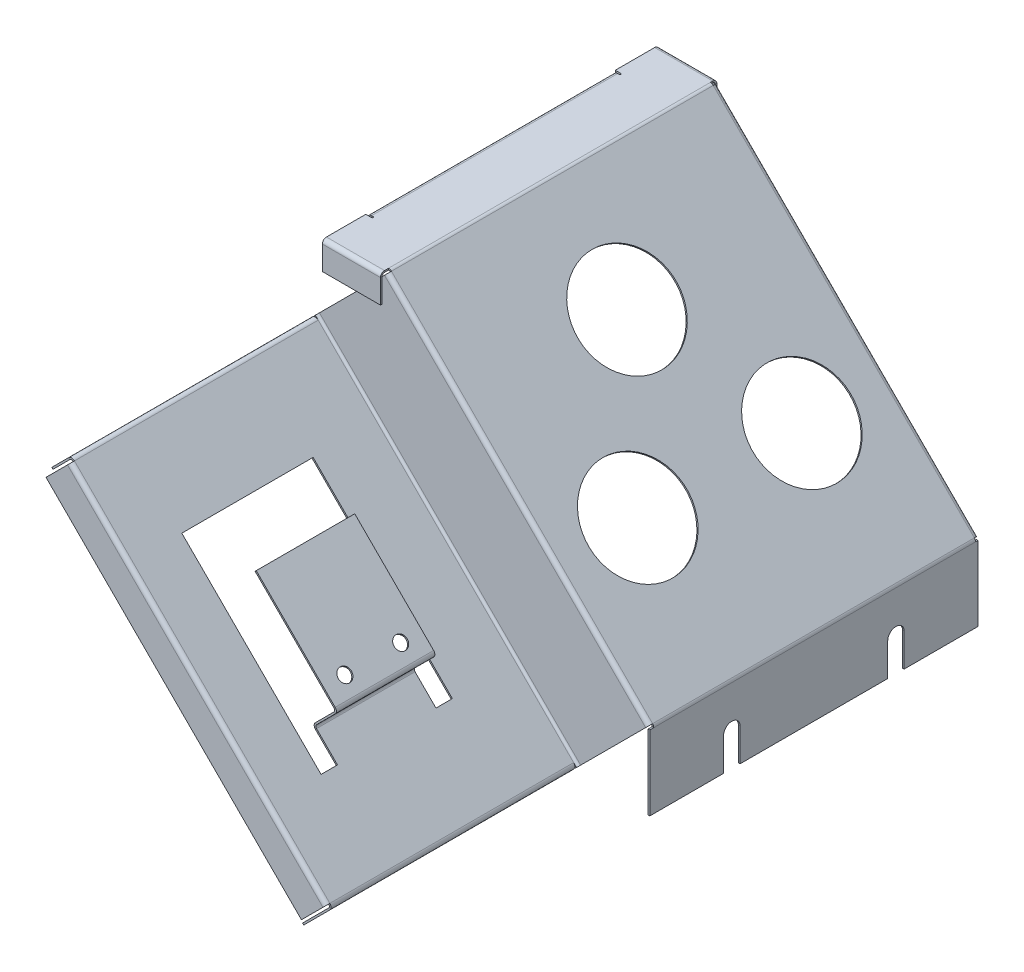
ISO-10303-21;
HEADER;
FILE_DESCRIPTION(('STEP AP214'),'2;1');
FILE_NAME('part.step','',(''),(''),'','','');
FILE_SCHEMA(('AUTOMOTIVE_DESIGN { 1 0 10303 214 1 1 1 1 }'));
ENDSEC;
DATA;
#1=APPLICATION_CONTEXT('core data for automotive mechanical design processes');
#2=APPLICATION_PROTOCOL_DEFINITION('international standard','automotive_design',2000,#1);
#3=PRODUCT_CONTEXT('',#1,'mechanical');
#4=PRODUCT('Part','Part','',(#3));
#5=PRODUCT_RELATED_PRODUCT_CATEGORY('part','',(#4));
#6=PRODUCT_DEFINITION_FORMATION('','',#4);
#7=PRODUCT_DEFINITION_CONTEXT('part definition',#1,'design');
#8=PRODUCT_DEFINITION('design','',#6,#7);
#9=PRODUCT_DEFINITION_SHAPE('','',#8);
#10=(LENGTH_UNIT() NAMED_UNIT(*) SI_UNIT(.MILLI.,.METRE.));
#11=(NAMED_UNIT(*) PLANE_ANGLE_UNIT() SI_UNIT($,.RADIAN.));
#12=(NAMED_UNIT(*) SI_UNIT($,.STERADIAN.) SOLID_ANGLE_UNIT());
#13=UNCERTAINTY_MEASURE_WITH_UNIT(LENGTH_MEASURE(1.E-05),#10,'distance_accuracy_value','');
#14=(GEOMETRIC_REPRESENTATION_CONTEXT(3) GLOBAL_UNCERTAINTY_ASSIGNED_CONTEXT((#13)) GLOBAL_UNIT_ASSIGNED_CONTEXT((#10,
#11,#12)) REPRESENTATION_CONTEXT('',''));
#15=CARTESIAN_POINT('',(0.,0.,0.));
#16=DIRECTION('',(0.,0.,1.));
#17=DIRECTION('',(1.,0.,0.));
#18=AXIS2_PLACEMENT_3D('',#15,#16,#17);
#19=CARTESIAN_POINT('',(-21.4289485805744,2.00254170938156,125.));
#20=DIRECTION('',(-0.707106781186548,-0.707106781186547,0.));
#21=DIRECTION('',(0.707106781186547,-0.707106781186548,0.));
#22=AXIS2_PLACEMENT_3D('',#19,#20,#21);
#23=PLANE('',#22);
#24=DIRECTION('',(0.707106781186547,-0.707106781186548,0.));
#25=VECTOR('',#24,1.);
#26=CARTESIAN_POINT('',(-21.4289485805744,2.00254170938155,50.7366000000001));
#27=LINE('',#26,#25);
#28=CARTESIAN_POINT('',(-100.123050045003,80.6966431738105,50.7366000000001));
#29=VERTEX_POINT('',#28);
#30=CARTESIAN_POINT('',(-22.3033568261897,2.87694995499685,50.7366000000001));
#31=VERTEX_POINT('',#30);
#32=EDGE_CURVE('E668',#29,#31,#27,.T.);
#33=ORIENTED_EDGE('',*,*,#32,.T.);
#34=DIRECTION('',(0.,0.,1.));
#35=VECTOR('',#34,1.);
#36=CARTESIAN_POINT('',(-22.3033568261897,2.87694995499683,125.));
#37=LINE('',#36,#35);
#38=CARTESIAN_POINT('',(-22.3033568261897,2.87694995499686,125.));
#39=VERTEX_POINT('',#38);
#40=EDGE_CURVE('E693',#39,#31,#37,.F.);
#41=ORIENTED_EDGE('',*,*,#40,.F.);
#42=DIRECTION('',(0.707106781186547,-0.707106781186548,0.));
#43=VECTOR('',#42,1.);
#44=CARTESIAN_POINT('',(-21.4289485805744,2.00254170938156,125.));
#45=LINE('',#44,#43);
#46=CARTESIAN_POINT('',(-100.123050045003,80.6966431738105,125.));
#47=VERTEX_POINT('',#46);
#48=EDGE_CURVE('E1307',#39,#47,#45,.F.);
#49=ORIENTED_EDGE('',*,*,#48,.T.);
#50=DIRECTION('',(0.,0.,-1.));
#51=VECTOR('',#50,1.);
#52=CARTESIAN_POINT('',(-100.123050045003,80.6966431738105,50.7366000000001));
#53=LINE('',#52,#51);
#54=EDGE_CURVE('E727',#29,#47,#53,.F.);
#55=ORIENTED_EDGE('',*,*,#54,.F.);
#56=EDGE_LOOP('',(#33,#41,#49,#55));
#57=FACE_BOUND('',#56,.T.);
#58=DIRECTION('',(-0.707106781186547,0.707106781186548,0.));
#59=VECTOR('',#58,1.);
#60=CARTESIAN_POINT('',(-39.9810263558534,20.5546194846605,105.));
#61=LINE('',#60,#59);
#62=CARTESIAN_POINT('',(-39.9810263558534,20.5546194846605,105.));
#63=VERTEX_POINT('',#62);
#64=CARTESIAN_POINT('',(-46.365335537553,26.9389286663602,105.));
#65=VERTEX_POINT('',#64);
#66=EDGE_CURVE('E1310',#63,#65,#61,.T.);
#67=ORIENTED_EDGE('',*,*,#66,.T.);
#68=DIRECTION('',(0.,0.,-1.));
#69=VECTOR('',#68,1.);
#70=CARTESIAN_POINT('',(-46.365335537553,26.9389286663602,125.));
#71=LINE('',#70,#69);
#72=CARTESIAN_POINT('',(-46.3653355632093,26.9389286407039,75.0000000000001));
#73=VERTEX_POINT('',#72);
#74=EDGE_CURVE('E1405',#65,#73,#71,.T.);
#75=ORIENTED_EDGE('',*,*,#74,.T.);
#76=DIRECTION('',(0.707106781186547,-0.707106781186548,0.));
#77=VECTOR('',#76,1.);
#78=CARTESIAN_POINT('',(-71.800831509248,52.3744246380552,75.0000000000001));
#79=LINE('',#78,#77);
#80=CARTESIAN_POINT('',(-39.9810263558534,20.5546194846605,75.0000000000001));
#81=VERTEX_POINT('',#80);
#82=EDGE_CURVE('E1431',#73,#81,#79,.T.);
#83=ORIENTED_EDGE('',*,*,#82,.T.);
#84=DIRECTION('',(0.,0.,-1.));
#85=VECTOR('',#84,1.);
#86=CARTESIAN_POINT('',(-39.9810263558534,20.5546194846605,75.0000000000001));
#87=LINE('',#86,#85);
#88=CARTESIAN_POINT('',(-39.9810263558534,20.5546194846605,70.0000000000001));
#89=VERTEX_POINT('',#88);
#90=EDGE_CURVE('E1428',#81,#89,#87,.T.);
#91=ORIENTED_EDGE('',*,*,#90,.T.);
#92=DIRECTION('',(-0.707106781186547,0.707106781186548,0.));
#93=VECTOR('',#92,1.);
#94=CARTESIAN_POINT('',(-39.9810263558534,20.5546194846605,70.0000000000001));
#95=LINE('',#94,#93);
#96=CARTESIAN_POINT('',(-82.4074332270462,62.9810263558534,70.0000000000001));
#97=VERTEX_POINT('',#96);
#98=EDGE_CURVE('E1425',#89,#97,#95,.T.);
#99=ORIENTED_EDGE('',*,*,#98,.T.);
#100=DIRECTION('',(0.,0.,1.));
#101=VECTOR('',#100,1.);
#102=CARTESIAN_POINT('',(-82.4074332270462,62.9810263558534,110.));
#103=LINE('',#102,#101);
#104=CARTESIAN_POINT('',(-82.4074332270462,62.9810263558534,110.));
#105=VERTEX_POINT('',#104);
#106=EDGE_CURVE('E1421',#97,#105,#103,.T.);
#107=ORIENTED_EDGE('',*,*,#106,.T.);
#108=DIRECTION('',(0.707106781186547,-0.707106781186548,0.));
#109=VECTOR('',#108,1.);
#110=CARTESIAN_POINT('',(-39.9810263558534,20.5546194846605,110.));
#111=LINE('',#110,#109);
#112=CARTESIAN_POINT('',(-39.9810263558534,20.5546194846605,110.));
#113=VERTEX_POINT('',#112);
#114=EDGE_CURVE('E1424',#105,#113,#111,.T.);
#115=ORIENTED_EDGE('',*,*,#114,.T.);
#116=DIRECTION('',(0.,0.,-1.));
#117=VECTOR('',#116,1.);
#118=CARTESIAN_POINT('',(-39.9810263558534,20.5546194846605,110.));
#119=LINE('',#118,#117);
#120=EDGE_CURVE('E705',#113,#63,#119,.T.);
#121=ORIENTED_EDGE('',*,*,#120,.T.);
#122=EDGE_LOOP('',(#67,#75,#83,#91,#99,#107,#115,#121));
#123=FACE_BOUND('',#122,.T.);
#124=ADVANCED_FACE('F34',(#57,#123),#23,.T.);
#125=CARTESIAN_POINT('',(-21.0753951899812,2.35609509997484,125.));
#126=DIRECTION('',(-0.707106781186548,-0.707106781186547,0.));
#127=DIRECTION('',(0.707106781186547,-0.707106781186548,0.));
#128=AXIS2_PLACEMENT_3D('',#125,#126,#127);
#129=PLANE('',#128);
#130=DIRECTION('',(0.,0.,-1.));
#131=VECTOR('',#130,1.);
#132=CARTESIAN_POINT('',(-46.0117821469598,27.2924820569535,125.));
#133=LINE('',#132,#131);
#134=CARTESIAN_POINT('',(-46.0117821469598,27.2924820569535,105.));
#135=VERTEX_POINT('',#134);
#136=CARTESIAN_POINT('',(-46.0117821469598,27.2924820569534,75.0000000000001));
#137=VERTEX_POINT('',#136);
#138=EDGE_CURVE('E1450',#135,#137,#133,.T.);
#139=ORIENTED_EDGE('',*,*,#138,.F.);
#140=DIRECTION('',(-0.707106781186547,0.707106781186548,0.));
#141=VECTOR('',#140,1.);
#142=CARTESIAN_POINT('',(-39.6274729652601,20.9081728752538,105.));
#143=LINE('',#142,#141);
#144=CARTESIAN_POINT('',(-39.6274729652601,20.9081728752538,105.));
#145=VERTEX_POINT('',#144);
#146=EDGE_CURVE('E689',#145,#135,#143,.T.);
#147=ORIENTED_EDGE('',*,*,#146,.F.);
#148=DIRECTION('',(0.,0.,-1.));
#149=VECTOR('',#148,1.);
#150=CARTESIAN_POINT('',(-39.6274729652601,20.9081728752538,110.));
#151=LINE('',#150,#149);
#152=CARTESIAN_POINT('',(-39.6274729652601,20.9081728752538,110.));
#153=VERTEX_POINT('',#152);
#154=EDGE_CURVE('E1406',#153,#145,#151,.T.);
#155=ORIENTED_EDGE('',*,*,#154,.F.);
#156=DIRECTION('',(0.707106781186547,-0.707106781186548,0.));
#157=VECTOR('',#156,1.);
#158=CARTESIAN_POINT('',(-39.6274729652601,20.9081728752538,110.));
#159=LINE('',#158,#157);
#160=CARTESIAN_POINT('',(-82.0538798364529,63.3345797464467,110.));
#161=VERTEX_POINT('',#160);
#162=EDGE_CURVE('E1401',#161,#153,#159,.T.);
#163=ORIENTED_EDGE('',*,*,#162,.F.);
#164=DIRECTION('',(0.,0.,1.));
#165=VECTOR('',#164,1.);
#166=CARTESIAN_POINT('',(-82.0538798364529,63.3345797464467,110.));
#167=LINE('',#166,#165);
#168=CARTESIAN_POINT('',(-82.0538798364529,63.3345797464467,70.0000000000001));
#169=VERTEX_POINT('',#168);
#170=EDGE_CURVE('E1418',#169,#161,#167,.T.);
#171=ORIENTED_EDGE('',*,*,#170,.F.);
#172=DIRECTION('',(-0.707106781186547,0.707106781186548,0.));
#173=VECTOR('',#172,1.);
#174=CARTESIAN_POINT('',(-39.6274729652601,20.9081728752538,70.0000000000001));
#175=LINE('',#174,#173);
#176=CARTESIAN_POINT('',(-39.6274729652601,20.9081728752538,70.0000000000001));
#177=VERTEX_POINT('',#176);
#178=EDGE_CURVE('E1415',#177,#169,#175,.T.);
#179=ORIENTED_EDGE('',*,*,#178,.F.);
#180=DIRECTION('',(0.,0.,-1.));
#181=VECTOR('',#180,1.);
#182=CARTESIAN_POINT('',(-39.6274729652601,20.9081728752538,75.0000000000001));
#183=LINE('',#182,#181);
#184=CARTESIAN_POINT('',(-39.6274729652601,20.9081728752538,75.0000000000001));
#185=VERTEX_POINT('',#184);
#186=EDGE_CURVE('E1412',#185,#177,#183,.T.);
#187=ORIENTED_EDGE('',*,*,#186,.F.);
#188=DIRECTION('',(0.707106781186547,-0.707106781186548,0.));
#189=VECTOR('',#188,1.);
#190=CARTESIAN_POINT('',(-71.4472781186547,52.7279780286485,75.0000000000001));
#191=LINE('',#190,#189);
#192=EDGE_CURVE('E730',#137,#185,#191,.T.);
#193=ORIENTED_EDGE('',*,*,#192,.F.);
#194=EDGE_LOOP('',(#139,#147,#155,#163,#171,#179,#187,#193));
#195=FACE_BOUND('',#194,.T.);
#196=DIRECTION('',(0.,0.,1.));
#197=VECTOR('',#196,1.);
#198=CARTESIAN_POINT('',(-21.9498034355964,3.2305033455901,125.));
#199=LINE('',#198,#197);
#200=CARTESIAN_POINT('',(-21.9498034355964,3.2305033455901,125.));
#201=VERTEX_POINT('',#200);
#202=CARTESIAN_POINT('',(-21.9498034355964,3.23050334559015,50.7366000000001));
#203=VERTEX_POINT('',#202);
#204=EDGE_CURVE('E701',#201,#203,#199,.F.);
#205=ORIENTED_EDGE('',*,*,#204,.T.);
#206=DIRECTION('',(-0.707106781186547,0.707106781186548,0.));
#207=VECTOR('',#206,1.);
#208=CARTESIAN_POINT('',(-100.643904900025,81.924604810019,50.7366000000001));
#209=LINE('',#208,#207);
#210=CARTESIAN_POINT('',(-99.76949665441,81.0501965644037,50.7366000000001));
#211=VERTEX_POINT('',#210);
#212=EDGE_CURVE('E764',#211,#203,#209,.F.);
#213=ORIENTED_EDGE('',*,*,#212,.F.);
#214=DIRECTION('',(0.,0.,-1.));
#215=VECTOR('',#214,1.);
#216=CARTESIAN_POINT('',(-99.76949665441,81.0501965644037,50.7366000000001));
#217=LINE('',#216,#215);
#218=CARTESIAN_POINT('',(-99.76949665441,81.0501965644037,125.));
#219=VERTEX_POINT('',#218);
#220=EDGE_CURVE('E704',#211,#219,#217,.F.);
#221=ORIENTED_EDGE('',*,*,#220,.T.);
#222=DIRECTION('',(-0.707106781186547,0.707106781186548,0.));
#223=VECTOR('',#222,1.);
#224=CARTESIAN_POINT('',(-100.643904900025,81.924604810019,125.));
#225=LINE('',#224,#223);
#226=EDGE_CURVE('E672',#201,#219,#225,.T.);
#227=ORIENTED_EDGE('',*,*,#226,.F.);
#228=EDGE_LOOP('',(#205,#213,#221,#227));
#229=FACE_BOUND('',#228,.T.);
#230=ADVANCED_FACE('F1525',(#195,#229),#129,.F.);
#231=CARTESIAN_POINT('',(-71.800831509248,52.3744246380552,75.0000000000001));
#232=DIRECTION('',(0.,0.,1.));
#233=DIRECTION('',(0.,-1.,0.));
#234=AXIS2_PLACEMENT_3D('',#231,#232,#233);
#235=PLANE('',#234);
#236=DIRECTION('',(-0.707106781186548,-0.707106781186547,0.));
#237=VECTOR('',#236,1.);
#238=CARTESIAN_POINT('',(-46.365335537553,26.9389286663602,75.0000000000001));
#239=LINE('',#238,#237);
#240=EDGE_CURVE('E1453',#137,#73,#239,.T.);
#241=ORIENTED_EDGE('',*,*,#240,.F.);
#242=ORIENTED_EDGE('',*,*,#192,.T.);
#243=DIRECTION('',(0.707106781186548,0.707106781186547,0.));
#244=VECTOR('',#243,1.);
#245=CARTESIAN_POINT('',(-39.9810263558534,20.5546194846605,75.0000000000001));
#246=LINE('',#245,#244);
#247=EDGE_CURVE('E1409',#81,#185,#246,.T.);
#248=ORIENTED_EDGE('',*,*,#247,.F.);
#249=ORIENTED_EDGE('',*,*,#82,.F.);
#250=EDGE_LOOP('',(#241,#242,#248,#249));
#251=FACE_BOUND('',#250,.T.);
#252=ADVANCED_FACE('F1531',(#251),#235,.F.);
#253=CARTESIAN_POINT('',(-39.9810263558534,20.5546194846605,105.));
#254=DIRECTION('',(0.,0.,-1.));
#255=DIRECTION('',(-1.,0.,0.));
#256=AXIS2_PLACEMENT_3D('',#253,#254,#255);
#257=PLANE('',#256);
#258=DIRECTION('',(0.707106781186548,0.707106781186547,0.));
#259=VECTOR('',#258,1.);
#260=CARTESIAN_POINT('',(-46.365335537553,26.9389286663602,105.));
#261=LINE('',#260,#259);
#262=EDGE_CURVE('E1447',#65,#135,#261,.T.);
#263=ORIENTED_EDGE('',*,*,#262,.F.);
#264=ORIENTED_EDGE('',*,*,#66,.F.);
#265=DIRECTION('',(0.707106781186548,0.707106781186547,0.));
#266=VECTOR('',#265,1.);
#267=CARTESIAN_POINT('',(-39.9810263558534,20.5546194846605,105.));
#268=LINE('',#267,#266);
#269=EDGE_CURVE('E1407',#63,#145,#268,.T.);
#270=ORIENTED_EDGE('',*,*,#269,.T.);
#271=ORIENTED_EDGE('',*,*,#146,.T.);
#272=EDGE_LOOP('',(#263,#264,#270,#271));
#273=FACE_BOUND('',#272,.T.);
#274=ADVANCED_FACE('F1538',(#273),#257,.F.);
#275=CARTESIAN_POINT('',(-22.8242116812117,2.35609509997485,125.));
#276=DIRECTION('',(0.707106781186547,-0.707106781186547,0.));
#277=DIRECTION('',(0.707106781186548,0.707106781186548,0.));
#278=AXIS2_PLACEMENT_3D('',#275,#276,#277);
#279=PLANE('',#278);
#280=DIRECTION('',(0.,0.,1.));
#281=VECTOR('',#280,1.);
#282=CARTESIAN_POINT('',(-22.8242116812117,2.35609509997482,126.2366));
#283=LINE('',#282,#281);
#284=CARTESIAN_POINT('',(-22.8242116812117,2.35609509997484,125.7366));
#285=VERTEX_POINT('',#284);
#286=CARTESIAN_POINT('',(-22.8242116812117,2.35609509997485,126.2366));
#287=VERTEX_POINT('',#286);
#288=EDGE_CURVE('E1374',#285,#287,#283,.T.);
#289=ORIENTED_EDGE('',*,*,#288,.F.);
#290=CARTESIAN_POINT('',(-22.8242116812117,2.35609509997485,125.));
#291=DIRECTION('',(-0.707106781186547,0.707106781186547,0.));
#292=DIRECTION('',(-0.707106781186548,-0.707106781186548,0.));
#293=AXIS2_PLACEMENT_3D('',#290,#291,#292);
#294=CIRCLE('',#293,0.736600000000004);
#295=EDGE_CURVE('E683',#39,#285,#294,.F.);
#296=ORIENTED_EDGE('',*,*,#295,.F.);
#297=DIRECTION('',(0.707106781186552,0.707106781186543,0.));
#298=VECTOR('',#297,1.);
#299=CARTESIAN_POINT('',(-22.3033568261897,2.87694995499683,125.));
#300=LINE('',#299,#298);
#301=EDGE_CURVE('E677',#39,#201,#300,.T.);
#302=ORIENTED_EDGE('',*,*,#301,.T.);
#303=CARTESIAN_POINT('',(-22.8242116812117,2.35609509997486,125.));
#304=DIRECTION('',(-0.707106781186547,0.707106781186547,0.));
#305=DIRECTION('',(-0.707106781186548,-0.707106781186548,0.));
#306=AXIS2_PLACEMENT_3D('',#303,#304,#305);
#307=CIRCLE('',#306,1.2366);
#308=EDGE_CURVE('E674',#201,#287,#307,.F.);
#309=ORIENTED_EDGE('',*,*,#308,.T.);
#310=EDGE_LOOP('',(#289,#296,#302,#309));
#311=FACE_BOUND('',#310,.T.);
#312=ADVANCED_FACE('F1616',(#311),#279,.T.);
#313=CARTESIAN_POINT('',(-100.643904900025,80.1757883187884,125.));
#314=DIRECTION('',(0.707106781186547,-0.707106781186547,0.));
#315=DIRECTION('',(0.707106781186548,0.707106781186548,0.));
#316=AXIS2_PLACEMENT_3D('',#313,#314,#315);
#317=PLANE('',#316);
#318=CARTESIAN_POINT('',(-100.643904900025,80.1757883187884,125.));
#319=DIRECTION('',(-0.707106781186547,0.707106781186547,0.));
#320=DIRECTION('',(-0.707106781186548,-0.707106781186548,0.));
#321=AXIS2_PLACEMENT_3D('',#318,#319,#320);
#322=CIRCLE('',#321,0.736600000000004);
#323=CARTESIAN_POINT('',(-100.643904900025,80.1757883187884,125.7366));
#324=VERTEX_POINT('',#323);
#325=EDGE_CURVE('E678',#324,#47,#322,.T.);
#326=ORIENTED_EDGE('',*,*,#325,.F.);
#327=DIRECTION('',(0.,0.,1.));
#328=VECTOR('',#327,1.);
#329=CARTESIAN_POINT('',(-100.643904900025,80.1757883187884,125.7366));
#330=LINE('',#329,#328);
#331=CARTESIAN_POINT('',(-100.643904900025,80.1757883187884,126.2366));
#332=VERTEX_POINT('',#331);
#333=EDGE_CURVE('E673',#324,#332,#330,.T.);
#334=ORIENTED_EDGE('',*,*,#333,.T.);
#335=CARTESIAN_POINT('',(-100.643904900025,80.1757883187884,125.));
#336=DIRECTION('',(-0.707106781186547,0.707106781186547,0.));
#337=DIRECTION('',(-0.707106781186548,-0.707106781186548,0.));
#338=AXIS2_PLACEMENT_3D('',#335,#336,#337);
#339=CIRCLE('',#338,1.2366);
#340=EDGE_CURVE('E669',#332,#219,#339,.T.);
#341=ORIENTED_EDGE('',*,*,#340,.T.);
#342=DIRECTION('',(0.707106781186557,0.707106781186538,0.));
#343=VECTOR('',#342,1.);
#344=CARTESIAN_POINT('',(-100.123050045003,80.6966431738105,125.));
#345=LINE('',#344,#343);
#346=EDGE_CURVE('E716',#47,#219,#345,.T.);
#347=ORIENTED_EDGE('',*,*,#346,.F.);
#348=EDGE_LOOP('',(#326,#334,#341,#347));
#349=FACE_BOUND('',#348,.T.);
#350=ADVANCED_FACE('F1620',(#349),#317,.F.);
#351=CARTESIAN_POINT('',(-100.643904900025,80.1757883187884,125.));
#352=DIRECTION('',(-0.707106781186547,0.707106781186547,0.));
#353=DIRECTION('',(0.,0.,1.));
#354=AXIS2_PLACEMENT_3D('',#351,#352,#353);
#355=CYLINDRICAL_SURFACE('',#354,1.2366);
#356=ORIENTED_EDGE('',*,*,#226,.T.);
#357=ORIENTED_EDGE('',*,*,#340,.F.);
#358=DIRECTION('',(-0.707106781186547,0.707106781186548,0.));
#359=VECTOR('',#358,1.);
#360=CARTESIAN_POINT('',(-22.8242116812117,2.35609509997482,126.2366));
#361=LINE('',#360,#359);
#362=EDGE_CURVE('E686',#332,#287,#361,.F.);
#363=ORIENTED_EDGE('',*,*,#362,.T.);
#364=ORIENTED_EDGE('',*,*,#308,.F.);
#365=EDGE_LOOP('',(#356,#357,#363,#364));
#366=FACE_BOUND('',#365,.T.);
#367=ADVANCED_FACE('F1623',(#366),#355,.T.);
#368=CARTESIAN_POINT('',(-100.643904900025,80.1757883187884,125.));
#369=DIRECTION('',(-0.707106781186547,0.707106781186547,0.));
#370=DIRECTION('',(0.,0.,1.));
#371=AXIS2_PLACEMENT_3D('',#368,#369,#370);
#372=CYLINDRICAL_SURFACE('',#371,0.736600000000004);
#373=ORIENTED_EDGE('',*,*,#48,.F.);
#374=ORIENTED_EDGE('',*,*,#295,.T.);
#375=DIRECTION('',(-0.707106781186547,0.707106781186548,0.));
#376=VECTOR('',#375,1.);
#377=CARTESIAN_POINT('',(-22.8242116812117,2.35609509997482,125.7366));
#378=LINE('',#377,#376);
#379=EDGE_CURVE('E682',#285,#324,#378,.T.);
#380=ORIENTED_EDGE('',*,*,#379,.T.);
#381=ORIENTED_EDGE('',*,*,#325,.T.);
#382=EDGE_LOOP('',(#373,#374,#380,#381));
#383=FACE_BOUND('',#382,.T.);
#384=ADVANCED_FACE('F1629',(#383),#372,.F.);
#385=CARTESIAN_POINT('',(-22.8242116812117,2.35609509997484,50.7366000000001));
#386=DIRECTION('',(0.,0.,-1.));
#387=DIRECTION('',(0.,1.,0.));
#388=AXIS2_PLACEMENT_3D('',#385,#386,#387);
#389=PLANE('',#388);
#390=CARTESIAN_POINT('',(-22.8242116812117,2.35609509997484,50.7366000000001));
#391=DIRECTION('',(0.,0.,1.));
#392=DIRECTION('',(0.,-1.,0.));
#393=AXIS2_PLACEMENT_3D('',#390,#391,#392);
#394=CIRCLE('',#393,0.736599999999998);
#395=CARTESIAN_POINT('',(-22.3033568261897,1.83524024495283,50.7366000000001));
#396=VERTEX_POINT('',#395);
#397=EDGE_CURVE('E713',#31,#396,#394,.F.);
#398=ORIENTED_EDGE('',*,*,#397,.F.);
#399=DIRECTION('',(0.707106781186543,-0.707106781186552,0.));
#400=VECTOR('',#399,1.);
#401=CARTESIAN_POINT('',(-22.3033568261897,2.87694995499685,50.7366000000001));
#402=LINE('',#401,#400);
#403=CARTESIAN_POINT('',(-21.6010036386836,2.17459676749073,50.7366000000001));
#404=VERTEX_POINT('',#403);
#405=EDGE_CURVE('E681',#31,#404,#402,.T.);
#406=ORIENTED_EDGE('',*,*,#405,.T.);
#407=CARTESIAN_POINT('',(-22.8242116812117,2.35609509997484,50.7366000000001));
#408=DIRECTION('',(0.,0.,1.));
#409=DIRECTION('',(0.,-1.,0.));
#410=AXIS2_PLACEMENT_3D('',#407,#408,#409);
#411=CIRCLE('',#410,1.2366);
#412=CARTESIAN_POINT('',(-21.9498034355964,1.48168685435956,50.7366000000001));
#413=VERTEX_POINT('',#412);
#414=EDGE_CURVE('E700',#404,#413,#411,.F.);
#415=ORIENTED_EDGE('',*,*,#414,.T.);
#416=DIRECTION('',(0.70710678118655,-0.707106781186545,0.));
#417=VECTOR('',#416,1.);
#418=CARTESIAN_POINT('',(-21.9498034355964,1.48168685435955,50.7366000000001));
#419=LINE('',#418,#417);
#420=EDGE_CURVE('E1343',#396,#413,#419,.T.);
#421=ORIENTED_EDGE('',*,*,#420,.F.);
#422=EDGE_LOOP('',(#398,#406,#415,#421));
#423=FACE_BOUND('',#422,.T.);
#424=ADVANCED_FACE('F1636',(#423),#389,.T.);
#425=CARTESIAN_POINT('',(-22.8242116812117,2.35609509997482,125.));
#426=DIRECTION('',(0.,0.,-1.));
#427=DIRECTION('',(0.,1.,0.));
#428=AXIS2_PLACEMENT_3D('',#425,#426,#427);
#429=PLANE('',#428);
#430=CARTESIAN_POINT('',(-22.8242116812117,2.35609509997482,125.));
#431=DIRECTION('',(0.,0.,1.));
#432=DIRECTION('',(0.,-1.,0.));
#433=AXIS2_PLACEMENT_3D('',#430,#431,#432);
#434=CIRCLE('',#433,0.736599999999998);
#435=CARTESIAN_POINT('',(-22.3033568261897,1.83524024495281,125.));
#436=VERTEX_POINT('',#435);
#437=EDGE_CURVE('E706',#436,#39,#434,.T.);
#438=ORIENTED_EDGE('',*,*,#437,.F.);
#439=DIRECTION('',(0.70710678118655,-0.707106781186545,0.));
#440=VECTOR('',#439,1.);
#441=CARTESIAN_POINT('',(-22.3033568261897,1.83524024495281,125.));
#442=LINE('',#441,#440);
#443=CARTESIAN_POINT('',(-21.9498034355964,1.48168685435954,125.));
#444=VERTEX_POINT('',#443);
#445=EDGE_CURVE('E694',#436,#444,#442,.T.);
#446=ORIENTED_EDGE('',*,*,#445,.T.);
#447=CARTESIAN_POINT('',(-22.8242116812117,2.35609509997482,125.));
#448=DIRECTION('',(0.,0.,1.));
#449=DIRECTION('',(0.,-1.,0.));
#450=AXIS2_PLACEMENT_3D('',#447,#448,#449);
#451=CIRCLE('',#450,1.2366);
#452=EDGE_CURVE('E690',#444,#201,#451,.T.);
#453=ORIENTED_EDGE('',*,*,#452,.T.);
#454=ORIENTED_EDGE('',*,*,#301,.F.);
#455=EDGE_LOOP('',(#438,#446,#453,#454));
#456=FACE_BOUND('',#455,.T.);
#457=ADVANCED_FACE('F1640',(#456),#429,.F.);
#458=CARTESIAN_POINT('',(-22.8242116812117,2.35609509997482,125.));
#459=DIRECTION('',(0.,0.,1.));
#460=DIRECTION('',(0.70710678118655,-0.707106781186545,0.));
#461=AXIS2_PLACEMENT_3D('',#458,#459,#460);
#462=CYLINDRICAL_SURFACE('',#461,1.2366);
#463=ORIENTED_EDGE('',*,*,#204,.F.);
#464=ORIENTED_EDGE('',*,*,#452,.F.);
#465=DIRECTION('',(0.,0.,1.));
#466=VECTOR('',#465,1.);
#467=CARTESIAN_POINT('',(-21.9498034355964,1.48168685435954,125.));
#468=LINE('',#467,#466);
#469=EDGE_CURVE('E1351',#413,#444,#468,.T.);
#470=ORIENTED_EDGE('',*,*,#469,.F.);
#471=ORIENTED_EDGE('',*,*,#414,.F.);
#472=EDGE_CURVE('E695',#203,#404,#411,.F.);
#473=ORIENTED_EDGE('',*,*,#472,.F.);
#474=EDGE_LOOP('',(#463,#464,#470,#471,#473));
#475=FACE_BOUND('',#474,.T.);
#476=ADVANCED_FACE('F1643',(#475),#462,.T.);
#477=CARTESIAN_POINT('',(-22.8242116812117,2.35609509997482,125.));
#478=DIRECTION('',(0.,0.,1.));
#479=DIRECTION('',(0.70710678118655,-0.707106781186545,0.));
#480=AXIS2_PLACEMENT_3D('',#477,#478,#479);
#481=CYLINDRICAL_SURFACE('',#480,0.736599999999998);
#482=ORIENTED_EDGE('',*,*,#40,.T.);
#483=ORIENTED_EDGE('',*,*,#397,.T.);
#484=DIRECTION('',(0.,0.,-1.));
#485=VECTOR('',#484,1.);
#486=CARTESIAN_POINT('',(-22.3033568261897,1.83524024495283,50.7366000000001));
#487=LINE('',#486,#485);
#488=EDGE_CURVE('E710',#396,#436,#487,.F.);
#489=ORIENTED_EDGE('',*,*,#488,.T.);
#490=ORIENTED_EDGE('',*,*,#437,.T.);
#491=EDGE_LOOP('',(#482,#483,#489,#490));
#492=FACE_BOUND('',#491,.T.);
#493=ADVANCED_FACE('F1645',(#492),#481,.F.);
#494=CARTESIAN_POINT('',(-100.643904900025,80.1757883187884,50.7366000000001));
#495=DIRECTION('',(0.,0.,1.));
#496=DIRECTION('',(1.,0.,0.));
#497=AXIS2_PLACEMENT_3D('',#494,#495,#496);
#498=PLANE('',#497);
#499=CARTESIAN_POINT('',(-100.643904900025,80.1757883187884,50.7366000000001));
#500=DIRECTION('',(0.,0.,-1.));
#501=DIRECTION('',(-1.,0.,0.));
#502=AXIS2_PLACEMENT_3D('',#499,#500,#501);
#503=CIRCLE('',#502,1.23660000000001);
#504=CARTESIAN_POINT('',(-101.518313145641,81.0501965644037,50.7366000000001));
#505=VERTEX_POINT('',#504);
#506=CARTESIAN_POINT('',(-100.825403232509,81.3989963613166,50.7366000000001));
#507=VERTEX_POINT('',#506);
#508=EDGE_CURVE('E709',#505,#507,#503,.T.);
#509=ORIENTED_EDGE('',*,*,#508,.T.);
#510=EDGE_CURVE('E723',#507,#29,#27,.T.);
#511=ORIENTED_EDGE('',*,*,#510,.T.);
#512=CARTESIAN_POINT('',(-100.643904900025,80.1757883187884,50.7366000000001));
#513=DIRECTION('',(0.,0.,-1.));
#514=DIRECTION('',(-1.,0.,0.));
#515=AXIS2_PLACEMENT_3D('',#512,#513,#514);
#516=CIRCLE('',#515,0.736600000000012);
#517=CARTESIAN_POINT('',(-101.164759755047,80.6966431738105,50.7366000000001));
#518=VERTEX_POINT('',#517);
#519=EDGE_CURVE('E731',#518,#29,#516,.T.);
#520=ORIENTED_EDGE('',*,*,#519,.F.);
#521=DIRECTION('',(-0.707106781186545,0.70710678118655,0.));
#522=VECTOR('',#521,1.);
#523=CARTESIAN_POINT('',(-101.164759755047,80.6966431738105,50.7366000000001));
#524=LINE('',#523,#522);
#525=EDGE_CURVE('E720',#518,#505,#524,.T.);
#526=ORIENTED_EDGE('',*,*,#525,.T.);
#527=EDGE_LOOP('',(#509,#511,#520,#526));
#528=FACE_BOUND('',#527,.T.);
#529=ADVANCED_FACE('F1654',(#528),#498,.F.);
#530=CARTESIAN_POINT('',(-100.643904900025,80.1757883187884,125.));
#531=DIRECTION('',(0.,0.,1.));
#532=DIRECTION('',(1.,0.,0.));
#533=AXIS2_PLACEMENT_3D('',#530,#531,#532);
#534=PLANE('',#533);
#535=DIRECTION('',(-0.707106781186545,0.70710678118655,0.));
#536=VECTOR('',#535,1.);
#537=CARTESIAN_POINT('',(-101.518313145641,81.0501965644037,125.));
#538=LINE('',#537,#536);
#539=CARTESIAN_POINT('',(-101.164759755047,80.6966431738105,125.));
#540=VERTEX_POINT('',#539);
#541=CARTESIAN_POINT('',(-101.518313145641,81.0501965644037,125.));
#542=VERTEX_POINT('',#541);
#543=EDGE_CURVE('E1311',#540,#542,#538,.T.);
#544=ORIENTED_EDGE('',*,*,#543,.F.);
#545=CARTESIAN_POINT('',(-100.643904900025,80.1757883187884,125.));
#546=DIRECTION('',(0.,0.,-1.));
#547=DIRECTION('',(-1.,0.,0.));
#548=AXIS2_PLACEMENT_3D('',#545,#546,#547);
#549=CIRCLE('',#548,0.736600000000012);
#550=EDGE_CURVE('E738',#47,#540,#549,.F.);
#551=ORIENTED_EDGE('',*,*,#550,.F.);
#552=ORIENTED_EDGE('',*,*,#346,.T.);
#553=CARTESIAN_POINT('',(-100.643904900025,80.1757883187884,125.));
#554=DIRECTION('',(0.,0.,-1.));
#555=DIRECTION('',(-1.,0.,0.));
#556=AXIS2_PLACEMENT_3D('',#553,#554,#555);
#557=CIRCLE('',#556,1.23660000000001);
#558=EDGE_CURVE('E719',#219,#542,#557,.F.);
#559=ORIENTED_EDGE('',*,*,#558,.T.);
#560=EDGE_LOOP('',(#544,#551,#552,#559));
#561=FACE_BOUND('',#560,.T.);
#562=ADVANCED_FACE('F1658',(#561),#534,.T.);
#563=CARTESIAN_POINT('',(-100.643904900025,80.1757883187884,50.7366000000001));
#564=DIRECTION('',(0.,0.,-1.));
#565=DIRECTION('',(-0.707106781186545,0.70710678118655,0.));
#566=AXIS2_PLACEMENT_3D('',#563,#564,#565);
#567=CYLINDRICAL_SURFACE('',#566,1.23660000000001);
#568=ORIENTED_EDGE('',*,*,#220,.F.);
#569=EDGE_CURVE('E724',#507,#211,#503,.T.);
#570=ORIENTED_EDGE('',*,*,#569,.F.);
#571=ORIENTED_EDGE('',*,*,#508,.F.);
#572=DIRECTION('',(0.,0.,-1.));
#573=VECTOR('',#572,1.);
#574=CARTESIAN_POINT('',(-101.518313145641,81.0501965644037,50.7366000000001));
#575=LINE('',#574,#573);
#576=EDGE_CURVE('E1318',#542,#505,#575,.T.);
#577=ORIENTED_EDGE('',*,*,#576,.F.);
#578=ORIENTED_EDGE('',*,*,#558,.F.);
#579=EDGE_LOOP('',(#568,#570,#571,#577,#578));
#580=FACE_BOUND('',#579,.T.);
#581=ADVANCED_FACE('F1662',(#580),#567,.T.);
#582=CARTESIAN_POINT('',(-100.643904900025,80.1757883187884,50.7366000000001));
#583=DIRECTION('',(0.,0.,-1.));
#584=DIRECTION('',(-0.707106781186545,0.70710678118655,0.));
#585=AXIS2_PLACEMENT_3D('',#582,#583,#584);
#586=CYLINDRICAL_SURFACE('',#585,0.736600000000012);
#587=ORIENTED_EDGE('',*,*,#54,.T.);
#588=ORIENTED_EDGE('',*,*,#550,.T.);
#589=DIRECTION('',(0.,0.,1.));
#590=VECTOR('',#589,1.);
#591=CARTESIAN_POINT('',(-101.164759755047,80.6966431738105,125.));
#592=LINE('',#591,#590);
#593=EDGE_CURVE('E735',#540,#518,#592,.F.);
#594=ORIENTED_EDGE('',*,*,#593,.T.);
#595=ORIENTED_EDGE('',*,*,#519,.T.);
#596=EDGE_LOOP('',(#587,#588,#594,#595));
#597=FACE_BOUND('',#596,.T.);
#598=ADVANCED_FACE('F1666',(#597),#586,.F.);
#599=CARTESIAN_POINT('',(-100.123050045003,82.445459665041,50.7366000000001));
#600=DIRECTION('',(-0.707106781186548,0.707106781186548,0.));
#601=DIRECTION('',(-0.707106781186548,-0.707106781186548,0.));
#602=AXIS2_PLACEMENT_3D('',#599,#600,#601);
#603=PLANE('',#602);
#604=DIRECTION('',(0.707106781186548,0.707106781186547,0.));
#605=VECTOR('',#604,1.);
#606=CARTESIAN_POINT('',(-100.997458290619,81.5710514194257,50.7366000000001));
#607=LINE('',#606,#605);
#608=CARTESIAN_POINT('',(-100.643904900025,81.924604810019,50.7366000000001));
#609=VERTEX_POINT('',#608);
#610=CARTESIAN_POINT('',(-100.997458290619,81.5710514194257,50.7366000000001));
#611=VERTEX_POINT('',#610);
#612=EDGE_CURVE('E1296',#609,#611,#607,.F.);
#613=ORIENTED_EDGE('',*,*,#612,.F.);
#614=CARTESIAN_POINT('',(-100.123050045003,82.445459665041,50.7366000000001));
#615=DIRECTION('',(0.707106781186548,-0.707106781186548,0.));
#616=DIRECTION('',(0.707106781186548,0.707106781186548,0.));
#617=AXIS2_PLACEMENT_3D('',#614,#615,#616);
#618=CIRCLE('',#617,0.736599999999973);
#619=CARTESIAN_POINT('',(-100.123050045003,82.445459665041,50.0000000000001));
#620=VERTEX_POINT('',#619);
#621=EDGE_CURVE('E766',#620,#609,#618,.F.);
#622=ORIENTED_EDGE('',*,*,#621,.F.);
#623=DIRECTION('',(0.,0.,-1.));
#624=VECTOR('',#623,1.);
#625=CARTESIAN_POINT('',(-100.123050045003,82.445459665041,50.0000000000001));
#626=LINE('',#625,#624);
#627=CARTESIAN_POINT('',(-100.123050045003,82.445459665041,49.5000000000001));
#628=VERTEX_POINT('',#627);
#629=EDGE_CURVE('E734',#620,#628,#626,.T.);
#630=ORIENTED_EDGE('',*,*,#629,.T.);
#631=CARTESIAN_POINT('',(-100.123050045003,82.445459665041,50.7366000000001));
#632=DIRECTION('',(0.707106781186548,-0.707106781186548,0.));
#633=DIRECTION('',(0.707106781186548,0.707106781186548,0.));
#634=AXIS2_PLACEMENT_3D('',#631,#632,#633);
#635=CIRCLE('',#634,1.23659999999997);
#636=EDGE_CURVE('E748',#628,#611,#635,.F.);
#637=ORIENTED_EDGE('',*,*,#636,.T.);
#638=EDGE_LOOP('',(#613,#622,#630,#637));
#639=FACE_BOUND('',#638,.T.);
#640=ADVANCED_FACE('F1670',(#639),#603,.T.);
#641=CARTESIAN_POINT('',(-20.5545403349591,2.87694995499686,50.7366000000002));
#642=DIRECTION('',(-0.707106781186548,0.707106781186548,0.));
#643=DIRECTION('',(-0.707106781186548,-0.707106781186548,0.));
#644=AXIS2_PLACEMENT_3D('',#641,#642,#643);
#645=PLANE('',#644);
#646=CARTESIAN_POINT('',(-20.5545403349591,2.87694995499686,50.7366000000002));
#647=DIRECTION('',(0.707106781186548,-0.707106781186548,0.));
#648=DIRECTION('',(0.707106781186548,0.707106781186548,0.));
#649=AXIS2_PLACEMENT_3D('',#646,#647,#648);
#650=CIRCLE('',#649,0.736599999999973);
#651=CARTESIAN_POINT('',(-21.0753951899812,2.35609509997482,50.7366000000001));
#652=VERTEX_POINT('',#651);
#653=CARTESIAN_POINT('',(-20.5545403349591,2.87694995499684,50.0000000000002));
#654=VERTEX_POINT('',#653);
#655=EDGE_CURVE('E761',#652,#654,#650,.T.);
#656=ORIENTED_EDGE('',*,*,#655,.F.);
#657=DIRECTION('',(0.707106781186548,0.707106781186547,0.));
#658=VECTOR('',#657,1.);
#659=CARTESIAN_POINT('',(-21.0753951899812,2.35609509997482,50.7366000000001));
#660=LINE('',#659,#658);
#661=CARTESIAN_POINT('',(-21.4289485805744,2.00254170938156,50.7366000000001));
#662=VERTEX_POINT('',#661);
#663=EDGE_CURVE('E753',#652,#662,#660,.F.);
#664=ORIENTED_EDGE('',*,*,#663,.T.);
#665=CARTESIAN_POINT('',(-20.5545403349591,2.87694995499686,50.7366000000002));
#666=DIRECTION('',(0.707106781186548,-0.707106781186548,0.));
#667=DIRECTION('',(0.707106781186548,0.707106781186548,0.));
#668=AXIS2_PLACEMENT_3D('',#665,#666,#667);
#669=CIRCLE('',#668,1.23659999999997);
#670=CARTESIAN_POINT('',(-20.5545403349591,2.87694995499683,49.5000000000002));
#671=VERTEX_POINT('',#670);
#672=EDGE_CURVE('E749',#662,#671,#669,.T.);
#673=ORIENTED_EDGE('',*,*,#672,.T.);
#674=DIRECTION('',(0.,0.,-1.));
#675=VECTOR('',#674,1.);
#676=CARTESIAN_POINT('',(-20.5545403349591,2.87694995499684,50.0000000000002));
#677=LINE('',#676,#675);
#678=EDGE_CURVE('E741',#654,#671,#677,.T.);
#679=ORIENTED_EDGE('',*,*,#678,.F.);
#680=EDGE_LOOP('',(#656,#664,#673,#679));
#681=FACE_BOUND('',#680,.T.);
#682=ADVANCED_FACE('F1672',(#681),#645,.F.);
#683=CARTESIAN_POINT('',(-20.5545403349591,2.87694995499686,50.7366000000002));
#684=DIRECTION('',(0.707106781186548,-0.707106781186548,0.));
#685=DIRECTION('',(-0.707106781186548,-0.707106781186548,0.));
#686=AXIS2_PLACEMENT_3D('',#683,#684,#685);
#687=CYLINDRICAL_SURFACE('',#686,1.23659999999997);
#688=DIRECTION('',(0.707106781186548,-0.707106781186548,0.));
#689=VECTOR('',#688,1.);
#690=CARTESIAN_POINT('',(-20.5545403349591,2.87694995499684,49.5000000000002));
#691=LINE('',#690,#689);
#692=EDGE_CURVE('E756',#671,#628,#691,.F.);
#693=ORIENTED_EDGE('',*,*,#692,.F.);
#694=ORIENTED_EDGE('',*,*,#672,.F.);
#695=EDGE_CURVE('E698',#404,#662,#402,.T.);
#696=ORIENTED_EDGE('',*,*,#695,.F.);
#697=ORIENTED_EDGE('',*,*,#405,.F.);
#698=ORIENTED_EDGE('',*,*,#32,.F.);
#699=ORIENTED_EDGE('',*,*,#510,.F.);
#700=EDGE_CURVE('E1291',#611,#507,#27,.T.);
#701=ORIENTED_EDGE('',*,*,#700,.F.);
#702=ORIENTED_EDGE('',*,*,#636,.F.);
#703=EDGE_LOOP('',(#693,#694,#696,#697,#698,#699,#701,#702));
#704=FACE_BOUND('',#703,.T.);
#705=ADVANCED_FACE('F1675',(#704),#687,.T.);
#706=CARTESIAN_POINT('',(-20.5545403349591,2.87694995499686,50.7366000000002));
#707=DIRECTION('',(0.707106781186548,-0.707106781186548,0.));
#708=DIRECTION('',(-0.707106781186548,-0.707106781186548,0.));
#709=AXIS2_PLACEMENT_3D('',#706,#707,#708);
#710=CYLINDRICAL_SURFACE('',#709,0.736599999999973);
#711=DIRECTION('',(0.707106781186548,-0.707106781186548,0.));
#712=VECTOR('',#711,1.);
#713=CARTESIAN_POINT('',(-20.5545403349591,2.87694995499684,50.0000000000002));
#714=LINE('',#713,#712);
#715=EDGE_CURVE('E752',#654,#620,#714,.F.);
#716=ORIENTED_EDGE('',*,*,#715,.T.);
#717=ORIENTED_EDGE('',*,*,#621,.T.);
#718=EDGE_CURVE('E769',#609,#211,#209,.F.);
#719=ORIENTED_EDGE('',*,*,#718,.T.);
#720=ORIENTED_EDGE('',*,*,#212,.T.);
#721=DIRECTION('',(0.707106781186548,-0.707106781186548,0.));
#722=VECTOR('',#721,1.);
#723=CARTESIAN_POINT('',(-21.0753951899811,2.35609509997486,50.7366000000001));
#724=LINE('',#723,#722);
#725=EDGE_CURVE('E699',#652,#203,#724,.F.);
#726=ORIENTED_EDGE('',*,*,#725,.F.);
#727=ORIENTED_EDGE('',*,*,#655,.T.);
#728=EDGE_LOOP('',(#716,#717,#719,#720,#726,#727));
#729=FACE_BOUND('',#728,.T.);
#730=ADVANCED_FACE('F1677',(#729),#710,.F.);
#731=CARTESIAN_POINT('',(-21.4289485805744,2.00254170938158,50.0000000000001));
#732=DIRECTION('',(0.707106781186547,-0.707106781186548,0.));
#733=DIRECTION('',(0.707106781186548,0.707106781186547,0.));
#734=AXIS2_PLACEMENT_3D('',#731,#732,#733);
#735=PLANE('',#734);
#736=DIRECTION('',(0.707106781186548,0.707106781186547,0.));
#737=VECTOR('',#736,1.);
#738=CARTESIAN_POINT('',(-21.4289485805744,2.00254170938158,50.0000000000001));
#739=LINE('',#738,#737);
#740=CARTESIAN_POINT('',(-0.736600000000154,22.6948902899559,50.));
#741=VERTEX_POINT('',#740);
#742=EDGE_CURVE('E745',#741,#654,#739,.F.);
#743=ORIENTED_EDGE('',*,*,#742,.T.);
#744=ORIENTED_EDGE('',*,*,#678,.T.);
#745=DIRECTION('',(-0.707106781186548,-0.707106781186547,0.));
#746=VECTOR('',#745,1.);
#747=CARTESIAN_POINT('',(-0.215745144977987,23.215745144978,49.5));
#748=LINE('',#747,#746);
#749=CARTESIAN_POINT('',(-0.736600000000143,22.6948902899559,49.5));
#750=VERTEX_POINT('',#749);
#751=EDGE_CURVE('E760',#750,#671,#748,.T.);
#752=ORIENTED_EDGE('',*,*,#751,.F.);
#753=DIRECTION('',(0.,0.,1.));
#754=VECTOR('',#753,1.);
#755=CARTESIAN_POINT('',(-0.736599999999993,22.694890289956,50.0000000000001));
#756=LINE('',#755,#754);
#757=EDGE_CURVE('E744',#750,#741,#756,.T.);
#758=ORIENTED_EDGE('',*,*,#757,.T.);
#759=EDGE_LOOP('',(#743,#744,#752,#758));
#760=FACE_BOUND('',#759,.T.);
#761=ADVANCED_FACE('F1686',(#760),#735,.T.);
#762=CARTESIAN_POINT('',(-0.215745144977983,23.215745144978,50.));
#763=DIRECTION('',(0.,0.,-1.));
#764=DIRECTION('',(-1.,0.,0.));
#765=AXIS2_PLACEMENT_3D('',#762,#763,#764);
#766=PLANE('',#765);
#767=ORIENTED_EDGE('',*,*,#715,.F.);
#768=ORIENTED_EDGE('',*,*,#742,.F.);
#769=DIRECTION('',(-0.707106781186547,0.707106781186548,0.));
#770=VECTOR('',#769,1.);
#771=CARTESIAN_POINT('',(-0.736599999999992,22.694890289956,50.));
#772=LINE('',#771,#770);
#773=CARTESIAN_POINT('',(-80.305109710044,102.2634,50.));
#774=VERTEX_POINT('',#773);
#775=EDGE_CURVE('E867',#774,#741,#772,.F.);
#776=ORIENTED_EDGE('',*,*,#775,.F.);
#777=DIRECTION('',(-0.70710678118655,-0.707106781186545,0.));
#778=VECTOR('',#777,1.);
#779=CARTESIAN_POINT('',(-79.784254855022,102.784254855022,50.));
#780=LINE('',#779,#778);
#781=EDGE_CURVE('E1067',#620,#774,#780,.F.);
#782=ORIENTED_EDGE('',*,*,#781,.F.);
#783=EDGE_LOOP('',(#767,#768,#776,#782));
#784=FACE_BOUND('',#783,.T.);
#785=ADVANCED_FACE('F1903',(#784),#766,.F.);
#786=CARTESIAN_POINT('',(-0.215745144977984,23.215745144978,49.5));
#787=DIRECTION('',(0.,0.,-1.));
#788=DIRECTION('',(-1.,0.,0.));
#789=AXIS2_PLACEMENT_3D('',#786,#787,#788);
#790=PLANE('',#789);
#791=ORIENTED_EDGE('',*,*,#751,.T.);
#792=ORIENTED_EDGE('',*,*,#692,.T.);
#793=DIRECTION('',(0.70710678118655,0.707106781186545,0.));
#794=VECTOR('',#793,1.);
#795=CARTESIAN_POINT('',(-79.7842548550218,102.784254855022,49.5));
#796=LINE('',#795,#794);
#797=CARTESIAN_POINT('',(-80.3051097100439,102.2634,49.5));
#798=VERTEX_POINT('',#797);
#799=EDGE_CURVE('E759',#628,#798,#796,.T.);
#800=ORIENTED_EDGE('',*,*,#799,.T.);
#801=DIRECTION('',(-0.707106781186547,0.707106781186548,0.));
#802=VECTOR('',#801,1.);
#803=CARTESIAN_POINT('',(-0.736599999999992,22.694890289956,49.5));
#804=LINE('',#803,#802);
#805=EDGE_CURVE('E878',#750,#798,#804,.T.);
#806=ORIENTED_EDGE('',*,*,#805,.F.);
#807=EDGE_LOOP('',(#791,#792,#800,#806));
#808=FACE_BOUND('',#807,.T.);
#809=ADVANCED_FACE('F1887',(#808),#790,.T.);
#810=CARTESIAN_POINT('',(-98.,103.,-37.5));
#811=DIRECTION('',(0.,0.,-1.));
#812=DIRECTION('',(-1.,0.,0.));
#813=AXIS2_PLACEMENT_3D('',#810,#811,#812);
#814=PLANE('',#813);
#815=DIRECTION('',(0.,-1.,0.));
#816=VECTOR('',#815,1.);
#817=CARTESIAN_POINT('',(-97.5,88.,-37.5));
#818=LINE('',#817,#816);
#819=CARTESIAN_POINT('',(-97.5,88.75,-37.5));
#820=VERTEX_POINT('',#819);
#821=CARTESIAN_POINT('',(-97.5,102.2634,-37.5));
#822=VERTEX_POINT('',#821);
#823=EDGE_CURVE('E1065',#820,#822,#818,.F.);
#824=ORIENTED_EDGE('',*,*,#823,.F.);
#825=DIRECTION('',(-1.,0.,0.));
#826=VECTOR('',#825,1.);
#827=CARTESIAN_POINT('',(-97.5000000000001,88.75,-37.5));
#828=LINE('',#827,#826);
#829=CARTESIAN_POINT('',(-98.0000000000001,88.75,-37.5));
#830=VERTEX_POINT('',#829);
#831=EDGE_CURVE('E1072',#820,#830,#828,.T.);
#832=ORIENTED_EDGE('',*,*,#831,.T.);
#833=DIRECTION('',(0.,1.,0.));
#834=VECTOR('',#833,1.);
#835=CARTESIAN_POINT('',(-98.,103.,-37.5));
#836=LINE('',#835,#834);
#837=CARTESIAN_POINT('',(-98.,102.2634,-37.5));
#838=VERTEX_POINT('',#837);
#839=EDGE_CURVE('E1070',#830,#838,#836,.T.);
#840=ORIENTED_EDGE('',*,*,#839,.T.);
#841=DIRECTION('',(-1.,0.,0.));
#842=VECTOR('',#841,1.);
#843=CARTESIAN_POINT('',(-97.5,102.2634,-37.5));
#844=LINE('',#843,#842);
#845=EDGE_CURVE('E911',#822,#838,#844,.T.);
#846=ORIENTED_EDGE('',*,*,#845,.F.);
#847=EDGE_LOOP('',(#824,#832,#840,#846));
#848=FACE_BOUND('',#847,.T.);
#849=ADVANCED_FACE('F1884',(#848),#814,.T.);
#850=CARTESIAN_POINT('',(0.5,0.,50.));
#851=DIRECTION('',(0.,-1.,0.));
#852=DIRECTION('',(0.,0.,-1.));
#853=AXIS2_PLACEMENT_3D('',#850,#851,#852);
#854=PLANE('',#853);
#855=DIRECTION('',(1.,0.,0.));
#856=VECTOR('',#855,1.);
#857=CARTESIAN_POINT('',(0.,0.,-27.5));
#858=LINE('',#857,#856);
#859=CARTESIAN_POINT('',(0.,0.,-27.5));
#860=VERTEX_POINT('',#859);
#861=CARTESIAN_POINT('',(0.5,0.,-27.5));
#862=VERTEX_POINT('',#861);
#863=EDGE_CURVE('E1212',#860,#862,#858,.T.);
#864=ORIENTED_EDGE('',*,*,#863,.F.);
#865=DIRECTION('',(0.,0.,-1.));
#866=VECTOR('',#865,1.);
#867=CARTESIAN_POINT('',(0.,0.,50.));
#868=LINE('',#867,#866);
#869=CARTESIAN_POINT('',(0.,0.,-50.));
#870=VERTEX_POINT('',#869);
#871=EDGE_CURVE('E964',#860,#870,#868,.T.);
#872=ORIENTED_EDGE('',*,*,#871,.T.);
#873=DIRECTION('',(-1.,0.,0.));
#874=VECTOR('',#873,1.);
#875=CARTESIAN_POINT('',(0.5,0.,-50.));
#876=LINE('',#875,#874);
#877=CARTESIAN_POINT('',(0.5,0.,-50.));
#878=VERTEX_POINT('',#877);
#879=EDGE_CURVE('E887',#878,#870,#876,.T.);
#880=ORIENTED_EDGE('',*,*,#879,.F.);
#881=DIRECTION('',(0.,0.,-1.));
#882=VECTOR('',#881,1.);
#883=CARTESIAN_POINT('',(0.5,0.,50.));
#884=LINE('',#883,#882);
#885=EDGE_CURVE('E971',#862,#878,#884,.T.);
#886=ORIENTED_EDGE('',*,*,#885,.F.);
#887=EDGE_LOOP('',(#864,#872,#880,#886));
#888=FACE_BOUND('',#887,.T.);
#889=ADVANCED_FACE('F1840',(#888),#854,.T.);
#890=DIRECTION('',(1.,0.,0.));
#891=VECTOR('',#890,1.);
#892=CARTESIAN_POINT('',(0.,0.,27.5));
#893=LINE('',#892,#891);
#894=CARTESIAN_POINT('',(0.,0.,27.5));
#895=VERTEX_POINT('',#894);
#896=CARTESIAN_POINT('',(0.5,0.,27.5));
#897=VERTEX_POINT('',#896);
#898=EDGE_CURVE('E988',#895,#897,#893,.T.);
#899=ORIENTED_EDGE('',*,*,#898,.T.);
#900=CARTESIAN_POINT('',(0.5,0.,50.));
#901=VERTEX_POINT('',#900);
#902=EDGE_CURVE('E966',#901,#897,#884,.T.);
#903=ORIENTED_EDGE('',*,*,#902,.F.);
#904=DIRECTION('',(-1.,0.,0.));
#905=VECTOR('',#904,1.);
#906=CARTESIAN_POINT('',(0.5,0.,50.));
#907=LINE('',#906,#905);
#908=CARTESIAN_POINT('',(0.,0.,50.));
#909=VERTEX_POINT('',#908);
#910=EDGE_CURVE('E963',#901,#909,#907,.T.);
#911=ORIENTED_EDGE('',*,*,#910,.T.);
#912=EDGE_CURVE('E779',#909,#895,#868,.T.);
#913=ORIENTED_EDGE('',*,*,#912,.T.);
#914=EDGE_LOOP('',(#899,#903,#911,#913));
#915=FACE_BOUND('',#914,.T.);
#916=ADVANCED_FACE('F1697',(#915),#854,.T.);
#917=CARTESIAN_POINT('',(-80.305109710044,102.2634,-49.2634));
#918=DIRECTION('',(-0.707106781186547,0.707106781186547,0.));
#919=DIRECTION('',(-0.707106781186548,-0.707106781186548,0.));
#920=AXIS2_PLACEMENT_3D('',#917,#918,#919);
#921=PLANE('',#920);
#922=DIRECTION('',(0.,0.,-1.));
#923=VECTOR('',#922,1.);
#924=CARTESIAN_POINT('',(-80.305109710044,102.2634,-50.));
#925=LINE('',#924,#923);
#926=CARTESIAN_POINT('',(-80.305109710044,102.2634,-50.));
#927=VERTEX_POINT('',#926);
#928=CARTESIAN_POINT('',(-80.305109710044,102.2634,-50.5));
#929=VERTEX_POINT('',#928);
#930=EDGE_CURVE('E1160',#927,#929,#925,.T.);
#931=ORIENTED_EDGE('',*,*,#930,.F.);
#932=CARTESIAN_POINT('',(-80.305109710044,102.2634,-49.2634));
#933=DIRECTION('',(0.707106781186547,-0.707106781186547,0.));
#934=DIRECTION('',(0.707106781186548,0.707106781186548,0.));
#935=AXIS2_PLACEMENT_3D('',#932,#933,#934);
#936=CIRCLE('',#935,0.736599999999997);
#937=CARTESIAN_POINT('',(-79.784254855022,102.784254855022,-49.2634));
#938=VERTEX_POINT('',#937);
#939=EDGE_CURVE('E798',#938,#927,#936,.F.);
#940=ORIENTED_EDGE('',*,*,#939,.F.);
#941=DIRECTION('',(0.707106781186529,0.707106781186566,0.));
#942=VECTOR('',#941,1.);
#943=CARTESIAN_POINT('',(-79.784254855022,102.784254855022,-49.2634));
#944=LINE('',#943,#942);
#945=CARTESIAN_POINT('',(-79.4307014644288,103.137808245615,-49.2634));
#946=VERTEX_POINT('',#945);
#947=EDGE_CURVE('E775',#938,#946,#944,.T.);
#948=ORIENTED_EDGE('',*,*,#947,.T.);
#949=CARTESIAN_POINT('',(-80.305109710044,102.2634,-49.2634));
#950=DIRECTION('',(0.707106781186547,-0.707106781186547,0.));
#951=DIRECTION('',(0.707106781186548,0.707106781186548,0.));
#952=AXIS2_PLACEMENT_3D('',#949,#950,#951);
#953=CIRCLE('',#952,1.2366);
#954=EDGE_CURVE('E778',#946,#929,#953,.F.);
#955=ORIENTED_EDGE('',*,*,#954,.T.);
#956=EDGE_LOOP('',(#931,#940,#948,#955));
#957=FACE_BOUND('',#956,.T.);
#958=ADVANCED_FACE('F1692',(#957),#921,.T.);
#959=CARTESIAN_POINT('',(-0.736599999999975,22.694890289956,-49.2634));
#960=DIRECTION('',(-0.707106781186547,0.707106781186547,0.));
#961=DIRECTION('',(-0.707106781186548,-0.707106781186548,0.));
#962=AXIS2_PLACEMENT_3D('',#959,#960,#961);
#963=PLANE('',#962);
#964=CARTESIAN_POINT('',(-0.736599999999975,22.694890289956,-49.2634));
#965=DIRECTION('',(0.707106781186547,-0.707106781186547,0.));
#966=DIRECTION('',(0.707106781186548,0.707106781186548,0.));
#967=AXIS2_PLACEMENT_3D('',#964,#965,#966);
#968=CIRCLE('',#967,0.736599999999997);
#969=CARTESIAN_POINT('',(-0.736599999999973,22.694890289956,-50.));
#970=VERTEX_POINT('',#969);
#971=CARTESIAN_POINT('',(-0.215745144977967,23.215745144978,-49.2634));
#972=VERTEX_POINT('',#971);
#973=EDGE_CURVE('E792',#970,#972,#968,.T.);
#974=ORIENTED_EDGE('',*,*,#973,.F.);
#975=DIRECTION('',(0.,0.,-1.));
#976=VECTOR('',#975,1.);
#977=CARTESIAN_POINT('',(-0.736599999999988,22.694890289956,-50.));
#978=LINE('',#977,#976);
#979=CARTESIAN_POINT('',(-0.736599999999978,22.694890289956,-50.5));
#980=VERTEX_POINT('',#979);
#981=EDGE_CURVE('E784',#970,#980,#978,.T.);
#982=ORIENTED_EDGE('',*,*,#981,.T.);
#983=CARTESIAN_POINT('',(-0.736599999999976,22.694890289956,-49.2634));
#984=DIRECTION('',(0.707106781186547,-0.707106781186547,0.));
#985=DIRECTION('',(0.707106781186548,0.707106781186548,0.));
#986=AXIS2_PLACEMENT_3D('',#983,#984,#985);
#987=CIRCLE('',#986,1.2366);
#988=CARTESIAN_POINT('',(0.137808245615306,23.5692985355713,-49.2634));
#989=VERTEX_POINT('',#988);
#990=EDGE_CURVE('E780',#980,#989,#987,.T.);
#991=ORIENTED_EDGE('',*,*,#990,.T.);
#992=DIRECTION('',(0.707106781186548,0.707106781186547,0.));
#993=VECTOR('',#992,1.);
#994=CARTESIAN_POINT('',(-0.215745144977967,23.215745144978,-49.2634));
#995=LINE('',#994,#993);
#996=EDGE_CURVE('E770',#972,#989,#995,.T.);
#997=ORIENTED_EDGE('',*,*,#996,.F.);
#998=EDGE_LOOP('',(#974,#982,#991,#997));
#999=FACE_BOUND('',#998,.T.);
#1000=ADVANCED_FACE('F1688',(#999),#963,.F.);
#1001=CARTESIAN_POINT('',(-0.736599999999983,22.694890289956,-49.2634));
#1002=DIRECTION('',(0.707106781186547,-0.707106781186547,0.));
#1003=DIRECTION('',(0.,0.,-1.));
#1004=AXIS2_PLACEMENT_3D('',#1001,#1002,#1003);
#1005=CYLINDRICAL_SURFACE('',#1004,1.2366);
#1006=DIRECTION('',(0.707106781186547,-0.707106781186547,0.));
#1007=VECTOR('',#1006,1.);
#1008=CARTESIAN_POINT('',(0.137808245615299,23.5692985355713,-49.2634));
#1009=LINE('',#1008,#1007);
#1010=EDGE_CURVE('E787',#989,#946,#1009,.F.);
#1011=ORIENTED_EDGE('',*,*,#1010,.F.);
#1012=ORIENTED_EDGE('',*,*,#990,.F.);
#1013=DIRECTION('',(0.707106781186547,-0.707106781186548,0.));
#1014=VECTOR('',#1013,1.);
#1015=CARTESIAN_POINT('',(-0.736599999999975,22.694890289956,-50.5));
#1016=LINE('',#1015,#1014);
#1017=EDGE_CURVE('E1152',#929,#980,#1016,.T.);
#1018=ORIENTED_EDGE('',*,*,#1017,.F.);
#1019=ORIENTED_EDGE('',*,*,#954,.F.);
#1020=EDGE_LOOP('',(#1011,#1012,#1018,#1019));
#1021=FACE_BOUND('',#1020,.T.);
#1022=ADVANCED_FACE('F1691',(#1021),#1005,.T.);
#1023=CARTESIAN_POINT('',(-0.736599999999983,22.694890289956,-49.2634));
#1024=DIRECTION('',(0.707106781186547,-0.707106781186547,0.));
#1025=DIRECTION('',(0.,0.,-1.));
#1026=AXIS2_PLACEMENT_3D('',#1023,#1024,#1025);
#1027=CYLINDRICAL_SURFACE('',#1026,0.736599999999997);
#1028=DIRECTION('',(0.707106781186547,-0.707106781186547,0.));
#1029=VECTOR('',#1028,1.);
#1030=CARTESIAN_POINT('',(-0.215745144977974,23.215745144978,-49.2634));
#1031=LINE('',#1030,#1029);
#1032=EDGE_CURVE('E783',#972,#938,#1031,.F.);
#1033=ORIENTED_EDGE('',*,*,#1032,.T.);
#1034=ORIENTED_EDGE('',*,*,#939,.T.);
#1035=DIRECTION('',(0.707106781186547,-0.707106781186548,0.));
#1036=VECTOR('',#1035,1.);
#1037=CARTESIAN_POINT('',(-80.305109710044,102.2634,-50.));
#1038=LINE('',#1037,#1036);
#1039=EDGE_CURVE('E796',#927,#970,#1038,.T.);
#1040=ORIENTED_EDGE('',*,*,#1039,.T.);
#1041=ORIENTED_EDGE('',*,*,#973,.T.);
#1042=EDGE_LOOP('',(#1033,#1034,#1040,#1041));
#1043=FACE_BOUND('',#1042,.T.);
#1044=ADVANCED_FACE('F1694',(#1043),#1027,.F.);
#1045=CARTESIAN_POINT('',(0.5,22.694890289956,-49.2634));
#1046=DIRECTION('',(0.,-1.,0.));
#1047=DIRECTION('',(0.,0.,-1.));
#1048=AXIS2_PLACEMENT_3D('',#1045,#1046,#1047);
#1049=PLANE('',#1048);
#1050=DIRECTION('',(-1.,0.,0.));
#1051=VECTOR('',#1050,1.);
#1052=CARTESIAN_POINT('',(0.5,22.694890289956,-49.2634));
#1053=LINE('',#1052,#1051);
#1054=CARTESIAN_POINT('',(0.5,22.694890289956,-49.2634));
#1055=VERTEX_POINT('',#1054);
#1056=CARTESIAN_POINT('',(0.,22.694890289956,-49.2634));
#1057=VERTEX_POINT('',#1056);
#1058=EDGE_CURVE('E774',#1055,#1057,#1053,.T.);
#1059=ORIENTED_EDGE('',*,*,#1058,.F.);
#1060=DIRECTION('',(0.,0.,-1.));
#1061=VECTOR('',#1060,1.);
#1062=CARTESIAN_POINT('',(0.5,22.694890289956,50.));
#1063=LINE('',#1062,#1061);
#1064=CARTESIAN_POINT('',(0.5,22.694890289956,-50.));
#1065=VERTEX_POINT('',#1064);
#1066=EDGE_CURVE('E795',#1055,#1065,#1063,.T.);
#1067=ORIENTED_EDGE('',*,*,#1066,.T.);
#1068=DIRECTION('',(1.,0.,0.));
#1069=VECTOR('',#1068,1.);
#1070=CARTESIAN_POINT('',(0.,22.694890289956,-50.));
#1071=LINE('',#1070,#1069);
#1072=CARTESIAN_POINT('',(0.,22.694890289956,-50.));
#1073=VERTEX_POINT('',#1072);
#1074=EDGE_CURVE('E930',#1073,#1065,#1071,.T.);
#1075=ORIENTED_EDGE('',*,*,#1074,.F.);
#1076=DIRECTION('',(0.,0.,-1.));
#1077=VECTOR('',#1076,1.);
#1078=CARTESIAN_POINT('',(0.,22.694890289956,50.));
#1079=LINE('',#1078,#1077);
#1080=EDGE_CURVE('E960',#1057,#1073,#1079,.T.);
#1081=ORIENTED_EDGE('',*,*,#1080,.F.);
#1082=EDGE_LOOP('',(#1059,#1067,#1075,#1081));
#1083=FACE_BOUND('',#1082,.T.);
#1084=ADVANCED_FACE('F1704',(#1083),#1049,.F.);
#1085=CARTESIAN_POINT('',(-0.7366,22.694890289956,50.));
#1086=DIRECTION('',(0.,0.,-1.));
#1087=DIRECTION('',(-1.,0.,0.));
#1088=AXIS2_PLACEMENT_3D('',#1085,#1086,#1087);
#1089=CYLINDRICAL_SURFACE('',#1088,0.7366);
#1090=DIRECTION('',(0.,0.,-1.));
#1091=VECTOR('',#1090,1.);
#1092=CARTESIAN_POINT('',(-0.215745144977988,23.215745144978,50.));
#1093=LINE('',#1092,#1091);
#1094=CARTESIAN_POINT('',(-0.215745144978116,23.2157451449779,48.7634));
#1095=VERTEX_POINT('',#1094);
#1096=EDGE_CURVE('E807',#1095,#972,#1093,.T.);
#1097=ORIENTED_EDGE('',*,*,#1096,.T.);
#1098=CARTESIAN_POINT('',(-0.7366,22.694890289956,-49.2634));
#1099=DIRECTION('',(0.,0.,-1.));
#1100=DIRECTION('',(-1.,0.,0.));
#1101=AXIS2_PLACEMENT_3D('',#1098,#1099,#1100);
#1102=CIRCLE('',#1101,0.7366);
#1103=EDGE_CURVE('E803',#972,#1057,#1102,.T.);
#1104=ORIENTED_EDGE('',*,*,#1103,.T.);
#1105=CARTESIAN_POINT('',(0.,22.694890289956,48.7634));
#1106=VERTEX_POINT('',#1105);
#1107=EDGE_CURVE('E958',#1106,#1057,#1079,.T.);
#1108=ORIENTED_EDGE('',*,*,#1107,.F.);
#1109=CARTESIAN_POINT('',(-0.7366,22.694890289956,48.7634));
#1110=DIRECTION('',(0.,0.,1.));
#1111=DIRECTION('',(1.,0.,0.));
#1112=AXIS2_PLACEMENT_3D('',#1109,#1110,#1111);
#1113=CIRCLE('',#1112,0.7366);
#1114=EDGE_CURVE('E806',#1106,#1095,#1113,.T.);
#1115=ORIENTED_EDGE('',*,*,#1114,.T.);
#1116=EDGE_LOOP('',(#1097,#1104,#1108,#1115));
#1117=FACE_BOUND('',#1116,.T.);
#1118=ADVANCED_FACE('F1708',(#1117),#1089,.F.);
#1119=CARTESIAN_POINT('',(-0.7366,22.694890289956,-49.2634));
#1120=DIRECTION('',(0.,0.,-1.));
#1121=DIRECTION('',(-1.,0.,0.));
#1122=AXIS2_PLACEMENT_3D('',#1119,#1120,#1121);
#1123=PLANE('',#1122);
#1124=CARTESIAN_POINT('',(-0.7366,22.694890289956,-49.2634));
#1125=DIRECTION('',(0.,0.,-1.));
#1126=DIRECTION('',(-1.,0.,0.));
#1127=AXIS2_PLACEMENT_3D('',#1124,#1125,#1126);
#1128=CIRCLE('',#1127,1.2366);
#1129=EDGE_CURVE('E802',#989,#1055,#1128,.T.);
#1130=ORIENTED_EDGE('',*,*,#1129,.T.);
#1131=ORIENTED_EDGE('',*,*,#1058,.T.);
#1132=ORIENTED_EDGE('',*,*,#1103,.F.);
#1133=ORIENTED_EDGE('',*,*,#996,.T.);
#1134=EDGE_LOOP('',(#1130,#1131,#1132,#1133));
#1135=FACE_BOUND('',#1134,.T.);
#1136=ADVANCED_FACE('F1710',(#1135),#1123,.T.);
#1137=CARTESIAN_POINT('',(-80.305109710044,103.,-49.2634));
#1138=DIRECTION('',(-1.,0.,0.));
#1139=DIRECTION('',(0.,0.,1.));
#1140=AXIS2_PLACEMENT_3D('',#1137,#1138,#1139);
#1141=PLANE('',#1140);
#1142=DIRECTION('',(0.,1.,0.));
#1143=VECTOR('',#1142,1.);
#1144=CARTESIAN_POINT('',(-80.305109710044,103.,-49.2634));
#1145=LINE('',#1144,#1143);
#1146=CARTESIAN_POINT('',(-80.305109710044,103.,-49.2634));
#1147=VERTEX_POINT('',#1146);
#1148=CARTESIAN_POINT('',(-80.305109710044,103.5,-49.2634));
#1149=VERTEX_POINT('',#1148);
#1150=EDGE_CURVE('E810',#1147,#1149,#1145,.T.);
#1151=ORIENTED_EDGE('',*,*,#1150,.F.);
#1152=DIRECTION('',(0.,0.,-1.));
#1153=VECTOR('',#1152,1.);
#1154=CARTESIAN_POINT('',(-80.305109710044,103.,50.));
#1155=LINE('',#1154,#1153);
#1156=CARTESIAN_POINT('',(-80.305109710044,103.,-50.));
#1157=VERTEX_POINT('',#1156);
#1158=EDGE_CURVE('E773',#1147,#1157,#1155,.T.);
#1159=ORIENTED_EDGE('',*,*,#1158,.T.);
#1160=DIRECTION('',(0.,-1.,0.));
#1161=VECTOR('',#1160,1.);
#1162=CARTESIAN_POINT('',(-80.305109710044,103.5,-50.));
#1163=LINE('',#1162,#1161);
#1164=CARTESIAN_POINT('',(-80.305109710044,103.5,-50.));
#1165=VERTEX_POINT('',#1164);
#1166=EDGE_CURVE('E825',#1165,#1157,#1163,.T.);
#1167=ORIENTED_EDGE('',*,*,#1166,.F.);
#1168=DIRECTION('',(0.,0.,-1.));
#1169=VECTOR('',#1168,1.);
#1170=CARTESIAN_POINT('',(-80.305109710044,103.5,50.));
#1171=LINE('',#1170,#1169);
#1172=EDGE_CURVE('E983',#1149,#1165,#1171,.T.);
#1173=ORIENTED_EDGE('',*,*,#1172,.F.);
#1174=EDGE_LOOP('',(#1151,#1159,#1167,#1173));
#1175=FACE_BOUND('',#1174,.T.);
#1176=ADVANCED_FACE('F1713',(#1175),#1141,.F.);
#1177=CARTESIAN_POINT('',(-80.305109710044,102.2634,50.));
#1178=DIRECTION('',(0.,0.,-1.));
#1179=DIRECTION('',(-1.,0.,0.));
#1180=AXIS2_PLACEMENT_3D('',#1177,#1178,#1179);
#1181=CYLINDRICAL_SURFACE('',#1180,0.7366);
#1182=CARTESIAN_POINT('',(-80.305109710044,103.,48.7634));
#1183=VERTEX_POINT('',#1182);
#1184=EDGE_CURVE('E821',#1183,#1147,#1155,.T.);
#1185=ORIENTED_EDGE('',*,*,#1184,.T.);
#1186=CARTESIAN_POINT('',(-80.305109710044,102.2634,-49.2634));
#1187=DIRECTION('',(0.,0.,-1.));
#1188=DIRECTION('',(-1.,0.,0.));
#1189=AXIS2_PLACEMENT_3D('',#1186,#1187,#1188);
#1190=CIRCLE('',#1189,0.7366);
#1191=EDGE_CURVE('E817',#1147,#938,#1190,.T.);
#1192=ORIENTED_EDGE('',*,*,#1191,.T.);
#1193=DIRECTION('',(0.,0.,-1.));
#1194=VECTOR('',#1193,1.);
#1195=CARTESIAN_POINT('',(-79.784254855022,102.784254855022,50.));
#1196=LINE('',#1195,#1194);
#1197=CARTESIAN_POINT('',(-79.7842548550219,102.784254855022,48.7634));
#1198=VERTEX_POINT('',#1197);
#1199=EDGE_CURVE('E791',#1198,#938,#1196,.T.);
#1200=ORIENTED_EDGE('',*,*,#1199,.F.);
#1201=CARTESIAN_POINT('',(-80.305109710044,102.2634,48.7634));
#1202=DIRECTION('',(0.,0.,1.));
#1203=DIRECTION('',(1.,0.,0.));
#1204=AXIS2_PLACEMENT_3D('',#1201,#1202,#1203);
#1205=CIRCLE('',#1204,0.7366);
#1206=EDGE_CURVE('E820',#1198,#1183,#1205,.T.);
#1207=ORIENTED_EDGE('',*,*,#1206,.T.);
#1208=EDGE_LOOP('',(#1185,#1192,#1200,#1207));
#1209=FACE_BOUND('',#1208,.T.);
#1210=ADVANCED_FACE('F1717',(#1209),#1181,.F.);
#1211=CARTESIAN_POINT('',(0.,23.,50.));
#1212=DIRECTION('',(-0.707106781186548,-0.707106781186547,0.));
#1213=DIRECTION('',(0.707106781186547,-0.707106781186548,0.));
#1214=AXIS2_PLACEMENT_3D('',#1211,#1212,#1213);
#1215=PLANE('',#1214);
#1216=CARTESIAN_POINT('',(-56.7842876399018,79.7842876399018,0.));
#1217=DIRECTION('',(0.707106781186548,0.707106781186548,0.));
#1218=DIRECTION('',(-0.707106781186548,0.707106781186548,0.));
#1219=AXIS2_PLACEMENT_3D('',#1216,#1217,#1218);
#1220=CIRCLE('',#1219,15.);
#1221=CARTESIAN_POINT('',(-67.3908893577,90.3908893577,0.));
#1222=VERTEX_POINT('',#1221);
#1223=EDGE_CURVE('E896',#1222,#1222,#1220,.T.);
#1224=ORIENTED_EDGE('',*,*,#1223,.T.);
#1225=EDGE_LOOP('',(#1224));
#1226=FACE_BOUND('',#1225,.T.);
#1227=CARTESIAN_POINT('',(-28.5000163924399,51.5000163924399,-25.));
#1228=DIRECTION('',(0.707106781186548,0.707106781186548,0.));
#1229=DIRECTION('',(0.707106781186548,-0.707106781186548,0.));
#1230=AXIS2_PLACEMENT_3D('',#1227,#1228,#1229);
#1231=CIRCLE('',#1230,15.);
#1232=CARTESIAN_POINT('',(-17.8934146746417,40.8934146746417,-25.));
#1233=VERTEX_POINT('',#1232);
#1234=EDGE_CURVE('E1230',#1233,#1233,#1231,.T.);
#1235=ORIENTED_EDGE('',*,*,#1234,.T.);
#1236=EDGE_LOOP('',(#1235));
#1237=FACE_BOUND('',#1236,.T.);
#1238=CARTESIAN_POINT('',(-28.5000163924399,51.5000163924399,25.));
#1239=DIRECTION('',(0.707106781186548,0.707106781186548,0.));
#1240=DIRECTION('',(-0.707106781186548,0.707106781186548,0.));
#1241=AXIS2_PLACEMENT_3D('',#1238,#1239,#1240);
#1242=CIRCLE('',#1241,15.);
#1243=CARTESIAN_POINT('',(-39.1066181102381,62.1066181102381,25.));
#1244=VERTEX_POINT('',#1243);
#1245=EDGE_CURVE('E952',#1244,#1244,#1242,.T.);
#1246=ORIENTED_EDGE('',*,*,#1245,.T.);
#1247=EDGE_LOOP('',(#1246));
#1248=FACE_BOUND('',#1247,.T.);
#1249=ORIENTED_EDGE('',*,*,#1199,.T.);
#1250=ORIENTED_EDGE('',*,*,#1032,.F.);
#1251=ORIENTED_EDGE('',*,*,#1096,.F.);
#1252=DIRECTION('',(-0.707106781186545,0.70710678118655,0.));
#1253=VECTOR('',#1252,1.);
#1254=CARTESIAN_POINT('',(-79.7842548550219,102.784254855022,48.7634));
#1255=LINE('',#1254,#1253);
#1256=EDGE_CURVE('E879',#1198,#1095,#1255,.F.);
#1257=ORIENTED_EDGE('',*,*,#1256,.F.);
#1258=EDGE_LOOP('',(#1249,#1250,#1251,#1257));
#1259=FACE_BOUND('',#1258,.T.);
#1260=ADVANCED_FACE('F1824',(#1226,#1237,#1248,#1259),#1215,.T.);
#1261=CARTESIAN_POINT('',(0.353553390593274,23.3535533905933,50.));
#1262=DIRECTION('',(-0.707106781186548,-0.707106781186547,0.));
#1263=DIRECTION('',(0.707106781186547,-0.707106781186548,0.));
#1264=AXIS2_PLACEMENT_3D('',#1261,#1262,#1263);
#1265=PLANE('',#1264);
#1266=CARTESIAN_POINT('',(-56.4307342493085,80.1378410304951,0.));
#1267=DIRECTION('',(0.707106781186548,0.707106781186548,0.));
#1268=DIRECTION('',(-0.707106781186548,0.707106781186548,0.));
#1269=AXIS2_PLACEMENT_3D('',#1266,#1267,#1268);
#1270=CIRCLE('',#1269,15.);
#1271=CARTESIAN_POINT('',(-67.0373359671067,90.7444427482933,0.));
#1272=VERTEX_POINT('',#1271);
#1273=EDGE_CURVE('E1238',#1272,#1272,#1270,.T.);
#1274=ORIENTED_EDGE('',*,*,#1273,.F.);
#1275=EDGE_LOOP('',(#1274));
#1276=FACE_BOUND('',#1275,.T.);
#1277=CARTESIAN_POINT('',(-28.1464630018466,51.8535697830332,-25.));
#1278=DIRECTION('',(0.707106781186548,0.707106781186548,0.));
#1279=DIRECTION('',(0.707106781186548,-0.707106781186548,0.));
#1280=AXIS2_PLACEMENT_3D('',#1277,#1278,#1279);
#1281=CIRCLE('',#1280,15.);
#1282=CARTESIAN_POINT('',(-17.5398612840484,41.246968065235,-25.));
#1283=VERTEX_POINT('',#1282);
#1284=EDGE_CURVE('E1233',#1283,#1283,#1281,.T.);
#1285=ORIENTED_EDGE('',*,*,#1284,.F.);
#1286=EDGE_LOOP('',(#1285));
#1287=FACE_BOUND('',#1286,.T.);
#1288=CARTESIAN_POINT('',(-28.1464630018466,51.8535697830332,25.));
#1289=DIRECTION('',(0.707106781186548,0.707106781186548,0.));
#1290=DIRECTION('',(-0.707106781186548,0.707106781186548,0.));
#1291=AXIS2_PLACEMENT_3D('',#1288,#1289,#1290);
#1292=CIRCLE('',#1291,15.);
#1293=CARTESIAN_POINT('',(-38.7530647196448,62.4601715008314,25.));
#1294=VERTEX_POINT('',#1293);
#1295=EDGE_CURVE('E1207',#1294,#1294,#1292,.T.);
#1296=ORIENTED_EDGE('',*,*,#1295,.F.);
#1297=EDGE_LOOP('',(#1296));
#1298=FACE_BOUND('',#1297,.T.);
#1299=ORIENTED_EDGE('',*,*,#1010,.T.);
#1300=DIRECTION('',(0.,0.,-1.));
#1301=VECTOR('',#1300,1.);
#1302=CARTESIAN_POINT('',(-79.4307014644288,103.137808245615,50.));
#1303=LINE('',#1302,#1301);
#1304=CARTESIAN_POINT('',(-79.4307014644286,103.137808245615,48.7634));
#1305=VERTEX_POINT('',#1304);
#1306=EDGE_CURVE('E977',#1305,#946,#1303,.T.);
#1307=ORIENTED_EDGE('',*,*,#1306,.F.);
#1308=DIRECTION('',(-0.707106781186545,0.70710678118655,0.));
#1309=VECTOR('',#1308,1.);
#1310=CARTESIAN_POINT('',(-79.4307014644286,103.137808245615,48.7634));
#1311=LINE('',#1310,#1309);
#1312=CARTESIAN_POINT('',(0.137808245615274,23.5692985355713,48.7634));
#1313=VERTEX_POINT('',#1312);
#1314=EDGE_CURVE('E790',#1305,#1313,#1311,.F.);
#1315=ORIENTED_EDGE('',*,*,#1314,.T.);
#1316=DIRECTION('',(0.,0.,-1.));
#1317=VECTOR('',#1316,1.);
#1318=CARTESIAN_POINT('',(0.137808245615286,23.5692985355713,50.));
#1319=LINE('',#1318,#1317);
#1320=EDGE_CURVE('E873',#1313,#989,#1319,.T.);
#1321=ORIENTED_EDGE('',*,*,#1320,.T.);
#1322=EDGE_LOOP('',(#1299,#1307,#1315,#1321));
#1323=FACE_BOUND('',#1322,.T.);
#1324=ADVANCED_FACE('F1734',(#1276,#1287,#1298,#1323),#1265,.F.);
#1325=CARTESIAN_POINT('',(-98.,102.2634,-50.));
#1326=DIRECTION('',(-1.,0.,0.));
#1327=DIRECTION('',(0.,0.,1.));
#1328=AXIS2_PLACEMENT_3D('',#1325,#1326,#1327);
#1329=PLANE('',#1328);
#1330=DIRECTION('',(0.,0.,-1.));
#1331=VECTOR('',#1330,1.);
#1332=CARTESIAN_POINT('',(-98.,102.2634,-51.2366));
#1333=LINE('',#1332,#1331);
#1334=CARTESIAN_POINT('',(-98.,102.2634,-50.7366));
#1335=VERTEX_POINT('',#1334);
#1336=CARTESIAN_POINT('',(-98.,102.2634,-51.2366));
#1337=VERTEX_POINT('',#1336);
#1338=EDGE_CURVE('E1119',#1335,#1337,#1333,.T.);
#1339=ORIENTED_EDGE('',*,*,#1338,.F.);
#1340=CARTESIAN_POINT('',(-98.,102.2634,-50.));
#1341=DIRECTION('',(1.,0.,0.));
#1342=DIRECTION('',(0.,0.,-1.));
#1343=AXIS2_PLACEMENT_3D('',#1340,#1341,#1342);
#1344=CIRCLE('',#1343,0.736599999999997);
#1345=CARTESIAN_POINT('',(-98.,103.,-50.));
#1346=VERTEX_POINT('',#1345);
#1347=EDGE_CURVE('E836',#1346,#1335,#1344,.F.);
#1348=ORIENTED_EDGE('',*,*,#1347,.F.);
#1349=DIRECTION('',(0.,1.,0.));
#1350=VECTOR('',#1349,1.);
#1351=CARTESIAN_POINT('',(-98.,103.,-50.));
#1352=LINE('',#1351,#1350);
#1353=CARTESIAN_POINT('',(-98.,103.5,-50.));
#1354=VERTEX_POINT('',#1353);
#1355=EDGE_CURVE('E830',#1346,#1354,#1352,.T.);
#1356=ORIENTED_EDGE('',*,*,#1355,.T.);
#1357=CARTESIAN_POINT('',(-98.,102.2634,-50.));
#1358=DIRECTION('',(1.,0.,0.));
#1359=DIRECTION('',(0.,0.,-1.));
#1360=AXIS2_PLACEMENT_3D('',#1357,#1358,#1359);
#1361=CIRCLE('',#1360,1.2366);
#1362=EDGE_CURVE('E827',#1354,#1337,#1361,.F.);
#1363=ORIENTED_EDGE('',*,*,#1362,.T.);
#1364=EDGE_LOOP('',(#1339,#1348,#1356,#1363));
#1365=FACE_BOUND('',#1364,.T.);
#1366=ADVANCED_FACE('F1729',(#1365),#1329,.T.);
#1367=CARTESIAN_POINT('',(-80.305109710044,102.2634,-50.));
#1368=DIRECTION('',(-1.,0.,0.));
#1369=DIRECTION('',(0.,0.,1.));
#1370=AXIS2_PLACEMENT_3D('',#1367,#1368,#1369);
#1371=PLANE('',#1370);
#1372=CARTESIAN_POINT('',(-80.305109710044,102.2634,-50.));
#1373=DIRECTION('',(1.,0.,0.));
#1374=DIRECTION('',(0.,0.,-1.));
#1375=AXIS2_PLACEMENT_3D('',#1372,#1373,#1374);
#1376=CIRCLE('',#1375,0.736599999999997);
#1377=CARTESIAN_POINT('',(-80.305109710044,102.2634,-50.7366));
#1378=VERTEX_POINT('',#1377);
#1379=EDGE_CURVE('E831',#1378,#1157,#1376,.T.);
#1380=ORIENTED_EDGE('',*,*,#1379,.F.);
#1381=DIRECTION('',(0.,0.,-1.));
#1382=VECTOR('',#1381,1.);
#1383=CARTESIAN_POINT('',(-80.305109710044,102.2634,-50.7366));
#1384=LINE('',#1383,#1382);
#1385=CARTESIAN_POINT('',(-80.305109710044,102.2634,-51.2366));
#1386=VERTEX_POINT('',#1385);
#1387=EDGE_CURVE('E826',#1378,#1386,#1384,.T.);
#1388=ORIENTED_EDGE('',*,*,#1387,.T.);
#1389=CARTESIAN_POINT('',(-80.305109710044,102.2634,-50.));
#1390=DIRECTION('',(1.,0.,0.));
#1391=DIRECTION('',(0.,0.,-1.));
#1392=AXIS2_PLACEMENT_3D('',#1389,#1390,#1391);
#1393=CIRCLE('',#1392,1.2366);
#1394=EDGE_CURVE('E822',#1386,#1165,#1393,.T.);
#1395=ORIENTED_EDGE('',*,*,#1394,.T.);
#1396=ORIENTED_EDGE('',*,*,#1166,.T.);
#1397=EDGE_LOOP('',(#1380,#1388,#1395,#1396));
#1398=FACE_BOUND('',#1397,.T.);
#1399=ADVANCED_FACE('F1725',(#1398),#1371,.F.);
#1400=CARTESIAN_POINT('',(-80.305109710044,102.2634,-50.));
#1401=DIRECTION('',(1.,0.,0.));
#1402=DIRECTION('',(0.,0.,-1.));
#1403=AXIS2_PLACEMENT_3D('',#1400,#1401,#1402);
#1404=CYLINDRICAL_SURFACE('',#1403,1.2366);
#1405=DIRECTION('',(-1.,0.,0.));
#1406=VECTOR('',#1405,1.);
#1407=CARTESIAN_POINT('',(-80.,103.5,-50.));
#1408=LINE('',#1407,#1406);
#1409=EDGE_CURVE('E1006',#1165,#1354,#1408,.T.);
#1410=ORIENTED_EDGE('',*,*,#1409,.F.);
#1411=ORIENTED_EDGE('',*,*,#1394,.F.);
#1412=DIRECTION('',(1.,0.,0.));
#1413=VECTOR('',#1412,1.);
#1414=CARTESIAN_POINT('',(-80.305109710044,102.2634,-51.2366));
#1415=LINE('',#1414,#1413);
#1416=EDGE_CURVE('E1126',#1337,#1386,#1415,.T.);
#1417=ORIENTED_EDGE('',*,*,#1416,.F.);
#1418=ORIENTED_EDGE('',*,*,#1362,.F.);
#1419=EDGE_LOOP('',(#1410,#1411,#1417,#1418));
#1420=FACE_BOUND('',#1419,.T.);
#1421=ADVANCED_FACE('F1728',(#1420),#1404,.T.);
#1422=CARTESIAN_POINT('',(-80.305109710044,102.2634,-50.));
#1423=DIRECTION('',(1.,0.,0.));
#1424=DIRECTION('',(0.,0.,-1.));
#1425=AXIS2_PLACEMENT_3D('',#1422,#1423,#1424);
#1426=CYLINDRICAL_SURFACE('',#1425,0.736599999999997);
#1427=DIRECTION('',(-1.,0.,0.));
#1428=VECTOR('',#1427,1.);
#1429=CARTESIAN_POINT('',(-80.,103.,-50.));
#1430=LINE('',#1429,#1428);
#1431=EDGE_CURVE('E839',#1157,#1346,#1430,.T.);
#1432=ORIENTED_EDGE('',*,*,#1431,.T.);
#1433=ORIENTED_EDGE('',*,*,#1347,.T.);
#1434=DIRECTION('',(-1.,0.,0.));
#1435=VECTOR('',#1434,1.);
#1436=CARTESIAN_POINT('',(-98.,102.2634,-50.7366));
#1437=LINE('',#1436,#1435);
#1438=EDGE_CURVE('E835',#1335,#1378,#1437,.F.);
#1439=ORIENTED_EDGE('',*,*,#1438,.T.);
#1440=ORIENTED_EDGE('',*,*,#1379,.T.);
#1441=EDGE_LOOP('',(#1432,#1433,#1439,#1440));
#1442=FACE_BOUND('',#1441,.T.);
#1443=ADVANCED_FACE('F1731',(#1442),#1426,.F.);
#1444=CARTESIAN_POINT('',(-80.305109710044,102.2634,50.));
#1445=DIRECTION('',(1.,0.,0.));
#1446=DIRECTION('',(0.,0.,-1.));
#1447=AXIS2_PLACEMENT_3D('',#1444,#1445,#1446);
#1448=PLANE('',#1447);
#1449=DIRECTION('',(0.,0.,1.));
#1450=VECTOR('',#1449,1.);
#1451=CARTESIAN_POINT('',(-80.305109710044,102.2634,51.2366));
#1452=LINE('',#1451,#1450);
#1453=CARTESIAN_POINT('',(-80.305109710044,102.2634,50.7366));
#1454=VERTEX_POINT('',#1453);
#1455=CARTESIAN_POINT('',(-80.305109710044,102.2634,51.2366));
#1456=VERTEX_POINT('',#1455);
#1457=EDGE_CURVE('E1089',#1454,#1456,#1452,.T.);
#1458=ORIENTED_EDGE('',*,*,#1457,.F.);
#1459=CARTESIAN_POINT('',(-80.305109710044,102.2634,50.));
#1460=DIRECTION('',(-1.,0.,0.));
#1461=DIRECTION('',(0.,0.,1.));
#1462=AXIS2_PLACEMENT_3D('',#1459,#1460,#1461);
#1463=CIRCLE('',#1462,0.736599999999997);
#1464=CARTESIAN_POINT('',(-80.305109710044,103.,50.));
#1465=VERTEX_POINT('',#1464);
#1466=EDGE_CURVE('E853',#1465,#1454,#1463,.F.);
#1467=ORIENTED_EDGE('',*,*,#1466,.F.);
#1468=DIRECTION('',(0.,1.,0.));
#1469=VECTOR('',#1468,1.);
#1470=CARTESIAN_POINT('',(-80.305109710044,103.,50.));
#1471=LINE('',#1470,#1469);
#1472=CARTESIAN_POINT('',(-80.305109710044,103.5,50.));
#1473=VERTEX_POINT('',#1472);
#1474=EDGE_CURVE('E834',#1465,#1473,#1471,.T.);
#1475=ORIENTED_EDGE('',*,*,#1474,.T.);
#1476=CARTESIAN_POINT('',(-80.305109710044,102.2634,50.));
#1477=DIRECTION('',(-1.,0.,0.));
#1478=DIRECTION('',(0.,0.,1.));
#1479=AXIS2_PLACEMENT_3D('',#1476,#1477,#1478);
#1480=CIRCLE('',#1479,1.2366);
#1481=EDGE_CURVE('E845',#1473,#1456,#1480,.F.);
#1482=ORIENTED_EDGE('',*,*,#1481,.T.);
#1483=EDGE_LOOP('',(#1458,#1467,#1475,#1482));
#1484=FACE_BOUND('',#1483,.T.);
#1485=ADVANCED_FACE('F1741',(#1484),#1448,.T.);
#1486=CARTESIAN_POINT('',(-98.,102.2634,50.));
#1487=DIRECTION('',(1.,0.,0.));
#1488=DIRECTION('',(0.,0.,-1.));
#1489=AXIS2_PLACEMENT_3D('',#1486,#1487,#1488);
#1490=PLANE('',#1489);
#1491=CARTESIAN_POINT('',(-98.,102.2634,50.));
#1492=DIRECTION('',(-1.,0.,0.));
#1493=DIRECTION('',(0.,0.,1.));
#1494=AXIS2_PLACEMENT_3D('',#1491,#1492,#1493);
#1495=CIRCLE('',#1494,0.736599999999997);
#1496=CARTESIAN_POINT('',(-98.,102.2634,50.7366));
#1497=VERTEX_POINT('',#1496);
#1498=CARTESIAN_POINT('',(-98.,103.,50.));
#1499=VERTEX_POINT('',#1498);
#1500=EDGE_CURVE('E848',#1497,#1499,#1495,.T.);
#1501=ORIENTED_EDGE('',*,*,#1500,.F.);
#1502=DIRECTION('',(0.,0.,1.));
#1503=VECTOR('',#1502,1.);
#1504=CARTESIAN_POINT('',(-98.,102.2634,50.7366));
#1505=LINE('',#1504,#1503);
#1506=CARTESIAN_POINT('',(-98.,102.2634,51.2366));
#1507=VERTEX_POINT('',#1506);
#1508=EDGE_CURVE('E844',#1497,#1507,#1505,.T.);
#1509=ORIENTED_EDGE('',*,*,#1508,.T.);
#1510=CARTESIAN_POINT('',(-98.,102.2634,50.));
#1511=DIRECTION('',(-1.,0.,0.));
#1512=DIRECTION('',(0.,0.,1.));
#1513=AXIS2_PLACEMENT_3D('',#1510,#1511,#1512);
#1514=CIRCLE('',#1513,1.2366);
#1515=CARTESIAN_POINT('',(-98.,103.5,50.));
#1516=VERTEX_POINT('',#1515);
#1517=EDGE_CURVE('E840',#1507,#1516,#1514,.T.);
#1518=ORIENTED_EDGE('',*,*,#1517,.T.);
#1519=DIRECTION('',(0.,1.,0.));
#1520=VECTOR('',#1519,1.);
#1521=CARTESIAN_POINT('',(-98.,103.,50.));
#1522=LINE('',#1521,#1520);
#1523=EDGE_CURVE('E941',#1499,#1516,#1522,.T.);
#1524=ORIENTED_EDGE('',*,*,#1523,.F.);
#1525=EDGE_LOOP('',(#1501,#1509,#1518,#1524));
#1526=FACE_BOUND('',#1525,.T.);
#1527=ADVANCED_FACE('F1743',(#1526),#1490,.F.);
#1528=CARTESIAN_POINT('',(-98.,102.2634,50.));
#1529=DIRECTION('',(-1.,0.,0.));
#1530=DIRECTION('',(0.,0.,1.));
#1531=AXIS2_PLACEMENT_3D('',#1528,#1529,#1530);
#1532=CYLINDRICAL_SURFACE('',#1531,1.2366);
#1533=DIRECTION('',(-1.,0.,0.));
#1534=VECTOR('',#1533,1.);
#1535=CARTESIAN_POINT('',(-80.,103.5,50.));
#1536=LINE('',#1535,#1534);
#1537=EDGE_CURVE('E843',#1473,#1516,#1536,.T.);
#1538=ORIENTED_EDGE('',*,*,#1537,.T.);
#1539=ORIENTED_EDGE('',*,*,#1517,.F.);
#1540=DIRECTION('',(-1.,0.,0.));
#1541=VECTOR('',#1540,1.);
#1542=CARTESIAN_POINT('',(-98.,102.2634,51.2366));
#1543=LINE('',#1542,#1541);
#1544=EDGE_CURVE('E1096',#1456,#1507,#1543,.T.);
#1545=ORIENTED_EDGE('',*,*,#1544,.F.);
#1546=ORIENTED_EDGE('',*,*,#1481,.F.);
#1547=EDGE_LOOP('',(#1538,#1539,#1545,#1546));
#1548=FACE_BOUND('',#1547,.T.);
#1549=ADVANCED_FACE('F1746',(#1548),#1532,.T.);
#1550=CARTESIAN_POINT('',(-98.,102.2634,50.));
#1551=DIRECTION('',(-1.,0.,0.));
#1552=DIRECTION('',(0.,0.,1.));
#1553=AXIS2_PLACEMENT_3D('',#1550,#1551,#1552);
#1554=CYLINDRICAL_SURFACE('',#1553,0.736599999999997);
#1555=DIRECTION('',(-1.,0.,0.));
#1556=VECTOR('',#1555,1.);
#1557=CARTESIAN_POINT('',(-80.,103.,50.));
#1558=LINE('',#1557,#1556);
#1559=EDGE_CURVE('E946',#1465,#1499,#1558,.T.);
#1560=ORIENTED_EDGE('',*,*,#1559,.F.);
#1561=ORIENTED_EDGE('',*,*,#1466,.T.);
#1562=DIRECTION('',(1.,0.,0.));
#1563=VECTOR('',#1562,1.);
#1564=CARTESIAN_POINT('',(-80.305109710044,102.2634,50.7366));
#1565=LINE('',#1564,#1563);
#1566=EDGE_CURVE('E852',#1454,#1497,#1565,.F.);
#1567=ORIENTED_EDGE('',*,*,#1566,.T.);
#1568=ORIENTED_EDGE('',*,*,#1500,.T.);
#1569=EDGE_LOOP('',(#1560,#1561,#1567,#1568));
#1570=FACE_BOUND('',#1569,.T.);
#1571=ADVANCED_FACE('F1748',(#1570),#1554,.F.);
#1572=CARTESIAN_POINT('',(-0.736600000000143,22.6948902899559,48.7634));
#1573=DIRECTION('',(0.707106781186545,-0.70710678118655,0.));
#1574=DIRECTION('',(0.70710678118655,0.707106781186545,0.));
#1575=AXIS2_PLACEMENT_3D('',#1572,#1573,#1574);
#1576=PLANE('',#1575);
#1577=ORIENTED_EDGE('',*,*,#757,.F.);
#1578=CARTESIAN_POINT('',(-0.736600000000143,22.6948902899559,48.7634));
#1579=DIRECTION('',(-0.707106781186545,0.70710678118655,0.));
#1580=DIRECTION('',(-0.70710678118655,-0.707106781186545,0.));
#1581=AXIS2_PLACEMENT_3D('',#1578,#1579,#1580);
#1582=CIRCLE('',#1581,0.736599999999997);
#1583=EDGE_CURVE('E881',#1095,#750,#1582,.F.);
#1584=ORIENTED_EDGE('',*,*,#1583,.F.);
#1585=DIRECTION('',(0.707106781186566,0.707106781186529,0.));
#1586=VECTOR('',#1585,1.);
#1587=CARTESIAN_POINT('',(-0.215745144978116,23.2157451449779,48.7634));
#1588=LINE('',#1587,#1586);
#1589=EDGE_CURVE('E851',#1095,#1313,#1588,.T.);
#1590=ORIENTED_EDGE('',*,*,#1589,.T.);
#1591=CARTESIAN_POINT('',(-0.736600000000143,22.6948902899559,48.7634));
#1592=DIRECTION('',(-0.707106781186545,0.70710678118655,0.));
#1593=DIRECTION('',(-0.70710678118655,-0.707106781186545,0.));
#1594=AXIS2_PLACEMENT_3D('',#1591,#1592,#1593);
#1595=CIRCLE('',#1594,1.2366);
#1596=EDGE_CURVE('E863',#1313,#741,#1595,.F.);
#1597=ORIENTED_EDGE('',*,*,#1596,.T.);
#1598=EDGE_LOOP('',(#1577,#1584,#1590,#1597));
#1599=FACE_BOUND('',#1598,.T.);
#1600=ADVANCED_FACE('F1757',(#1599),#1576,.T.);
#1601=CARTESIAN_POINT('',(-80.3051097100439,102.2634,48.7634));
#1602=DIRECTION('',(0.707106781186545,-0.70710678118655,0.));
#1603=DIRECTION('',(0.70710678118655,0.707106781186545,0.));
#1604=AXIS2_PLACEMENT_3D('',#1601,#1602,#1603);
#1605=PLANE('',#1604);
#1606=CARTESIAN_POINT('',(-80.3051097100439,102.2634,48.7634));
#1607=DIRECTION('',(-0.707106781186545,0.70710678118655,0.));
#1608=DIRECTION('',(-0.70710678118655,-0.707106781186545,0.));
#1609=AXIS2_PLACEMENT_3D('',#1606,#1607,#1608);
#1610=CIRCLE('',#1609,0.736599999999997);
#1611=EDGE_CURVE('E874',#798,#1198,#1610,.T.);
#1612=ORIENTED_EDGE('',*,*,#1611,.F.);
#1613=DIRECTION('',(0.,0.,1.));
#1614=VECTOR('',#1613,1.);
#1615=CARTESIAN_POINT('',(-80.305109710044,102.2634,49.5));
#1616=LINE('',#1615,#1614);
#1617=EDGE_CURVE('E868',#798,#774,#1616,.T.);
#1618=ORIENTED_EDGE('',*,*,#1617,.T.);
#1619=CARTESIAN_POINT('',(-80.3051097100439,102.2634,48.7634));
#1620=DIRECTION('',(-0.707106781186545,0.70710678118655,0.));
#1621=DIRECTION('',(-0.70710678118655,-0.707106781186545,0.));
#1622=AXIS2_PLACEMENT_3D('',#1619,#1620,#1621);
#1623=CIRCLE('',#1622,1.2366);
#1624=EDGE_CURVE('E864',#774,#1305,#1623,.T.);
#1625=ORIENTED_EDGE('',*,*,#1624,.T.);
#1626=DIRECTION('',(0.70710678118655,0.707106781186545,0.));
#1627=VECTOR('',#1626,1.);
#1628=CARTESIAN_POINT('',(-79.7842548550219,102.784254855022,48.7634));
#1629=LINE('',#1628,#1627);
#1630=EDGE_CURVE('E856',#1198,#1305,#1629,.T.);
#1631=ORIENTED_EDGE('',*,*,#1630,.F.);
#1632=EDGE_LOOP('',(#1612,#1618,#1625,#1631));
#1633=FACE_BOUND('',#1632,.T.);
#1634=ADVANCED_FACE('F1759',(#1633),#1605,.F.);
#1635=CARTESIAN_POINT('',(-80.3051097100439,102.2634,48.7634));
#1636=DIRECTION('',(-0.707106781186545,0.70710678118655,0.));
#1637=DIRECTION('',(0.,0.,1.));
#1638=AXIS2_PLACEMENT_3D('',#1635,#1636,#1637);
#1639=CYLINDRICAL_SURFACE('',#1638,1.2366);
#1640=ORIENTED_EDGE('',*,*,#1314,.F.);
#1641=ORIENTED_EDGE('',*,*,#1624,.F.);
#1642=ORIENTED_EDGE('',*,*,#775,.T.);
#1643=ORIENTED_EDGE('',*,*,#1596,.F.);
#1644=EDGE_LOOP('',(#1640,#1641,#1642,#1643));
#1645=FACE_BOUND('',#1644,.T.);
#1646=ADVANCED_FACE('F1762',(#1645),#1639,.T.);
#1647=CARTESIAN_POINT('',(-80.3051097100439,102.2634,48.7634));
#1648=DIRECTION('',(-0.707106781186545,0.70710678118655,0.));
#1649=DIRECTION('',(0.,0.,1.));
#1650=AXIS2_PLACEMENT_3D('',#1647,#1648,#1649);
#1651=CYLINDRICAL_SURFACE('',#1650,0.736599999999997);
#1652=ORIENTED_EDGE('',*,*,#1256,.T.);
#1653=ORIENTED_EDGE('',*,*,#1583,.T.);
#1654=ORIENTED_EDGE('',*,*,#805,.T.);
#1655=ORIENTED_EDGE('',*,*,#1611,.T.);
#1656=EDGE_LOOP('',(#1652,#1653,#1654,#1655));
#1657=FACE_BOUND('',#1656,.T.);
#1658=ADVANCED_FACE('F1764',(#1657),#1651,.F.);
#1659=CARTESIAN_POINT('',(0.,22.694890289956,48.7634));
#1660=DIRECTION('',(0.,1.,0.));
#1661=DIRECTION('',(0.,0.,1.));
#1662=AXIS2_PLACEMENT_3D('',#1659,#1660,#1661);
#1663=PLANE('',#1662);
#1664=DIRECTION('',(1.,0.,0.));
#1665=VECTOR('',#1664,1.);
#1666=CARTESIAN_POINT('',(0.,22.694890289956,48.7634));
#1667=LINE('',#1666,#1665);
#1668=CARTESIAN_POINT('',(0.5,22.694890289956,48.7634));
#1669=VERTEX_POINT('',#1668);
#1670=EDGE_CURVE('E884',#1106,#1669,#1667,.T.);
#1671=ORIENTED_EDGE('',*,*,#1670,.F.);
#1672=CARTESIAN_POINT('',(0.,22.694890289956,50.));
#1673=VERTEX_POINT('',#1672);
#1674=EDGE_CURVE('E955',#1673,#1106,#1079,.T.);
#1675=ORIENTED_EDGE('',*,*,#1674,.F.);
#1676=DIRECTION('',(-1.,0.,0.));
#1677=VECTOR('',#1676,1.);
#1678=CARTESIAN_POINT('',(0.5,22.694890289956,50.));
#1679=LINE('',#1678,#1677);
#1680=CARTESIAN_POINT('',(0.5,22.694890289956,50.));
#1681=VERTEX_POINT('',#1680);
#1682=EDGE_CURVE('E926',#1681,#1673,#1679,.T.);
#1683=ORIENTED_EDGE('',*,*,#1682,.F.);
#1684=EDGE_CURVE('E877',#1681,#1669,#1063,.T.);
#1685=ORIENTED_EDGE('',*,*,#1684,.T.);
#1686=EDGE_LOOP('',(#1671,#1675,#1683,#1685));
#1687=FACE_BOUND('',#1686,.T.);
#1688=ADVANCED_FACE('F1773',(#1687),#1663,.T.);
#1689=CARTESIAN_POINT('',(-80.305109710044,103.5,48.7634));
#1690=DIRECTION('',(1.,0.,0.));
#1691=DIRECTION('',(0.,0.,-1.));
#1692=AXIS2_PLACEMENT_3D('',#1689,#1690,#1691);
#1693=PLANE('',#1692);
#1694=DIRECTION('',(0.,-1.,0.));
#1695=VECTOR('',#1694,1.);
#1696=CARTESIAN_POINT('',(-80.305109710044,103.5,48.7634));
#1697=LINE('',#1696,#1695);
#1698=CARTESIAN_POINT('',(-80.305109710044,103.5,48.7634));
#1699=VERTEX_POINT('',#1698);
#1700=EDGE_CURVE('E860',#1699,#1183,#1697,.T.);
#1701=ORIENTED_EDGE('',*,*,#1700,.F.);
#1702=EDGE_CURVE('E917',#1473,#1699,#1171,.T.);
#1703=ORIENTED_EDGE('',*,*,#1702,.F.);
#1704=ORIENTED_EDGE('',*,*,#1474,.F.);
#1705=EDGE_CURVE('E813',#1465,#1183,#1155,.T.);
#1706=ORIENTED_EDGE('',*,*,#1705,.T.);
#1707=EDGE_LOOP('',(#1701,#1703,#1704,#1706));
#1708=FACE_BOUND('',#1707,.T.);
#1709=ADVANCED_FACE('F1723',(#1708),#1693,.T.);
#1710=CARTESIAN_POINT('',(-80.305109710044,102.2634,-49.2634));
#1711=DIRECTION('',(0.,0.,-1.));
#1712=DIRECTION('',(-1.,0.,0.));
#1713=AXIS2_PLACEMENT_3D('',#1710,#1711,#1712);
#1714=PLANE('',#1713);
#1715=ORIENTED_EDGE('',*,*,#1191,.F.);
#1716=ORIENTED_EDGE('',*,*,#1150,.T.);
#1717=CARTESIAN_POINT('',(-80.305109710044,102.2634,-49.2634));
#1718=DIRECTION('',(0.,0.,-1.));
#1719=DIRECTION('',(-1.,0.,0.));
#1720=AXIS2_PLACEMENT_3D('',#1717,#1718,#1719);
#1721=CIRCLE('',#1720,1.2366);
#1722=EDGE_CURVE('E812',#1149,#946,#1721,.T.);
#1723=ORIENTED_EDGE('',*,*,#1722,.T.);
#1724=ORIENTED_EDGE('',*,*,#947,.F.);
#1725=EDGE_LOOP('',(#1715,#1716,#1723,#1724));
#1726=FACE_BOUND('',#1725,.T.);
#1727=ADVANCED_FACE('F1719',(#1726),#1714,.T.);
#1728=CARTESIAN_POINT('',(-80.305109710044,102.2634,48.7634));
#1729=DIRECTION('',(0.,0.,1.));
#1730=DIRECTION('',(1.,0.,0.));
#1731=AXIS2_PLACEMENT_3D('',#1728,#1729,#1730);
#1732=PLANE('',#1731);
#1733=CARTESIAN_POINT('',(-80.305109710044,102.2634,48.7634));
#1734=DIRECTION('',(0.,0.,1.));
#1735=DIRECTION('',(1.,0.,0.));
#1736=AXIS2_PLACEMENT_3D('',#1733,#1734,#1735);
#1737=CIRCLE('',#1736,1.2366);
#1738=EDGE_CURVE('E816',#1305,#1699,#1737,.T.);
#1739=ORIENTED_EDGE('',*,*,#1738,.T.);
#1740=ORIENTED_EDGE('',*,*,#1700,.T.);
#1741=ORIENTED_EDGE('',*,*,#1206,.F.);
#1742=ORIENTED_EDGE('',*,*,#1630,.T.);
#1743=EDGE_LOOP('',(#1739,#1740,#1741,#1742));
#1744=FACE_BOUND('',#1743,.T.);
#1745=ADVANCED_FACE('F1722',(#1744),#1732,.T.);
#1746=CARTESIAN_POINT('',(-96.7634,102.2634,37.5));
#1747=DIRECTION('',(0.,0.,1.));
#1748=DIRECTION('',(1.,0.,0.));
#1749=AXIS2_PLACEMENT_3D('',#1746,#1747,#1748);
#1750=PLANE('',#1749);
#1751=DIRECTION('',(-1.,0.,0.));
#1752=VECTOR('',#1751,1.);
#1753=CARTESIAN_POINT('',(-98.,102.2634,37.5));
#1754=LINE('',#1753,#1752);
#1755=CARTESIAN_POINT('',(-97.5,102.2634,37.5));
#1756=VERTEX_POINT('',#1755);
#1757=CARTESIAN_POINT('',(-98.,102.2634,37.5));
#1758=VERTEX_POINT('',#1757);
#1759=EDGE_CURVE('E1043',#1756,#1758,#1754,.T.);
#1760=ORIENTED_EDGE('',*,*,#1759,.F.);
#1761=CARTESIAN_POINT('',(-96.7634,102.2634,37.5));
#1762=DIRECTION('',(0.,0.,-1.));
#1763=DIRECTION('',(-1.,0.,0.));
#1764=AXIS2_PLACEMENT_3D('',#1761,#1762,#1763);
#1765=CIRCLE('',#1764,0.736600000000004);
#1766=CARTESIAN_POINT('',(-96.7634,103.,37.5));
#1767=VERTEX_POINT('',#1766);
#1768=EDGE_CURVE('E923',#1767,#1756,#1765,.F.);
#1769=ORIENTED_EDGE('',*,*,#1768,.F.);
#1770=DIRECTION('',(0.,1.,0.));
#1771=VECTOR('',#1770,1.);
#1772=CARTESIAN_POINT('',(-96.7634,103.,37.5));
#1773=LINE('',#1772,#1771);
#1774=CARTESIAN_POINT('',(-96.7634,103.5,37.5));
#1775=VERTEX_POINT('',#1774);
#1776=EDGE_CURVE('E859',#1767,#1775,#1773,.T.);
#1777=ORIENTED_EDGE('',*,*,#1776,.T.);
#1778=CARTESIAN_POINT('',(-96.7634,102.2634,37.5));
#1779=DIRECTION('',(0.,0.,-1.));
#1780=DIRECTION('',(-1.,0.,0.));
#1781=AXIS2_PLACEMENT_3D('',#1778,#1779,#1780);
#1782=CIRCLE('',#1781,1.2366);
#1783=EDGE_CURVE('E906',#1775,#1758,#1782,.F.);
#1784=ORIENTED_EDGE('',*,*,#1783,.T.);
#1785=EDGE_LOOP('',(#1760,#1769,#1777,#1784));
#1786=FACE_BOUND('',#1785,.T.);
#1787=ADVANCED_FACE('F1789',(#1786),#1750,.T.);
#1788=CARTESIAN_POINT('',(-96.7634,102.2634,-37.5));
#1789=DIRECTION('',(0.,0.,1.));
#1790=DIRECTION('',(1.,0.,0.));
#1791=AXIS2_PLACEMENT_3D('',#1788,#1789,#1790);
#1792=PLANE('',#1791);
#1793=CARTESIAN_POINT('',(-96.7634,102.2634,-37.5));
#1794=DIRECTION('',(0.,0.,-1.));
#1795=DIRECTION('',(-1.,0.,0.));
#1796=AXIS2_PLACEMENT_3D('',#1793,#1794,#1795);
#1797=CIRCLE('',#1796,0.736600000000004);
#1798=CARTESIAN_POINT('',(-96.7634,103.,-37.5));
#1799=VERTEX_POINT('',#1798);
#1800=EDGE_CURVE('E918',#822,#1799,#1797,.T.);
#1801=ORIENTED_EDGE('',*,*,#1800,.F.);
#1802=ORIENTED_EDGE('',*,*,#845,.T.);
#1803=CARTESIAN_POINT('',(-96.7634,102.2634,-37.5));
#1804=DIRECTION('',(0.,0.,-1.));
#1805=DIRECTION('',(-1.,0.,0.));
#1806=AXIS2_PLACEMENT_3D('',#1803,#1804,#1805);
#1807=CIRCLE('',#1806,1.2366);
#1808=CARTESIAN_POINT('',(-96.7634,103.5,-37.5));
#1809=VERTEX_POINT('',#1808);
#1810=EDGE_CURVE('E907',#838,#1809,#1807,.T.);
#1811=ORIENTED_EDGE('',*,*,#1810,.T.);
#1812=DIRECTION('',(0.,1.,0.));
#1813=VECTOR('',#1812,1.);
#1814=CARTESIAN_POINT('',(-96.7634,103.,-37.5));
#1815=LINE('',#1814,#1813);
#1816=EDGE_CURVE('E899',#1799,#1809,#1815,.T.);
#1817=ORIENTED_EDGE('',*,*,#1816,.F.);
#1818=EDGE_LOOP('',(#1801,#1802,#1811,#1817));
#1819=FACE_BOUND('',#1818,.T.);
#1820=ADVANCED_FACE('F1791',(#1819),#1792,.F.);
#1821=CARTESIAN_POINT('',(-96.7634,102.2634,-37.5));
#1822=DIRECTION('',(0.,0.,-1.));
#1823=DIRECTION('',(-1.,0.,0.));
#1824=AXIS2_PLACEMENT_3D('',#1821,#1822,#1823);
#1825=CYLINDRICAL_SURFACE('',#1824,1.2366);
#1826=DIRECTION('',(0.,0.,-1.));
#1827=VECTOR('',#1826,1.);
#1828=CARTESIAN_POINT('',(-96.7634,103.5,-37.5));
#1829=LINE('',#1828,#1827);
#1830=EDGE_CURVE('E914',#1809,#1775,#1829,.F.);
#1831=ORIENTED_EDGE('',*,*,#1830,.F.);
#1832=ORIENTED_EDGE('',*,*,#1810,.F.);
#1833=DIRECTION('',(0.,0.,-1.));
#1834=VECTOR('',#1833,1.);
#1835=CARTESIAN_POINT('',(-98.,102.2634,-37.5));
#1836=LINE('',#1835,#1834);
#1837=EDGE_CURVE('E1060',#1758,#838,#1836,.T.);
#1838=ORIENTED_EDGE('',*,*,#1837,.F.);
#1839=ORIENTED_EDGE('',*,*,#1783,.F.);
#1840=EDGE_LOOP('',(#1831,#1832,#1838,#1839));
#1841=FACE_BOUND('',#1840,.T.);
#1842=ADVANCED_FACE('F1794',(#1841),#1825,.T.);
#1843=CARTESIAN_POINT('',(-96.7634,102.2634,-37.5));
#1844=DIRECTION('',(0.,0.,-1.));
#1845=DIRECTION('',(-1.,0.,0.));
#1846=AXIS2_PLACEMENT_3D('',#1843,#1844,#1845);
#1847=CYLINDRICAL_SURFACE('',#1846,0.736600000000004);
#1848=DIRECTION('',(0.,0.,-1.));
#1849=VECTOR('',#1848,1.);
#1850=CARTESIAN_POINT('',(-96.7634,103.,-37.5));
#1851=LINE('',#1850,#1849);
#1852=EDGE_CURVE('E910',#1799,#1767,#1851,.F.);
#1853=ORIENTED_EDGE('',*,*,#1852,.T.);
#1854=ORIENTED_EDGE('',*,*,#1768,.T.);
#1855=DIRECTION('',(0.,0.,1.));
#1856=VECTOR('',#1855,1.);
#1857=CARTESIAN_POINT('',(-97.5,102.2634,37.5));
#1858=LINE('',#1857,#1856);
#1859=EDGE_CURVE('E921',#1756,#822,#1858,.F.);
#1860=ORIENTED_EDGE('',*,*,#1859,.T.);
#1861=ORIENTED_EDGE('',*,*,#1800,.T.);
#1862=EDGE_LOOP('',(#1853,#1854,#1860,#1861));
#1863=FACE_BOUND('',#1862,.T.);
#1864=ADVANCED_FACE('F1796',(#1863),#1847,.F.);
#1865=CARTESIAN_POINT('',(-80.,103.5,50.));
#1866=DIRECTION('',(0.,-1.,0.));
#1867=DIRECTION('',(1.,0.,0.));
#1868=AXIS2_PLACEMENT_3D('',#1865,#1866,#1867);
#1869=PLANE('',#1868);
#1870=DIRECTION('',(-1.,0.,0.));
#1871=VECTOR('',#1870,1.);
#1872=CARTESIAN_POINT('',(-80.0000000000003,103.5,-38.0000000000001));
#1873=LINE('',#1872,#1871);
#1874=CARTESIAN_POINT('',(-96.2634,103.5,-38.));
#1875=VERTEX_POINT('',#1874);
#1876=CARTESIAN_POINT('',(-98.,103.5,-38.));
#1877=VERTEX_POINT('',#1876);
#1878=EDGE_CURVE('E1010',#1875,#1877,#1873,.T.);
#1879=ORIENTED_EDGE('',*,*,#1878,.F.);
#1880=CARTESIAN_POINT('',(-96.2634,103.5,-37.75));
#1881=DIRECTION('',(0.,-1.,0.));
#1882=DIRECTION('',(1.,0.,0.));
#1883=AXIS2_PLACEMENT_3D('',#1880,#1881,#1882);
#1884=CIRCLE('',#1883,0.25);
#1885=CARTESIAN_POINT('',(-96.2634,103.5,-37.5));
#1886=VERTEX_POINT('',#1885);
#1887=EDGE_CURVE('E1013',#1886,#1875,#1884,.F.);
#1888=ORIENTED_EDGE('',*,*,#1887,.F.);
#1889=DIRECTION('',(1.,0.,0.));
#1890=VECTOR('',#1889,1.);
#1891=CARTESIAN_POINT('',(-80.,103.5,-37.5));
#1892=LINE('',#1891,#1890);
#1893=EDGE_CURVE('E902',#1809,#1886,#1892,.T.);
#1894=ORIENTED_EDGE('',*,*,#1893,.F.);
#1895=ORIENTED_EDGE('',*,*,#1830,.T.);
#1896=DIRECTION('',(-1.,0.,0.));
#1897=VECTOR('',#1896,1.);
#1898=CARTESIAN_POINT('',(-80.,103.5,37.5));
#1899=LINE('',#1898,#1897);
#1900=CARTESIAN_POINT('',(-96.2634,103.5,37.5));
#1901=VERTEX_POINT('',#1900);
#1902=EDGE_CURVE('E1018',#1901,#1775,#1899,.T.);
#1903=ORIENTED_EDGE('',*,*,#1902,.F.);
#1904=CARTESIAN_POINT('',(-96.2634,103.5,37.75));
#1905=DIRECTION('',(0.,-1.,0.));
#1906=DIRECTION('',(1.,0.,0.));
#1907=AXIS2_PLACEMENT_3D('',#1904,#1905,#1906);
#1908=CIRCLE('',#1907,0.25);
#1909=CARTESIAN_POINT('',(-96.2634,103.5,38.));
#1910=VERTEX_POINT('',#1909);
#1911=EDGE_CURVE('E1023',#1910,#1901,#1908,.F.);
#1912=ORIENTED_EDGE('',*,*,#1911,.F.);
#1913=DIRECTION('',(1.,0.,0.));
#1914=VECTOR('',#1913,1.);
#1915=CARTESIAN_POINT('',(-80.,103.5,38.));
#1916=LINE('',#1915,#1914);
#1917=CARTESIAN_POINT('',(-98.,103.5,38.));
#1918=VERTEX_POINT('',#1917);
#1919=EDGE_CURVE('E1027',#1918,#1910,#1916,.T.);
#1920=ORIENTED_EDGE('',*,*,#1919,.F.);
#1921=DIRECTION('',(0.,0.,-1.));
#1922=VECTOR('',#1921,1.);
#1923=CARTESIAN_POINT('',(-98.,103.5,50.));
#1924=LINE('',#1923,#1922);
#1925=EDGE_CURVE('E938',#1516,#1918,#1924,.T.);
#1926=ORIENTED_EDGE('',*,*,#1925,.F.);
#1927=ORIENTED_EDGE('',*,*,#1537,.F.);
#1928=ORIENTED_EDGE('',*,*,#1702,.T.);
#1929=EDGE_CURVE('E982',#1699,#1149,#1171,.T.);
#1930=ORIENTED_EDGE('',*,*,#1929,.T.);
#1931=ORIENTED_EDGE('',*,*,#1172,.T.);
#1932=ORIENTED_EDGE('',*,*,#1409,.T.);
#1933=EDGE_CURVE('E942',#1877,#1354,#1924,.T.);
#1934=ORIENTED_EDGE('',*,*,#1933,.F.);
#1935=EDGE_LOOP('',(#1879,#1888,#1894,#1895,#1903,#1912,#1920,#1926,#1927,#1928,#1930,#1931,
#1932,#1934));
#1936=FACE_BOUND('',#1935,.T.);
#1937=ADVANCED_FACE('F1805',(#1936),#1869,.F.);
#1938=CARTESIAN_POINT('',(-98.,103.,50.));
#1939=DIRECTION('',(-1.,0.,0.));
#1940=DIRECTION('',(0.,0.,1.));
#1941=AXIS2_PLACEMENT_3D('',#1938,#1939,#1940);
#1942=PLANE('',#1941);
#1943=DIRECTION('',(0.,0.,-1.));
#1944=VECTOR('',#1943,1.);
#1945=CARTESIAN_POINT('',(-98.,103.,50.));
#1946=LINE('',#1945,#1944);
#1947=CARTESIAN_POINT('',(-98.,103.,-38.));
#1948=VERTEX_POINT('',#1947);
#1949=EDGE_CURVE('E947',#1948,#1346,#1946,.T.);
#1950=ORIENTED_EDGE('',*,*,#1949,.F.);
#1951=DIRECTION('',(0.,1.,0.));
#1952=VECTOR('',#1951,1.);
#1953=CARTESIAN_POINT('',(-98.,103.,-38.));
#1954=LINE('',#1953,#1952);
#1955=EDGE_CURVE('E1009',#1948,#1877,#1954,.T.);
#1956=ORIENTED_EDGE('',*,*,#1955,.T.);
#1957=ORIENTED_EDGE('',*,*,#1933,.T.);
#1958=ORIENTED_EDGE('',*,*,#1355,.F.);
#1959=EDGE_LOOP('',(#1950,#1956,#1957,#1958));
#1960=FACE_BOUND('',#1959,.T.);
#1961=ADVANCED_FACE('F1813',(#1960),#1942,.T.);
#1962=ORIENTED_EDGE('',*,*,#1925,.T.);
#1963=DIRECTION('',(0.,1.,0.));
#1964=VECTOR('',#1963,1.);
#1965=CARTESIAN_POINT('',(-98.,103.,38.));
#1966=LINE('',#1965,#1964);
#1967=CARTESIAN_POINT('',(-98.,103.,38.));
#1968=VERTEX_POINT('',#1967);
#1969=EDGE_CURVE('E1030',#1968,#1918,#1966,.T.);
#1970=ORIENTED_EDGE('',*,*,#1969,.F.);
#1971=EDGE_CURVE('E943',#1499,#1968,#1946,.T.);
#1972=ORIENTED_EDGE('',*,*,#1971,.F.);
#1973=ORIENTED_EDGE('',*,*,#1523,.T.);
#1974=EDGE_LOOP('',(#1962,#1970,#1972,#1973));
#1975=FACE_BOUND('',#1974,.T.);
#1976=ADVANCED_FACE('F1817',(#1975),#1942,.T.);
#1977=CARTESIAN_POINT('',(-80.,103.,50.));
#1978=DIRECTION('',(0.,-1.,0.));
#1979=DIRECTION('',(1.,0.,0.));
#1980=AXIS2_PLACEMENT_3D('',#1977,#1978,#1979);
#1981=PLANE('',#1980);
#1982=CARTESIAN_POINT('',(-96.2634,103.,-37.75));
#1983=DIRECTION('',(0.,-1.,0.));
#1984=DIRECTION('',(1.,0.,0.));
#1985=AXIS2_PLACEMENT_3D('',#1982,#1983,#1984);
#1986=CIRCLE('',#1985,0.25);
#1987=CARTESIAN_POINT('',(-96.2634,103.,-38.));
#1988=VERTEX_POINT('',#1987);
#1989=CARTESIAN_POINT('',(-96.2634,103.,-37.5));
#1990=VERTEX_POINT('',#1989);
#1991=EDGE_CURVE('E903',#1988,#1990,#1986,.T.);
#1992=ORIENTED_EDGE('',*,*,#1991,.F.);
#1993=DIRECTION('',(1.,0.,0.));
#1994=VECTOR('',#1993,1.);
#1995=CARTESIAN_POINT('',(-98.,103.,-38.));
#1996=LINE('',#1995,#1994);
#1997=EDGE_CURVE('E1012',#1948,#1988,#1996,.T.);
#1998=ORIENTED_EDGE('',*,*,#1997,.F.);
#1999=ORIENTED_EDGE('',*,*,#1949,.T.);
#2000=ORIENTED_EDGE('',*,*,#1431,.F.);
#2001=ORIENTED_EDGE('',*,*,#1158,.F.);
#2002=ORIENTED_EDGE('',*,*,#1184,.F.);
#2003=ORIENTED_EDGE('',*,*,#1705,.F.);
#2004=ORIENTED_EDGE('',*,*,#1559,.T.);
#2005=ORIENTED_EDGE('',*,*,#1971,.T.);
#2006=DIRECTION('',(-1.,0.,0.));
#2007=VECTOR('',#2006,1.);
#2008=CARTESIAN_POINT('',(-96.2634,103.,38.));
#2009=LINE('',#2008,#2007);
#2010=CARTESIAN_POINT('',(-96.2634,103.,38.));
#2011=VERTEX_POINT('',#2010);
#2012=EDGE_CURVE('E1029',#2011,#1968,#2009,.T.);
#2013=ORIENTED_EDGE('',*,*,#2012,.F.);
#2014=CARTESIAN_POINT('',(-96.2634,103.,37.75));
#2015=DIRECTION('',(0.,-1.,0.));
#2016=DIRECTION('',(1.,0.,0.));
#2017=AXIS2_PLACEMENT_3D('',#2014,#2015,#2016);
#2018=CIRCLE('',#2017,0.25);
#2019=CARTESIAN_POINT('',(-96.2634,103.,37.5));
#2020=VERTEX_POINT('',#2019);
#2021=EDGE_CURVE('E1025',#2020,#2011,#2018,.T.);
#2022=ORIENTED_EDGE('',*,*,#2021,.F.);
#2023=DIRECTION('',(1.,0.,0.));
#2024=VECTOR('',#2023,1.);
#2025=CARTESIAN_POINT('',(-96.7634,103.,37.5));
#2026=LINE('',#2025,#2024);
#2027=EDGE_CURVE('E1021',#1767,#2020,#2026,.T.);
#2028=ORIENTED_EDGE('',*,*,#2027,.F.);
#2029=ORIENTED_EDGE('',*,*,#1852,.F.);
#2030=DIRECTION('',(-1.,0.,0.));
#2031=VECTOR('',#2030,1.);
#2032=CARTESIAN_POINT('',(-96.2634,103.,-37.5));
#2033=LINE('',#2032,#2031);
#2034=EDGE_CURVE('E1017',#1990,#1799,#2033,.T.);
#2035=ORIENTED_EDGE('',*,*,#2034,.F.);
#2036=EDGE_LOOP('',(#1992,#1998,#1999,#2000,#2001,#2002,#2003,#2004,#2005,#2013,#2022,#2028,
#2029,#2035));
#2037=FACE_BOUND('',#2036,.T.);
#2038=ADVANCED_FACE('F1809',(#2037),#1981,.T.);
#2039=CARTESIAN_POINT('',(0.137808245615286,23.5692985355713,-50.));
#2040=DIRECTION('',(0.,0.,-1.));
#2041=DIRECTION('',(-1.,0.,0.));
#2042=AXIS2_PLACEMENT_3D('',#2039,#2040,#2041);
#2043=PLANE('',#2042);
#2044=DIRECTION('',(0.,1.,0.));
#2045=VECTOR('',#2044,1.);
#2046=CARTESIAN_POINT('',(0.,0.,-50.));
#2047=LINE('',#2046,#2045);
#2048=EDGE_CURVE('E933',#870,#1073,#2047,.T.);
#2049=ORIENTED_EDGE('',*,*,#2048,.T.);
#2050=ORIENTED_EDGE('',*,*,#1074,.T.);
#2051=DIRECTION('',(0.,1.,0.));
#2052=VECTOR('',#2051,1.);
#2053=CARTESIAN_POINT('',(0.5,0.,-50.));
#2054=LINE('',#2053,#2052);
#2055=EDGE_CURVE('E970',#878,#1065,#2054,.T.);
#2056=ORIENTED_EDGE('',*,*,#2055,.F.);
#2057=ORIENTED_EDGE('',*,*,#879,.T.);
#2058=EDGE_LOOP('',(#2049,#2050,#2056,#2057));
#2059=FACE_BOUND('',#2058,.T.);
#2060=ADVANCED_FACE('F1782',(#2059),#2043,.T.);
#2061=CARTESIAN_POINT('',(-0.7366,22.694890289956,48.7634));
#2062=DIRECTION('',(0.,0.,1.));
#2063=DIRECTION('',(1.,0.,0.));
#2064=AXIS2_PLACEMENT_3D('',#2061,#2062,#2063);
#2065=PLANE('',#2064);
#2066=ORIENTED_EDGE('',*,*,#1114,.F.);
#2067=ORIENTED_EDGE('',*,*,#1670,.T.);
#2068=CARTESIAN_POINT('',(-0.7366,22.694890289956,48.7634));
#2069=DIRECTION('',(0.,0.,1.));
#2070=DIRECTION('',(1.,0.,0.));
#2071=AXIS2_PLACEMENT_3D('',#2068,#2069,#2070);
#2072=CIRCLE('',#2071,1.2366);
#2073=EDGE_CURVE('E886',#1669,#1313,#2072,.T.);
#2074=ORIENTED_EDGE('',*,*,#2073,.T.);
#2075=ORIENTED_EDGE('',*,*,#1589,.F.);
#2076=EDGE_LOOP('',(#2066,#2067,#2074,#2075));
#2077=FACE_BOUND('',#2076,.T.);
#2078=ADVANCED_FACE('F1778',(#2077),#2065,.T.);
#2079=CARTESIAN_POINT('',(0.,0.,50.));
#2080=DIRECTION('',(-1.,0.,0.));
#2081=DIRECTION('',(0.,0.,1.));
#2082=AXIS2_PLACEMENT_3D('',#2079,#2080,#2081);
#2083=PLANE('',#2082);
#2084=DIRECTION('',(0.,1.,0.));
#2085=VECTOR('',#2084,1.);
#2086=CARTESIAN_POINT('',(0.,0.,-27.5));
#2087=LINE('',#2086,#2085);
#2088=CARTESIAN_POINT('',(0.,10.,-27.5));
#2089=VERTEX_POINT('',#2088);
#2090=EDGE_CURVE('E890',#860,#2089,#2087,.T.);
#2091=ORIENTED_EDGE('',*,*,#2090,.T.);
#2092=CARTESIAN_POINT('',(0.,9.99999999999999,-25.));
#2093=DIRECTION('',(1.,0.,0.));
#2094=DIRECTION('',(0.,0.,-1.));
#2095=AXIS2_PLACEMENT_3D('',#2092,#2093,#2094);
#2096=CIRCLE('',#2095,2.5);
#2097=CARTESIAN_POINT('',(0.,10.,-22.5));
#2098=VERTEX_POINT('',#2097);
#2099=EDGE_CURVE('E1219',#2089,#2098,#2096,.T.);
#2100=ORIENTED_EDGE('',*,*,#2099,.T.);
#2101=DIRECTION('',(0.,-1.,0.));
#2102=VECTOR('',#2101,1.);
#2103=CARTESIAN_POINT('',(0.,10.,-22.5));
#2104=LINE('',#2103,#2102);
#2105=CARTESIAN_POINT('',(0.,0.,-22.5));
#2106=VERTEX_POINT('',#2105);
#2107=EDGE_CURVE('E1198',#2098,#2106,#2104,.T.);
#2108=ORIENTED_EDGE('',*,*,#2107,.T.);
#2109=CARTESIAN_POINT('',(0.,0.,22.5));
#2110=VERTEX_POINT('',#2109);
#2111=EDGE_CURVE('E965',#2110,#2106,#868,.T.);
#2112=ORIENTED_EDGE('',*,*,#2111,.F.);
#2113=DIRECTION('',(0.,1.,0.));
#2114=VECTOR('',#2113,1.);
#2115=CARTESIAN_POINT('',(0.,10.,22.5));
#2116=LINE('',#2115,#2114);
#2117=CARTESIAN_POINT('',(0.,10.,22.5));
#2118=VERTEX_POINT('',#2117);
#2119=EDGE_CURVE('E1195',#2110,#2118,#2116,.T.);
#2120=ORIENTED_EDGE('',*,*,#2119,.T.);
#2121=CARTESIAN_POINT('',(0.,10.,25.));
#2122=DIRECTION('',(1.,0.,0.));
#2123=DIRECTION('',(0.,0.,1.));
#2124=AXIS2_PLACEMENT_3D('',#2121,#2122,#2123);
#2125=CIRCLE('',#2124,2.5);
#2126=CARTESIAN_POINT('',(0.,10.,27.5));
#2127=VERTEX_POINT('',#2126);
#2128=EDGE_CURVE('E1192',#2118,#2127,#2125,.T.);
#2129=ORIENTED_EDGE('',*,*,#2128,.T.);
#2130=DIRECTION('',(0.,-1.,0.));
#2131=VECTOR('',#2130,1.);
#2132=CARTESIAN_POINT('',(0.,0.,27.5));
#2133=LINE('',#2132,#2131);
#2134=EDGE_CURVE('E991',#2127,#895,#2133,.T.);
#2135=ORIENTED_EDGE('',*,*,#2134,.T.);
#2136=ORIENTED_EDGE('',*,*,#912,.F.);
#2137=DIRECTION('',(0.,1.,0.));
#2138=VECTOR('',#2137,1.);
#2139=CARTESIAN_POINT('',(0.,0.,50.));
#2140=LINE('',#2139,#2138);
#2141=EDGE_CURVE('E959',#909,#1673,#2140,.T.);
#2142=ORIENTED_EDGE('',*,*,#2141,.T.);
#2143=ORIENTED_EDGE('',*,*,#1674,.T.);
#2144=ORIENTED_EDGE('',*,*,#1107,.T.);
#2145=ORIENTED_EDGE('',*,*,#1080,.T.);
#2146=ORIENTED_EDGE('',*,*,#2048,.F.);
#2147=ORIENTED_EDGE('',*,*,#871,.F.);
#2148=EDGE_LOOP('',(#2091,#2100,#2108,#2112,#2120,#2129,#2135,#2136,#2142,#2143,#2144,#2145,
#2146,#2147));
#2149=FACE_BOUND('',#2148,.T.);
#2150=ADVANCED_FACE('F1781',(#2149),#2083,.T.);
#2151=DIRECTION('',(1.,0.,0.));
#2152=VECTOR('',#2151,1.);
#2153=CARTESIAN_POINT('',(0.,0.,-22.5));
#2154=LINE('',#2153,#2152);
#2155=CARTESIAN_POINT('',(0.5,0.,-22.5));
#2156=VERTEX_POINT('',#2155);
#2157=EDGE_CURVE('E1209',#2106,#2156,#2154,.T.);
#2158=ORIENTED_EDGE('',*,*,#2157,.T.);
#2159=CARTESIAN_POINT('',(0.5,0.,22.5));
#2160=VERTEX_POINT('',#2159);
#2161=EDGE_CURVE('E969',#2160,#2156,#884,.T.);
#2162=ORIENTED_EDGE('',*,*,#2161,.F.);
#2163=DIRECTION('',(1.,0.,0.));
#2164=VECTOR('',#2163,1.);
#2165=CARTESIAN_POINT('',(0.,0.,22.5));
#2166=LINE('',#2165,#2164);
#2167=EDGE_CURVE('E1179',#2110,#2160,#2166,.T.);
#2168=ORIENTED_EDGE('',*,*,#2167,.F.);
#2169=ORIENTED_EDGE('',*,*,#2111,.T.);
#2170=EDGE_LOOP('',(#2158,#2162,#2168,#2169));
#2171=FACE_BOUND('',#2170,.T.);
#2172=ADVANCED_FACE('F1834',(#2171),#854,.T.);
#2173=CARTESIAN_POINT('',(0.5,0.,50.));
#2174=DIRECTION('',(-1.,0.,0.));
#2175=DIRECTION('',(0.,0.,1.));
#2176=AXIS2_PLACEMENT_3D('',#2173,#2174,#2175);
#2177=PLANE('',#2176);
#2178=CARTESIAN_POINT('',(0.5,9.99999999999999,-25.));
#2179=DIRECTION('',(1.,0.,0.));
#2180=DIRECTION('',(0.,0.,-1.));
#2181=AXIS2_PLACEMENT_3D('',#2178,#2179,#2180);
#2182=CIRCLE('',#2181,2.5);
#2183=CARTESIAN_POINT('',(0.5,10.,-27.5));
#2184=VERTEX_POINT('',#2183);
#2185=CARTESIAN_POINT('',(0.5,10.,-22.5));
#2186=VERTEX_POINT('',#2185);
#2187=EDGE_CURVE('E1181',#2184,#2186,#2182,.T.);
#2188=ORIENTED_EDGE('',*,*,#2187,.F.);
#2189=DIRECTION('',(0.,1.,0.));
#2190=VECTOR('',#2189,1.);
#2191=CARTESIAN_POINT('',(0.5,0.,-27.5));
#2192=LINE('',#2191,#2190);
#2193=EDGE_CURVE('E1214',#862,#2184,#2192,.T.);
#2194=ORIENTED_EDGE('',*,*,#2193,.F.);
#2195=ORIENTED_EDGE('',*,*,#885,.T.);
#2196=ORIENTED_EDGE('',*,*,#2055,.T.);
#2197=ORIENTED_EDGE('',*,*,#1066,.F.);
#2198=EDGE_CURVE('E974',#1669,#1055,#1063,.T.);
#2199=ORIENTED_EDGE('',*,*,#2198,.F.);
#2200=ORIENTED_EDGE('',*,*,#1684,.F.);
#2201=DIRECTION('',(0.,1.,0.));
#2202=VECTOR('',#2201,1.);
#2203=CARTESIAN_POINT('',(0.5,0.,50.));
#2204=LINE('',#2203,#2202);
#2205=EDGE_CURVE('E929',#901,#1681,#2204,.T.);
#2206=ORIENTED_EDGE('',*,*,#2205,.F.);
#2207=ORIENTED_EDGE('',*,*,#902,.T.);
#2208=DIRECTION('',(0.,-1.,0.));
#2209=VECTOR('',#2208,1.);
#2210=CARTESIAN_POINT('',(0.5,0.,27.5));
#2211=LINE('',#2210,#2209);
#2212=CARTESIAN_POINT('',(0.5,10.,27.5));
#2213=VERTEX_POINT('',#2212);
#2214=EDGE_CURVE('E1156',#2213,#897,#2211,.T.);
#2215=ORIENTED_EDGE('',*,*,#2214,.F.);
#2216=CARTESIAN_POINT('',(0.5,10.,25.));
#2217=DIRECTION('',(1.,0.,0.));
#2218=DIRECTION('',(0.,0.,1.));
#2219=AXIS2_PLACEMENT_3D('',#2216,#2217,#2218);
#2220=CIRCLE('',#2219,2.5);
#2221=CARTESIAN_POINT('',(0.5,10.,22.5));
#2222=VERTEX_POINT('',#2221);
#2223=EDGE_CURVE('E1185',#2222,#2213,#2220,.T.);
#2224=ORIENTED_EDGE('',*,*,#2223,.F.);
#2225=DIRECTION('',(0.,1.,0.));
#2226=VECTOR('',#2225,1.);
#2227=CARTESIAN_POINT('',(0.5,10.,22.5));
#2228=LINE('',#2227,#2226);
#2229=EDGE_CURVE('E1182',#2160,#2222,#2228,.T.);
#2230=ORIENTED_EDGE('',*,*,#2229,.F.);
#2231=ORIENTED_EDGE('',*,*,#2161,.T.);
#2232=DIRECTION('',(0.,-1.,0.));
#2233=VECTOR('',#2232,1.);
#2234=CARTESIAN_POINT('',(0.5,10.,-22.5));
#2235=LINE('',#2234,#2233);
#2236=EDGE_CURVE('E1208',#2186,#2156,#2235,.T.);
#2237=ORIENTED_EDGE('',*,*,#2236,.F.);
#2238=EDGE_LOOP('',(#2188,#2194,#2195,#2196,#2197,#2199,#2200,#2206,#2207,#2215,#2224,#2230,
#2231,#2237));
#2239=FACE_BOUND('',#2238,.T.);
#2240=ADVANCED_FACE('F1838',(#2239),#2177,.F.);
#2241=CARTESIAN_POINT('',(-0.7366,22.694890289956,50.));
#2242=DIRECTION('',(0.,0.,-1.));
#2243=DIRECTION('',(-1.,0.,0.));
#2244=AXIS2_PLACEMENT_3D('',#2241,#2242,#2243);
#2245=CYLINDRICAL_SURFACE('',#2244,1.2366);
#2246=ORIENTED_EDGE('',*,*,#1129,.F.);
#2247=ORIENTED_EDGE('',*,*,#1320,.F.);
#2248=ORIENTED_EDGE('',*,*,#2073,.F.);
#2249=ORIENTED_EDGE('',*,*,#2198,.T.);
#2250=EDGE_LOOP('',(#2246,#2247,#2248,#2249));
#2251=FACE_BOUND('',#2250,.T.);
#2252=ADVANCED_FACE('F1843',(#2251),#2245,.T.);
#2253=CARTESIAN_POINT('',(-80.305109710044,102.2634,50.));
#2254=DIRECTION('',(0.,0.,-1.));
#2255=DIRECTION('',(-1.,0.,0.));
#2256=AXIS2_PLACEMENT_3D('',#2253,#2254,#2255);
#2257=CYLINDRICAL_SURFACE('',#2256,1.2366);
#2258=ORIENTED_EDGE('',*,*,#1722,.F.);
#2259=ORIENTED_EDGE('',*,*,#1929,.F.);
#2260=ORIENTED_EDGE('',*,*,#1738,.F.);
#2261=ORIENTED_EDGE('',*,*,#1306,.T.);
#2262=EDGE_LOOP('',(#2258,#2259,#2260,#2261));
#2263=FACE_BOUND('',#2262,.T.);
#2264=ADVANCED_FACE('F1847',(#2263),#2257,.T.);
#2265=CARTESIAN_POINT('',(-80.305109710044,102.2634,50.));
#2266=DIRECTION('',(0.,0.,-1.));
#2267=DIRECTION('',(-1.,0.,0.));
#2268=AXIS2_PLACEMENT_3D('',#2265,#2266,#2267);
#2269=PLANE('',#2268);
#2270=ORIENTED_EDGE('',*,*,#2205,.T.);
#2271=ORIENTED_EDGE('',*,*,#1682,.T.);
#2272=ORIENTED_EDGE('',*,*,#2141,.F.);
#2273=ORIENTED_EDGE('',*,*,#910,.F.);
#2274=EDGE_LOOP('',(#2270,#2271,#2272,#2273));
#2275=FACE_BOUND('',#2274,.T.);
#2276=ADVANCED_FACE('F1854',(#2275),#2269,.F.);
#2277=CARTESIAN_POINT('',(-98.,103.,-38.));
#2278=DIRECTION('',(0.,0.,1.));
#2279=DIRECTION('',(1.,0.,0.));
#2280=AXIS2_PLACEMENT_3D('',#2277,#2278,#2279);
#2281=PLANE('',#2280);
#2282=DIRECTION('',(0.,1.,0.));
#2283=VECTOR('',#2282,1.);
#2284=CARTESIAN_POINT('',(-96.2634,103.,-38.));
#2285=LINE('',#2284,#2283);
#2286=EDGE_CURVE('E928',#1988,#1875,#2285,.T.);
#2287=ORIENTED_EDGE('',*,*,#2286,.T.);
#2288=ORIENTED_EDGE('',*,*,#1878,.T.);
#2289=ORIENTED_EDGE('',*,*,#1955,.F.);
#2290=ORIENTED_EDGE('',*,*,#1997,.T.);
#2291=EDGE_LOOP('',(#2287,#2288,#2289,#2290));
#2292=FACE_BOUND('',#2291,.T.);
#2293=ADVANCED_FACE('F1858',(#2292),#2281,.T.);
#2294=CARTESIAN_POINT('',(-96.2634,103.,-37.75));
#2295=DIRECTION('',(0.,1.,0.));
#2296=DIRECTION('',(-1.,0.,0.));
#2297=AXIS2_PLACEMENT_3D('',#2294,#2295,#2296);
#2298=CYLINDRICAL_SURFACE('',#2297,0.25);
#2299=DIRECTION('',(0.,1.,0.));
#2300=VECTOR('',#2299,1.);
#2301=CARTESIAN_POINT('',(-96.2634,103.,-37.5));
#2302=LINE('',#2301,#2300);
#2303=EDGE_CURVE('E1015',#1990,#1886,#2302,.T.);
#2304=ORIENTED_EDGE('',*,*,#2303,.T.);
#2305=ORIENTED_EDGE('',*,*,#1887,.T.);
#2306=ORIENTED_EDGE('',*,*,#2286,.F.);
#2307=ORIENTED_EDGE('',*,*,#1991,.T.);
#2308=EDGE_LOOP('',(#2304,#2305,#2306,#2307));
#2309=FACE_BOUND('',#2308,.T.);
#2310=ADVANCED_FACE('F1862',(#2309),#2298,.F.);
#2311=CARTESIAN_POINT('',(-96.2634,103.,-37.5));
#2312=DIRECTION('',(0.,0.,-1.));
#2313=DIRECTION('',(0.,1.,0.));
#2314=AXIS2_PLACEMENT_3D('',#2311,#2312,#2313);
#2315=PLANE('',#2314);
#2316=ORIENTED_EDGE('',*,*,#1816,.T.);
#2317=ORIENTED_EDGE('',*,*,#1893,.T.);
#2318=ORIENTED_EDGE('',*,*,#2303,.F.);
#2319=ORIENTED_EDGE('',*,*,#2034,.T.);
#2320=EDGE_LOOP('',(#2316,#2317,#2318,#2319));
#2321=FACE_BOUND('',#2320,.T.);
#2322=ADVANCED_FACE('F1866',(#2321),#2315,.T.);
#2323=CARTESIAN_POINT('',(-96.7634,103.,37.5));
#2324=DIRECTION('',(0.,0.,1.));
#2325=DIRECTION('',(0.,-1.,0.));
#2326=AXIS2_PLACEMENT_3D('',#2323,#2324,#2325);
#2327=PLANE('',#2326);
#2328=DIRECTION('',(0.,1.,0.));
#2329=VECTOR('',#2328,1.);
#2330=CARTESIAN_POINT('',(-96.2634,103.,37.5));
#2331=LINE('',#2330,#2329);
#2332=EDGE_CURVE('E1022',#2020,#1901,#2331,.T.);
#2333=ORIENTED_EDGE('',*,*,#2332,.T.);
#2334=ORIENTED_EDGE('',*,*,#1902,.T.);
#2335=ORIENTED_EDGE('',*,*,#1776,.F.);
#2336=ORIENTED_EDGE('',*,*,#2027,.T.);
#2337=EDGE_LOOP('',(#2333,#2334,#2335,#2336));
#2338=FACE_BOUND('',#2337,.T.);
#2339=ADVANCED_FACE('F1870',(#2338),#2327,.T.);
#2340=CARTESIAN_POINT('',(-96.2634,103.,37.75));
#2341=DIRECTION('',(0.,1.,0.));
#2342=DIRECTION('',(-1.,0.,0.));
#2343=AXIS2_PLACEMENT_3D('',#2340,#2341,#2342);
#2344=CYLINDRICAL_SURFACE('',#2343,0.25);
#2345=DIRECTION('',(0.,1.,0.));
#2346=VECTOR('',#2345,1.);
#2347=CARTESIAN_POINT('',(-96.2634,103.,38.));
#2348=LINE('',#2347,#2346);
#2349=EDGE_CURVE('E1026',#2011,#1910,#2348,.T.);
#2350=ORIENTED_EDGE('',*,*,#2349,.T.);
#2351=ORIENTED_EDGE('',*,*,#1911,.T.);
#2352=ORIENTED_EDGE('',*,*,#2332,.F.);
#2353=ORIENTED_EDGE('',*,*,#2021,.T.);
#2354=EDGE_LOOP('',(#2350,#2351,#2352,#2353));
#2355=FACE_BOUND('',#2354,.T.);
#2356=ADVANCED_FACE('F1874',(#2355),#2344,.F.);
#2357=CARTESIAN_POINT('',(-96.2634,103.,38.));
#2358=DIRECTION('',(0.,0.,-1.));
#2359=DIRECTION('',(0.,1.,0.));
#2360=AXIS2_PLACEMENT_3D('',#2357,#2358,#2359);
#2361=PLANE('',#2360);
#2362=ORIENTED_EDGE('',*,*,#1969,.T.);
#2363=ORIENTED_EDGE('',*,*,#1919,.T.);
#2364=ORIENTED_EDGE('',*,*,#2349,.F.);
#2365=ORIENTED_EDGE('',*,*,#2012,.T.);
#2366=EDGE_LOOP('',(#2362,#2363,#2364,#2365));
#2367=FACE_BOUND('',#2366,.T.);
#2368=ADVANCED_FACE('F1878',(#2367),#2361,.T.);
#2369=CARTESIAN_POINT('',(-98.,103.,37.5));
#2370=DIRECTION('',(0.,0.,1.));
#2371=DIRECTION('',(1.,0.,0.));
#2372=AXIS2_PLACEMENT_3D('',#2369,#2370,#2371);
#2373=PLANE('',#2372);
#2374=DIRECTION('',(-1.,0.,0.));
#2375=VECTOR('',#2374,1.);
#2376=CARTESIAN_POINT('',(-97.5000000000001,88.75,37.5));
#2377=LINE('',#2376,#2375);
#2378=CARTESIAN_POINT('',(-97.5000000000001,88.75,37.5));
#2379=VERTEX_POINT('',#2378);
#2380=CARTESIAN_POINT('',(-98.0000000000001,88.75,37.5));
#2381=VERTEX_POINT('',#2380);
#2382=EDGE_CURVE('E1272',#2379,#2381,#2377,.T.);
#2383=ORIENTED_EDGE('',*,*,#2382,.F.);
#2384=DIRECTION('',(0.,1.,0.));
#2385=VECTOR('',#2384,1.);
#2386=CARTESIAN_POINT('',(-97.5,88.,37.5));
#2387=LINE('',#2386,#2385);
#2388=EDGE_CURVE('E1063',#1756,#2379,#2387,.F.);
#2389=ORIENTED_EDGE('',*,*,#2388,.F.);
#2390=ORIENTED_EDGE('',*,*,#1759,.T.);
#2391=DIRECTION('',(0.,-1.,0.));
#2392=VECTOR('',#2391,1.);
#2393=CARTESIAN_POINT('',(-98.,103.,37.5));
#2394=LINE('',#2393,#2392);
#2395=EDGE_CURVE('E1055',#1758,#2381,#2394,.T.);
#2396=ORIENTED_EDGE('',*,*,#2395,.T.);
#2397=EDGE_LOOP('',(#2383,#2389,#2390,#2396));
#2398=FACE_BOUND('',#2397,.T.);
#2399=ADVANCED_FACE('F1882',(#2398),#2373,.T.);
#2400=CARTESIAN_POINT('',(-98.,88.,-37.5));
#2401=DIRECTION('',(-1.,0.,0.));
#2402=DIRECTION('',(0.,-1.,0.));
#2403=AXIS2_PLACEMENT_3D('',#2400,#2401,#2402);
#2404=PLANE('',#2403);
#2405=DIRECTION('',(0.,0.,-1.));
#2406=VECTOR('',#2405,1.);
#2407=CARTESIAN_POINT('',(-98.0000000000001,88.75,-37.5));
#2408=LINE('',#2407,#2406);
#2409=EDGE_CURVE('E1064',#830,#2381,#2408,.F.);
#2410=ORIENTED_EDGE('',*,*,#2409,.T.);
#2411=ORIENTED_EDGE('',*,*,#2395,.F.);
#2412=ORIENTED_EDGE('',*,*,#1837,.T.);
#2413=ORIENTED_EDGE('',*,*,#839,.F.);
#2414=EDGE_LOOP('',(#2410,#2411,#2412,#2413));
#2415=FACE_BOUND('',#2414,.T.);
#2416=ADVANCED_FACE('F1891',(#2415),#2404,.T.);
#2417=CARTESIAN_POINT('',(-97.5,88.,-37.5));
#2418=DIRECTION('',(-1.,0.,0.));
#2419=DIRECTION('',(0.,-1.,0.));
#2420=AXIS2_PLACEMENT_3D('',#2417,#2418,#2419);
#2421=PLANE('',#2420);
#2422=ORIENTED_EDGE('',*,*,#2388,.T.);
#2423=DIRECTION('',(0.,0.,-1.));
#2424=VECTOR('',#2423,1.);
#2425=CARTESIAN_POINT('',(-97.5000000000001,88.75,-37.5));
#2426=LINE('',#2425,#2424);
#2427=EDGE_CURVE('E1264',#820,#2379,#2426,.F.);
#2428=ORIENTED_EDGE('',*,*,#2427,.F.);
#2429=ORIENTED_EDGE('',*,*,#823,.T.);
#2430=ORIENTED_EDGE('',*,*,#1859,.F.);
#2431=EDGE_LOOP('',(#2422,#2428,#2429,#2430));
#2432=FACE_BOUND('',#2431,.T.);
#2433=ADVANCED_FACE('F1895',(#2432),#2421,.F.);
#2434=CARTESIAN_POINT('',(-79.784254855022,102.784254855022,50.));
#2435=DIRECTION('',(-0.707106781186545,0.70710678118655,0.));
#2436=DIRECTION('',(-0.70710678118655,-0.707106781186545,0.));
#2437=AXIS2_PLACEMENT_3D('',#2434,#2435,#2436);
#2438=PLANE('',#2437);
#2439=ORIENTED_EDGE('',*,*,#629,.F.);
#2440=ORIENTED_EDGE('',*,*,#781,.T.);
#2441=ORIENTED_EDGE('',*,*,#1617,.F.);
#2442=ORIENTED_EDGE('',*,*,#799,.F.);
#2443=EDGE_LOOP('',(#2439,#2440,#2441,#2442));
#2444=FACE_BOUND('',#2443,.T.);
#2445=ADVANCED_FACE('F1899',(#2444),#2438,.T.);
#2446=CARTESIAN_POINT('',(-98.,103.,51.2366));
#2447=DIRECTION('',(-1.,0.,0.));
#2448=DIRECTION('',(0.,0.,1.));
#2449=AXIS2_PLACEMENT_3D('',#2446,#2447,#2448);
#2450=PLANE('',#2449);
#2451=DIRECTION('',(0.,1.,0.));
#2452=VECTOR('',#2451,1.);
#2453=CARTESIAN_POINT('',(-98.,103.,51.2366));
#2454=LINE('',#2453,#2452);
#2455=CARTESIAN_POINT('',(-98.,95.,51.2366));
#2456=VERTEX_POINT('',#2455);
#2457=EDGE_CURVE('E1088',#2456,#1507,#2454,.T.);
#2458=ORIENTED_EDGE('',*,*,#2457,.T.);
#2459=ORIENTED_EDGE('',*,*,#1508,.F.);
#2460=DIRECTION('',(0.,-1.,0.));
#2461=VECTOR('',#2460,1.);
#2462=CARTESIAN_POINT('',(-98.,103.,50.7366));
#2463=LINE('',#2462,#2461);
#2464=CARTESIAN_POINT('',(-98.,95.,50.7366));
#2465=VERTEX_POINT('',#2464);
#2466=EDGE_CURVE('E1105',#2465,#1497,#2463,.F.);
#2467=ORIENTED_EDGE('',*,*,#2466,.F.);
#2468=DIRECTION('',(0.,0.,-1.));
#2469=VECTOR('',#2468,1.);
#2470=CARTESIAN_POINT('',(-98.,95.,51.2366));
#2471=LINE('',#2470,#2469);
#2472=EDGE_CURVE('E1112',#2456,#2465,#2471,.T.);
#2473=ORIENTED_EDGE('',*,*,#2472,.F.);
#2474=EDGE_LOOP('',(#2458,#2459,#2467,#2473));
#2475=FACE_BOUND('',#2474,.T.);
#2476=ADVANCED_FACE('F1907',(#2475),#2450,.T.);
#2477=CARTESIAN_POINT('',(-80.305109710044,95.,51.2366));
#2478=DIRECTION('',(1.,0.,0.));
#2479=DIRECTION('',(0.,0.,-1.));
#2480=AXIS2_PLACEMENT_3D('',#2477,#2478,#2479);
#2481=PLANE('',#2480);
#2482=DIRECTION('',(0.,1.,0.));
#2483=VECTOR('',#2482,1.);
#2484=CARTESIAN_POINT('',(-80.305109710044,103.,50.7366));
#2485=LINE('',#2484,#2483);
#2486=CARTESIAN_POINT('',(-80.305109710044,95.,50.7366));
#2487=VERTEX_POINT('',#2486);
#2488=EDGE_CURVE('E1099',#1454,#2487,#2485,.F.);
#2489=ORIENTED_EDGE('',*,*,#2488,.F.);
#2490=ORIENTED_EDGE('',*,*,#1457,.T.);
#2491=DIRECTION('',(0.,-1.,0.));
#2492=VECTOR('',#2491,1.);
#2493=CARTESIAN_POINT('',(-80.305109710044,95.,51.2366));
#2494=LINE('',#2493,#2492);
#2495=CARTESIAN_POINT('',(-80.305109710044,95.,51.2366));
#2496=VERTEX_POINT('',#2495);
#2497=EDGE_CURVE('E1092',#1456,#2496,#2494,.T.);
#2498=ORIENTED_EDGE('',*,*,#2497,.T.);
#2499=DIRECTION('',(0.,0.,-1.));
#2500=VECTOR('',#2499,1.);
#2501=CARTESIAN_POINT('',(-80.305109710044,95.,51.2366));
#2502=LINE('',#2501,#2500);
#2503=EDGE_CURVE('E1100',#2496,#2487,#2502,.T.);
#2504=ORIENTED_EDGE('',*,*,#2503,.T.);
#2505=EDGE_LOOP('',(#2489,#2490,#2498,#2504));
#2506=FACE_BOUND('',#2505,.T.);
#2507=ADVANCED_FACE('F1915',(#2506),#2481,.T.);
#2508=CARTESIAN_POINT('',(-98.,103.,51.2366));
#2509=DIRECTION('',(0.,0.,1.));
#2510=DIRECTION('',(0.,-1.,0.));
#2511=AXIS2_PLACEMENT_3D('',#2508,#2509,#2510);
#2512=PLANE('',#2511);
#2513=ORIENTED_EDGE('',*,*,#2497,.F.);
#2514=ORIENTED_EDGE('',*,*,#1544,.T.);
#2515=ORIENTED_EDGE('',*,*,#2457,.F.);
#2516=DIRECTION('',(-1.,0.,0.));
#2517=VECTOR('',#2516,1.);
#2518=CARTESIAN_POINT('',(-98.,95.,51.2366));
#2519=LINE('',#2518,#2517);
#2520=EDGE_CURVE('E1108',#2496,#2456,#2519,.T.);
#2521=ORIENTED_EDGE('',*,*,#2520,.F.);
#2522=EDGE_LOOP('',(#2513,#2514,#2515,#2521));
#2523=FACE_BOUND('',#2522,.T.);
#2524=ADVANCED_FACE('F1918',(#2523),#2512,.T.);
#2525=CARTESIAN_POINT('',(-98.,103.,50.7366));
#2526=DIRECTION('',(0.,0.,1.));
#2527=DIRECTION('',(0.,-1.,0.));
#2528=AXIS2_PLACEMENT_3D('',#2525,#2526,#2527);
#2529=PLANE('',#2528);
#2530=ORIENTED_EDGE('',*,*,#1566,.F.);
#2531=ORIENTED_EDGE('',*,*,#2488,.T.);
#2532=DIRECTION('',(1.,0.,0.));
#2533=VECTOR('',#2532,1.);
#2534=CARTESIAN_POINT('',(-98.,95.,50.7366));
#2535=LINE('',#2534,#2533);
#2536=EDGE_CURVE('E1102',#2487,#2465,#2535,.F.);
#2537=ORIENTED_EDGE('',*,*,#2536,.T.);
#2538=ORIENTED_EDGE('',*,*,#2466,.T.);
#2539=EDGE_LOOP('',(#2530,#2531,#2537,#2538));
#2540=FACE_BOUND('',#2539,.T.);
#2541=ADVANCED_FACE('F1924',(#2540),#2529,.F.);
#2542=CARTESIAN_POINT('',(-98.,95.,51.2366));
#2543=DIRECTION('',(0.,-1.,0.));
#2544=DIRECTION('',(0.,0.,-1.));
#2545=AXIS2_PLACEMENT_3D('',#2542,#2543,#2544);
#2546=PLANE('',#2545);
#2547=ORIENTED_EDGE('',*,*,#2536,.F.);
#2548=ORIENTED_EDGE('',*,*,#2503,.F.);
#2549=ORIENTED_EDGE('',*,*,#2520,.T.);
#2550=ORIENTED_EDGE('',*,*,#2472,.T.);
#2551=EDGE_LOOP('',(#2547,#2548,#2549,#2550));
#2552=FACE_BOUND('',#2551,.T.);
#2553=ADVANCED_FACE('F1920',(#2552),#2546,.T.);
#2554=CARTESIAN_POINT('',(-80.305109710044,103.,-51.2366));
#2555=DIRECTION('',(1.,0.,0.));
#2556=DIRECTION('',(0.,0.,-1.));
#2557=AXIS2_PLACEMENT_3D('',#2554,#2555,#2556);
#2558=PLANE('',#2557);
#2559=DIRECTION('',(0.,1.,0.));
#2560=VECTOR('',#2559,1.);
#2561=CARTESIAN_POINT('',(-80.305109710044,103.,-51.2366));
#2562=LINE('',#2561,#2560);
#2563=CARTESIAN_POINT('',(-80.305109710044,95.,-51.2366));
#2564=VERTEX_POINT('',#2563);
#2565=EDGE_CURVE('E1118',#2564,#1386,#2562,.T.);
#2566=ORIENTED_EDGE('',*,*,#2565,.T.);
#2567=ORIENTED_EDGE('',*,*,#1387,.F.);
#2568=DIRECTION('',(0.,-1.,0.));
#2569=VECTOR('',#2568,1.);
#2570=CARTESIAN_POINT('',(-80.305109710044,103.,-50.7366));
#2571=LINE('',#2570,#2569);
#2572=CARTESIAN_POINT('',(-80.305109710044,95.,-50.7366));
#2573=VERTEX_POINT('',#2572);
#2574=EDGE_CURVE('E1135',#2573,#1378,#2571,.F.);
#2575=ORIENTED_EDGE('',*,*,#2574,.F.);
#2576=DIRECTION('',(0.,0.,1.));
#2577=VECTOR('',#2576,1.);
#2578=CARTESIAN_POINT('',(-80.305109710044,95.,-51.2366));
#2579=LINE('',#2578,#2577);
#2580=EDGE_CURVE('E1142',#2564,#2573,#2579,.T.);
#2581=ORIENTED_EDGE('',*,*,#2580,.F.);
#2582=EDGE_LOOP('',(#2566,#2567,#2575,#2581));
#2583=FACE_BOUND('',#2582,.T.);
#2584=ADVANCED_FACE('F1923',(#2583),#2558,.T.);
#2585=CARTESIAN_POINT('',(-98.,95.,-51.2366));
#2586=DIRECTION('',(-1.,0.,0.));
#2587=DIRECTION('',(0.,0.,1.));
#2588=AXIS2_PLACEMENT_3D('',#2585,#2586,#2587);
#2589=PLANE('',#2588);
#2590=DIRECTION('',(0.,1.,0.));
#2591=VECTOR('',#2590,1.);
#2592=CARTESIAN_POINT('',(-98.,103.,-50.7366));
#2593=LINE('',#2592,#2591);
#2594=CARTESIAN_POINT('',(-98.,95.,-50.7366));
#2595=VERTEX_POINT('',#2594);
#2596=EDGE_CURVE('E1129',#1335,#2595,#2593,.F.);
#2597=ORIENTED_EDGE('',*,*,#2596,.F.);
#2598=ORIENTED_EDGE('',*,*,#1338,.T.);
#2599=DIRECTION('',(0.,-1.,0.));
#2600=VECTOR('',#2599,1.);
#2601=CARTESIAN_POINT('',(-98.,95.,-51.2366));
#2602=LINE('',#2601,#2600);
#2603=CARTESIAN_POINT('',(-98.,95.,-51.2366));
#2604=VERTEX_POINT('',#2603);
#2605=EDGE_CURVE('E1122',#1337,#2604,#2602,.T.);
#2606=ORIENTED_EDGE('',*,*,#2605,.T.);
#2607=DIRECTION('',(0.,0.,1.));
#2608=VECTOR('',#2607,1.);
#2609=CARTESIAN_POINT('',(-98.,95.,-51.2366));
#2610=LINE('',#2609,#2608);
#2611=EDGE_CURVE('E1130',#2604,#2595,#2610,.T.);
#2612=ORIENTED_EDGE('',*,*,#2611,.T.);
#2613=EDGE_LOOP('',(#2597,#2598,#2606,#2612));
#2614=FACE_BOUND('',#2613,.T.);
#2615=ADVANCED_FACE('F1935',(#2614),#2589,.T.);
#2616=CARTESIAN_POINT('',(-80.305109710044,103.,-51.2366));
#2617=DIRECTION('',(0.,0.,-1.));
#2618=DIRECTION('',(0.,1.,0.));
#2619=AXIS2_PLACEMENT_3D('',#2616,#2617,#2618);
#2620=PLANE('',#2619);
#2621=ORIENTED_EDGE('',*,*,#2605,.F.);
#2622=ORIENTED_EDGE('',*,*,#1416,.T.);
#2623=ORIENTED_EDGE('',*,*,#2565,.F.);
#2624=DIRECTION('',(1.,0.,0.));
#2625=VECTOR('',#2624,1.);
#2626=CARTESIAN_POINT('',(-80.305109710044,95.,-51.2366));
#2627=LINE('',#2626,#2625);
#2628=EDGE_CURVE('E1138',#2604,#2564,#2627,.T.);
#2629=ORIENTED_EDGE('',*,*,#2628,.F.);
#2630=EDGE_LOOP('',(#2621,#2622,#2623,#2629));
#2631=FACE_BOUND('',#2630,.T.);
#2632=ADVANCED_FACE('F1938',(#2631),#2620,.T.);
#2633=CARTESIAN_POINT('',(-80.305109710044,103.,-50.7366));
#2634=DIRECTION('',(0.,0.,-1.));
#2635=DIRECTION('',(0.,1.,0.));
#2636=AXIS2_PLACEMENT_3D('',#2633,#2634,#2635);
#2637=PLANE('',#2636);
#2638=ORIENTED_EDGE('',*,*,#1438,.F.);
#2639=ORIENTED_EDGE('',*,*,#2596,.T.);
#2640=DIRECTION('',(-1.,0.,0.));
#2641=VECTOR('',#2640,1.);
#2642=CARTESIAN_POINT('',(-80.305109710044,95.,-50.7366));
#2643=LINE('',#2642,#2641);
#2644=EDGE_CURVE('E1132',#2595,#2573,#2643,.F.);
#2645=ORIENTED_EDGE('',*,*,#2644,.T.);
#2646=ORIENTED_EDGE('',*,*,#2574,.T.);
#2647=EDGE_LOOP('',(#2638,#2639,#2645,#2646));
#2648=FACE_BOUND('',#2647,.T.);
#2649=ADVANCED_FACE('F1944',(#2648),#2637,.F.);
#2650=CARTESIAN_POINT('',(-80.305109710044,95.,-51.2366));
#2651=DIRECTION('',(0.,-1.,0.));
#2652=DIRECTION('',(0.,0.,-1.));
#2653=AXIS2_PLACEMENT_3D('',#2650,#2651,#2652);
#2654=PLANE('',#2653);
#2655=ORIENTED_EDGE('',*,*,#2644,.F.);
#2656=ORIENTED_EDGE('',*,*,#2611,.F.);
#2657=ORIENTED_EDGE('',*,*,#2628,.T.);
#2658=ORIENTED_EDGE('',*,*,#2580,.T.);
#2659=EDGE_LOOP('',(#2655,#2656,#2657,#2658));
#2660=FACE_BOUND('',#2659,.T.);
#2661=ADVANCED_FACE('F1940',(#2660),#2654,.T.);
#2662=CARTESIAN_POINT('',(-0.215745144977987,23.215745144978,-50.5));
#2663=DIRECTION('',(0.707106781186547,-0.707106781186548,0.));
#2664=DIRECTION('',(0.707106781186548,0.707106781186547,0.));
#2665=AXIS2_PLACEMENT_3D('',#2662,#2663,#2664);
#2666=PLANE('',#2665);
#2667=DIRECTION('',(0.707106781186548,0.707106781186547,0.));
#2668=VECTOR('',#2667,1.);
#2669=CARTESIAN_POINT('',(-0.215745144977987,23.215745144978,-50.5));
#2670=LINE('',#2669,#2668);
#2671=CARTESIAN_POINT('',(-7.28681295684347,16.1446773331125,-50.5));
#2672=VERTEX_POINT('',#2671);
#2673=EDGE_CURVE('E1148',#2672,#980,#2670,.T.);
#2674=ORIENTED_EDGE('',*,*,#2673,.T.);
#2675=ORIENTED_EDGE('',*,*,#981,.F.);
#2676=DIRECTION('',(0.707106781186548,0.707106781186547,0.));
#2677=VECTOR('',#2676,1.);
#2678=CARTESIAN_POINT('',(-0.215745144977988,23.215745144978,-50.));
#2679=LINE('',#2678,#2677);
#2680=CARTESIAN_POINT('',(-7.28681295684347,16.1446773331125,-50.));
#2681=VERTEX_POINT('',#2680);
#2682=EDGE_CURVE('E1163',#2681,#970,#2679,.T.);
#2683=ORIENTED_EDGE('',*,*,#2682,.F.);
#2684=DIRECTION('',(0.,0.,1.));
#2685=VECTOR('',#2684,1.);
#2686=CARTESIAN_POINT('',(-7.28681295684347,16.1446773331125,-50.5));
#2687=LINE('',#2686,#2685);
#2688=EDGE_CURVE('E1154',#2672,#2681,#2687,.T.);
#2689=ORIENTED_EDGE('',*,*,#2688,.F.);
#2690=EDGE_LOOP('',(#2674,#2675,#2683,#2689));
#2691=FACE_BOUND('',#2690,.T.);
#2692=ADVANCED_FACE('F1943',(#2691),#2666,.T.);
#2693=CARTESIAN_POINT('',(-86.8553226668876,95.7131870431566,-50.5));
#2694=DIRECTION('',(-0.707106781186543,0.707106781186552,0.));
#2695=DIRECTION('',(-0.707106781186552,-0.707106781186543,0.));
#2696=AXIS2_PLACEMENT_3D('',#2693,#2694,#2695);
#2697=PLANE('',#2696);
#2698=DIRECTION('',(-0.707106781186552,-0.707106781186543,0.));
#2699=VECTOR('',#2698,1.);
#2700=CARTESIAN_POINT('',(-86.8553226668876,95.7131870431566,-50.));
#2701=LINE('',#2700,#2699);
#2702=CARTESIAN_POINT('',(-86.8553226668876,95.7131870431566,-50.));
#2703=VERTEX_POINT('',#2702);
#2704=EDGE_CURVE('E1170',#927,#2703,#2701,.T.);
#2705=ORIENTED_EDGE('',*,*,#2704,.F.);
#2706=ORIENTED_EDGE('',*,*,#930,.T.);
#2707=DIRECTION('',(-0.707106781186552,-0.707106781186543,0.));
#2708=VECTOR('',#2707,1.);
#2709=CARTESIAN_POINT('',(-86.8553226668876,95.7131870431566,-50.5));
#2710=LINE('',#2709,#2708);
#2711=CARTESIAN_POINT('',(-86.8553226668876,95.7131870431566,-50.5));
#2712=VERTEX_POINT('',#2711);
#2713=EDGE_CURVE('E1153',#929,#2712,#2710,.T.);
#2714=ORIENTED_EDGE('',*,*,#2713,.T.);
#2715=DIRECTION('',(0.,0.,1.));
#2716=VECTOR('',#2715,1.);
#2717=CARTESIAN_POINT('',(-86.8553226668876,95.7131870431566,-50.5));
#2718=LINE('',#2717,#2716);
#2719=EDGE_CURVE('E1149',#2712,#2703,#2718,.T.);
#2720=ORIENTED_EDGE('',*,*,#2719,.T.);
#2721=EDGE_LOOP('',(#2705,#2706,#2714,#2720));
#2722=FACE_BOUND('',#2721,.T.);
#2723=ADVANCED_FACE('F1955',(#2722),#2697,.T.);
#2724=CARTESIAN_POINT('',(-0.215745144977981,23.215745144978,-50.5));
#2725=DIRECTION('',(0.,0.,-1.));
#2726=DIRECTION('',(-1.,0.,0.));
#2727=AXIS2_PLACEMENT_3D('',#2724,#2725,#2726);
#2728=PLANE('',#2727);
#2729=ORIENTED_EDGE('',*,*,#2713,.F.);
#2730=ORIENTED_EDGE('',*,*,#1017,.T.);
#2731=ORIENTED_EDGE('',*,*,#2673,.F.);
#2732=DIRECTION('',(0.707106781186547,-0.707106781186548,0.));
#2733=VECTOR('',#2732,1.);
#2734=CARTESIAN_POINT('',(-7.28681295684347,16.1446773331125,-50.5));
#2735=LINE('',#2734,#2733);
#2736=EDGE_CURVE('E1157',#2712,#2672,#2735,.T.);
#2737=ORIENTED_EDGE('',*,*,#2736,.F.);
#2738=EDGE_LOOP('',(#2729,#2730,#2731,#2737));
#2739=FACE_BOUND('',#2738,.T.);
#2740=ADVANCED_FACE('F1958',(#2739),#2728,.T.);
#2741=CARTESIAN_POINT('',(-0.215745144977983,23.215745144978,-50.));
#2742=DIRECTION('',(0.,0.,-1.));
#2743=DIRECTION('',(-1.,0.,0.));
#2744=AXIS2_PLACEMENT_3D('',#2741,#2742,#2743);
#2745=PLANE('',#2744);
#2746=ORIENTED_EDGE('',*,*,#1039,.F.);
#2747=ORIENTED_EDGE('',*,*,#2704,.T.);
#2748=DIRECTION('',(0.707106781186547,-0.707106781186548,0.));
#2749=VECTOR('',#2748,1.);
#2750=CARTESIAN_POINT('',(-7.28681295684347,16.1446773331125,-50.));
#2751=LINE('',#2750,#2749);
#2752=EDGE_CURVE('E1167',#2703,#2681,#2751,.T.);
#2753=ORIENTED_EDGE('',*,*,#2752,.T.);
#2754=ORIENTED_EDGE('',*,*,#2682,.T.);
#2755=EDGE_LOOP('',(#2746,#2747,#2753,#2754));
#2756=FACE_BOUND('',#2755,.T.);
#2757=ADVANCED_FACE('F1964',(#2756),#2745,.F.);
#2758=CARTESIAN_POINT('',(-7.28681295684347,16.1446773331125,-50.5));
#2759=DIRECTION('',(-0.707106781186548,-0.707106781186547,0.));
#2760=DIRECTION('',(0.707106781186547,-0.707106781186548,0.));
#2761=AXIS2_PLACEMENT_3D('',#2758,#2759,#2760);
#2762=PLANE('',#2761);
#2763=ORIENTED_EDGE('',*,*,#2752,.F.);
#2764=ORIENTED_EDGE('',*,*,#2719,.F.);
#2765=ORIENTED_EDGE('',*,*,#2736,.T.);
#2766=ORIENTED_EDGE('',*,*,#2688,.T.);
#2767=EDGE_LOOP('',(#2763,#2764,#2765,#2766));
#2768=FACE_BOUND('',#2767,.T.);
#2769=ADVANCED_FACE('F1960',(#2768),#2762,.T.);
#2770=CARTESIAN_POINT('',(0.,0.,27.5));
#2771=DIRECTION('',(0.,0.,1.));
#2772=DIRECTION('',(0.,-1.,0.));
#2773=AXIS2_PLACEMENT_3D('',#2770,#2771,#2772);
#2774=PLANE('',#2773);
#2775=ORIENTED_EDGE('',*,*,#2214,.T.);
#2776=ORIENTED_EDGE('',*,*,#898,.F.);
#2777=ORIENTED_EDGE('',*,*,#2134,.F.);
#2778=DIRECTION('',(1.,0.,0.));
#2779=VECTOR('',#2778,1.);
#2780=CARTESIAN_POINT('',(0.,10.,27.5));
#2781=LINE('',#2780,#2779);
#2782=EDGE_CURVE('E1186',#2127,#2213,#2781,.T.);
#2783=ORIENTED_EDGE('',*,*,#2782,.T.);
#2784=EDGE_LOOP('',(#2775,#2776,#2777,#2783));
#2785=FACE_BOUND('',#2784,.T.);
#2786=ADVANCED_FACE('F1963',(#2785),#2774,.F.);
#2787=CARTESIAN_POINT('',(0.,10.,25.));
#2788=DIRECTION('',(1.,0.,0.));
#2789=DIRECTION('',(0.,0.,-1.));
#2790=AXIS2_PLACEMENT_3D('',#2787,#2788,#2789);
#2791=CYLINDRICAL_SURFACE('',#2790,2.5);
#2792=ORIENTED_EDGE('',*,*,#2223,.T.);
#2793=ORIENTED_EDGE('',*,*,#2782,.F.);
#2794=ORIENTED_EDGE('',*,*,#2128,.F.);
#2795=DIRECTION('',(1.,0.,0.));
#2796=VECTOR('',#2795,1.);
#2797=CARTESIAN_POINT('',(0.,10.,22.5));
#2798=LINE('',#2797,#2796);
#2799=EDGE_CURVE('E1183',#2118,#2222,#2798,.T.);
#2800=ORIENTED_EDGE('',*,*,#2799,.T.);
#2801=EDGE_LOOP('',(#2792,#2793,#2794,#2800));
#2802=FACE_BOUND('',#2801,.T.);
#2803=ADVANCED_FACE('F1979',(#2802),#2791,.F.);
#2804=CARTESIAN_POINT('',(0.,10.,22.5));
#2805=DIRECTION('',(0.,0.,-1.));
#2806=DIRECTION('',(-1.,0.,0.));
#2807=AXIS2_PLACEMENT_3D('',#2804,#2805,#2806);
#2808=PLANE('',#2807);
#2809=ORIENTED_EDGE('',*,*,#2229,.T.);
#2810=ORIENTED_EDGE('',*,*,#2799,.F.);
#2811=ORIENTED_EDGE('',*,*,#2119,.F.);
#2812=ORIENTED_EDGE('',*,*,#2167,.T.);
#2813=EDGE_LOOP('',(#2809,#2810,#2811,#2812));
#2814=FACE_BOUND('',#2813,.T.);
#2815=ADVANCED_FACE('F1975',(#2814),#2808,.F.);
#2816=CARTESIAN_POINT('',(0.,9.99999999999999,-25.));
#2817=DIRECTION('',(1.,0.,0.));
#2818=DIRECTION('',(0.,0.,-1.));
#2819=AXIS2_PLACEMENT_3D('',#2816,#2817,#2818);
#2820=CYLINDRICAL_SURFACE('',#2819,2.5);
#2821=ORIENTED_EDGE('',*,*,#2187,.T.);
#2822=DIRECTION('',(1.,0.,0.));
#2823=VECTOR('',#2822,1.);
#2824=CARTESIAN_POINT('',(0.,10.,-22.5));
#2825=LINE('',#2824,#2823);
#2826=EDGE_CURVE('E1204',#2098,#2186,#2825,.T.);
#2827=ORIENTED_EDGE('',*,*,#2826,.F.);
#2828=ORIENTED_EDGE('',*,*,#2099,.F.);
#2829=DIRECTION('',(1.,0.,0.));
#2830=VECTOR('',#2829,1.);
#2831=CARTESIAN_POINT('',(0.,10.,-27.5));
#2832=LINE('',#2831,#2830);
#2833=EDGE_CURVE('E1215',#2089,#2184,#2832,.T.);
#2834=ORIENTED_EDGE('',*,*,#2833,.T.);
#2835=EDGE_LOOP('',(#2821,#2827,#2828,#2834));
#2836=FACE_BOUND('',#2835,.T.);
#2837=ADVANCED_FACE('F1978',(#2836),#2820,.F.);
#2838=CARTESIAN_POINT('',(0.,0.,-27.5));
#2839=DIRECTION('',(0.,0.,-1.));
#2840=DIRECTION('',(0.,1.,0.));
#2841=AXIS2_PLACEMENT_3D('',#2838,#2839,#2840);
#2842=PLANE('',#2841);
#2843=ORIENTED_EDGE('',*,*,#2193,.T.);
#2844=ORIENTED_EDGE('',*,*,#2833,.F.);
#2845=ORIENTED_EDGE('',*,*,#2090,.F.);
#2846=ORIENTED_EDGE('',*,*,#863,.T.);
#2847=EDGE_LOOP('',(#2843,#2844,#2845,#2846));
#2848=FACE_BOUND('',#2847,.T.);
#2849=ADVANCED_FACE('F1989',(#2848),#2842,.F.);
#2850=CARTESIAN_POINT('',(0.,10.,-22.5));
#2851=DIRECTION('',(0.,0.,1.));
#2852=DIRECTION('',(0.,-1.,0.));
#2853=AXIS2_PLACEMENT_3D('',#2850,#2851,#2852);
#2854=PLANE('',#2853);
#2855=ORIENTED_EDGE('',*,*,#2236,.T.);
#2856=ORIENTED_EDGE('',*,*,#2157,.F.);
#2857=ORIENTED_EDGE('',*,*,#2107,.F.);
#2858=ORIENTED_EDGE('',*,*,#2826,.T.);
#2859=EDGE_LOOP('',(#2855,#2856,#2857,#2858));
#2860=FACE_BOUND('',#2859,.T.);
#2861=ADVANCED_FACE('F1991',(#2860),#2854,.F.);
#2862=CARTESIAN_POINT('',(-28.5000163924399,51.5000163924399,25.));
#2863=DIRECTION('',(0.707106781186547,0.707106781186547,0.));
#2864=DIRECTION('',(-0.707106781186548,0.707106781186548,0.));
#2865=AXIS2_PLACEMENT_3D('',#2862,#2863,#2864);
#2866=CYLINDRICAL_SURFACE('',#2865,15.);
#2867=ORIENTED_EDGE('',*,*,#1245,.F.);
#2868=EDGE_LOOP('',(#2867));
#2869=FACE_BOUND('',#2868,.T.);
#2870=ORIENTED_EDGE('',*,*,#1295,.T.);
#2871=EDGE_LOOP('',(#2870));
#2872=FACE_BOUND('',#2871,.T.);
#2873=ADVANCED_FACE('F1994',(#2869,#2872),#2866,.F.);
#2874=CARTESIAN_POINT('',(-28.5000163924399,51.5000163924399,-25.));
#2875=DIRECTION('',(0.707106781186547,0.707106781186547,0.));
#2876=DIRECTION('',(-0.707106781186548,0.707106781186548,0.));
#2877=AXIS2_PLACEMENT_3D('',#2874,#2875,#2876);
#2878=CYLINDRICAL_SURFACE('',#2877,15.);
#2879=ORIENTED_EDGE('',*,*,#1234,.F.);
#2880=EDGE_LOOP('',(#2879));
#2881=FACE_BOUND('',#2880,.T.);
#2882=ORIENTED_EDGE('',*,*,#1284,.T.);
#2883=EDGE_LOOP('',(#2882));
#2884=FACE_BOUND('',#2883,.T.);
#2885=ADVANCED_FACE('F2001',(#2881,#2884),#2878,.F.);
#2886=CARTESIAN_POINT('',(-56.7842876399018,79.7842876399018,0.));
#2887=DIRECTION('',(0.707106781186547,0.707106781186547,0.));
#2888=DIRECTION('',(-0.707106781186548,0.707106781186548,0.));
#2889=AXIS2_PLACEMENT_3D('',#2886,#2887,#2888);
#2890=CYLINDRICAL_SURFACE('',#2889,15.);
#2891=ORIENTED_EDGE('',*,*,#1223,.F.);
#2892=EDGE_LOOP('',(#2891));
#2893=FACE_BOUND('',#2892,.T.);
#2894=ORIENTED_EDGE('',*,*,#1273,.T.);
#2895=EDGE_LOOP('',(#2894));
#2896=FACE_BOUND('',#2895,.T.);
#2897=ADVANCED_FACE('F2005',(#2893,#2896),#2890,.F.);
#2898=CARTESIAN_POINT('',(-96.7842719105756,89.6632758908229,-37.5));
#2899=DIRECTION('',(0.,0.,1.));
#2900=DIRECTION('',(0.342020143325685,-0.939692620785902,0.));
#2901=AXIS2_PLACEMENT_3D('',#2898,#2899,#2900);
#2902=PLANE('',#2901);
#2903=DIRECTION('',(0.939692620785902,0.342020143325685,0.));
#2904=VECTOR('',#2903,1.);
#2905=CARTESIAN_POINT('',(-96.5452305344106,89.0065151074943,-37.5));
#2906=LINE('',#2905,#2904);
#2907=CARTESIAN_POINT('',(-97.0150768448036,88.8355050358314,-37.5));
#2908=VERTEX_POINT('',#2907);
#2909=CARTESIAN_POINT('',(-96.5452305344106,89.0065151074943,-37.5));
#2910=VERTEX_POINT('',#2909);
#2911=EDGE_CURVE('E1252',#2908,#2910,#2906,.T.);
#2912=ORIENTED_EDGE('',*,*,#2911,.F.);
#2913=DIRECTION('',(-0.342020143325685,0.939692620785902,0.));
#2914=VECTOR('',#2913,1.);
#2915=CARTESIAN_POINT('',(-97.2541182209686,89.4922658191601,-37.5));
#2916=LINE('',#2915,#2914);
#2917=CARTESIAN_POINT('',(-97.4931595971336,90.1490266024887,-37.5));
#2918=VERTEX_POINT('',#2917);
#2919=EDGE_CURVE('E1275',#2918,#2908,#2916,.F.);
#2920=ORIENTED_EDGE('',*,*,#2919,.F.);
#2921=DIRECTION('',(0.939692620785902,0.342020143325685,0.));
#2922=VECTOR('',#2921,1.);
#2923=CARTESIAN_POINT('',(-97.0233132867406,90.3200366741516,-37.5));
#2924=LINE('',#2923,#2922);
#2925=CARTESIAN_POINT('',(-97.0233132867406,90.3200366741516,-37.5));
#2926=VERTEX_POINT('',#2925);
#2927=EDGE_CURVE('E1243',#2918,#2926,#2924,.T.);
#2928=ORIENTED_EDGE('',*,*,#2927,.T.);
#2929=DIRECTION('',(0.342020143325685,-0.939692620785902,0.));
#2930=VECTOR('',#2929,1.);
#2931=CARTESIAN_POINT('',(-96.7842719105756,89.6632758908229,-37.5));
#2932=LINE('',#2931,#2930);
#2933=EDGE_CURVE('E1247',#2926,#2910,#2932,.T.);
#2934=ORIENTED_EDGE('',*,*,#2933,.T.);
#2935=EDGE_LOOP('',(#2912,#2920,#2928,#2934));
#2936=FACE_BOUND('',#2935,.T.);
#2937=ADVANCED_FACE('F2009',(#2936),#2902,.F.);
#2938=CARTESIAN_POINT('',(-97.0233132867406,90.3200366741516,0.));
#2939=DIRECTION('',(0.342020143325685,-0.939692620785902,0.));
#2940=DIRECTION('',(0.,0.,-1.));
#2941=AXIS2_PLACEMENT_3D('',#2938,#2939,#2940);
#2942=PLANE('',#2941);
#2943=ORIENTED_EDGE('',*,*,#2927,.F.);
#2944=DIRECTION('',(0.,0.,1.));
#2945=VECTOR('',#2944,1.);
#2946=CARTESIAN_POINT('',(-97.4931595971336,90.1490266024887,0.));
#2947=LINE('',#2946,#2945);
#2948=CARTESIAN_POINT('',(-97.4931595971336,90.1490266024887,37.5));
#2949=VERTEX_POINT('',#2948);
#2950=EDGE_CURVE('E1260',#2949,#2918,#2947,.F.);
#2951=ORIENTED_EDGE('',*,*,#2950,.F.);
#2952=DIRECTION('',(0.939692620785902,0.342020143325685,0.));
#2953=VECTOR('',#2952,1.);
#2954=CARTESIAN_POINT('',(-97.0233132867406,90.3200366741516,37.5));
#2955=LINE('',#2954,#2953);
#2956=CARTESIAN_POINT('',(-97.0233132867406,90.3200366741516,37.5));
#2957=VERTEX_POINT('',#2956);
#2958=EDGE_CURVE('E1244',#2949,#2957,#2955,.T.);
#2959=ORIENTED_EDGE('',*,*,#2958,.T.);
#2960=DIRECTION('',(0.,0.,-1.));
#2961=VECTOR('',#2960,1.);
#2962=CARTESIAN_POINT('',(-97.0233132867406,90.3200366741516,0.));
#2963=LINE('',#2962,#2961);
#2964=EDGE_CURVE('E1246',#2957,#2926,#2963,.T.);
#2965=ORIENTED_EDGE('',*,*,#2964,.T.);
#2966=EDGE_LOOP('',(#2943,#2951,#2959,#2965));
#2967=FACE_BOUND('',#2966,.T.);
#2968=ADVANCED_FACE('F2015',(#2967),#2942,.F.);
#2969=CARTESIAN_POINT('',(-96.7842719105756,89.6632758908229,37.5));
#2970=DIRECTION('',(0.,0.,-1.));
#2971=DIRECTION('',(-0.342020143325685,0.939692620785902,0.));
#2972=AXIS2_PLACEMENT_3D('',#2969,#2970,#2971);
#2973=PLANE('',#2972);
#2974=DIRECTION('',(-0.342020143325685,0.939692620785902,0.));
#2975=VECTOR('',#2974,1.);
#2976=CARTESIAN_POINT('',(-97.2541182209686,89.4922658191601,37.5));
#2977=LINE('',#2976,#2975);
#2978=CARTESIAN_POINT('',(-97.0150768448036,88.8355050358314,37.5));
#2979=VERTEX_POINT('',#2978);
#2980=EDGE_CURVE('E1269',#2979,#2949,#2977,.T.);
#2981=ORIENTED_EDGE('',*,*,#2980,.F.);
#2982=DIRECTION('',(0.939692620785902,0.342020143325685,0.));
#2983=VECTOR('',#2982,1.);
#2984=CARTESIAN_POINT('',(-96.5452305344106,89.0065151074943,37.5));
#2985=LINE('',#2984,#2983);
#2986=CARTESIAN_POINT('',(-96.5452305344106,89.0065151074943,37.5));
#2987=VERTEX_POINT('',#2986);
#2988=EDGE_CURVE('E1248',#2979,#2987,#2985,.T.);
#2989=ORIENTED_EDGE('',*,*,#2988,.T.);
#2990=DIRECTION('',(-0.342020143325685,0.939692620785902,0.));
#2991=VECTOR('',#2990,1.);
#2992=CARTESIAN_POINT('',(-96.7842719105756,89.6632758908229,37.5));
#2993=LINE('',#2992,#2991);
#2994=EDGE_CURVE('E1251',#2987,#2957,#2993,.T.);
#2995=ORIENTED_EDGE('',*,*,#2994,.T.);
#2996=ORIENTED_EDGE('',*,*,#2958,.F.);
#2997=EDGE_LOOP('',(#2981,#2989,#2995,#2996));
#2998=FACE_BOUND('',#2997,.T.);
#2999=ADVANCED_FACE('F2011',(#2998),#2973,.F.);
#3000=CARTESIAN_POINT('',(-96.7842719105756,89.6632758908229,0.));
#3001=DIRECTION('',(0.939692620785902,0.342020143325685,0.));
#3002=DIRECTION('',(-0.342020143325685,0.939692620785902,0.));
#3003=AXIS2_PLACEMENT_3D('',#3000,#3001,#3002);
#3004=PLANE('',#3003);
#3005=ORIENTED_EDGE('',*,*,#2964,.F.);
#3006=ORIENTED_EDGE('',*,*,#2994,.F.);
#3007=DIRECTION('',(0.,0.,1.));
#3008=VECTOR('',#3007,1.);
#3009=CARTESIAN_POINT('',(-96.5452305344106,89.0065151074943,0.));
#3010=LINE('',#3009,#3008);
#3011=EDGE_CURVE('E1261',#2910,#2987,#3010,.T.);
#3012=ORIENTED_EDGE('',*,*,#3011,.F.);
#3013=ORIENTED_EDGE('',*,*,#2933,.F.);
#3014=EDGE_LOOP('',(#3005,#3006,#3012,#3013));
#3015=FACE_BOUND('',#3014,.T.);
#3016=ADVANCED_FACE('F2014',(#3015),#3004,.T.);
#3017=CARTESIAN_POINT('',(-97.2541182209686,89.4922658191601,0.));
#3018=DIRECTION('',(0.939692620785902,0.342020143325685,0.));
#3019=DIRECTION('',(-0.342020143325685,0.939692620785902,0.));
#3020=AXIS2_PLACEMENT_3D('',#3017,#3018,#3019);
#3021=PLANE('',#3020);
#3022=ORIENTED_EDGE('',*,*,#2950,.T.);
#3023=ORIENTED_EDGE('',*,*,#2919,.T.);
#3024=DIRECTION('',(0.,0.,1.));
#3025=VECTOR('',#3024,1.);
#3026=CARTESIAN_POINT('',(-97.0150768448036,88.8355050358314,0.));
#3027=LINE('',#3026,#3025);
#3028=EDGE_CURVE('E1273',#2908,#2979,#3027,.T.);
#3029=ORIENTED_EDGE('',*,*,#3028,.T.);
#3030=ORIENTED_EDGE('',*,*,#2980,.T.);
#3031=EDGE_LOOP('',(#3022,#3023,#3029,#3030));
#3032=FACE_BOUND('',#3031,.T.);
#3033=ADVANCED_FACE('F2017',(#3032),#3021,.F.);
#3034=CARTESIAN_POINT('',(-97.2500000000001,88.75,37.5));
#3035=DIRECTION('',(0.,0.,1.));
#3036=DIRECTION('',(1.,0.,0.));
#3037=AXIS2_PLACEMENT_3D('',#3034,#3035,#3036);
#3038=PLANE('',#3037);
#3039=ORIENTED_EDGE('',*,*,#2988,.F.);
#3040=CARTESIAN_POINT('',(-97.2500000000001,88.75,37.5));
#3041=DIRECTION('',(0.,0.,-1.));
#3042=DIRECTION('',(-1.,0.,0.));
#3043=AXIS2_PLACEMENT_3D('',#3040,#3041,#3042);
#3044=CIRCLE('',#3043,0.250000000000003);
#3045=EDGE_CURVE('E1292',#2379,#2979,#3044,.F.);
#3046=ORIENTED_EDGE('',*,*,#3045,.F.);
#3047=ORIENTED_EDGE('',*,*,#2382,.T.);
#3048=CARTESIAN_POINT('',(-97.2500000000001,88.75,37.5));
#3049=DIRECTION('',(0.,0.,-1.));
#3050=DIRECTION('',(-1.,0.,0.));
#3051=AXIS2_PLACEMENT_3D('',#3048,#3049,#3050);
#3052=CIRCLE('',#3051,0.750000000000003);
#3053=EDGE_CURVE('E1256',#2381,#2987,#3052,.F.);
#3054=ORIENTED_EDGE('',*,*,#3053,.T.);
#3055=EDGE_LOOP('',(#3039,#3046,#3047,#3054));
#3056=FACE_BOUND('',#3055,.T.);
#3057=ADVANCED_FACE('F2029',(#3056),#3038,.T.);
#3058=CARTESIAN_POINT('',(-97.2500000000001,88.75,-37.5));
#3059=DIRECTION('',(0.,0.,1.));
#3060=DIRECTION('',(1.,0.,0.));
#3061=AXIS2_PLACEMENT_3D('',#3058,#3059,#3060);
#3062=PLANE('',#3061);
#3063=CARTESIAN_POINT('',(-97.2500000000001,88.75,-37.5));
#3064=DIRECTION('',(0.,0.,-1.));
#3065=DIRECTION('',(-1.,0.,0.));
#3066=AXIS2_PLACEMENT_3D('',#3063,#3064,#3065);
#3067=CIRCLE('',#3066,0.250000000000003);
#3068=EDGE_CURVE('E1289',#2908,#820,#3067,.T.);
#3069=ORIENTED_EDGE('',*,*,#3068,.F.);
#3070=ORIENTED_EDGE('',*,*,#2911,.T.);
#3071=CARTESIAN_POINT('',(-97.2500000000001,88.75,-37.5));
#3072=DIRECTION('',(0.,0.,-1.));
#3073=DIRECTION('',(-1.,0.,0.));
#3074=AXIS2_PLACEMENT_3D('',#3071,#3072,#3073);
#3075=CIRCLE('',#3074,0.750000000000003);
#3076=EDGE_CURVE('E1255',#2910,#830,#3075,.T.);
#3077=ORIENTED_EDGE('',*,*,#3076,.T.);
#3078=ORIENTED_EDGE('',*,*,#831,.F.);
#3079=EDGE_LOOP('',(#3069,#3070,#3077,#3078));
#3080=FACE_BOUND('',#3079,.T.);
#3081=ADVANCED_FACE('F2031',(#3080),#3062,.F.);
#3082=CARTESIAN_POINT('',(-97.2500000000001,88.75,-37.5));
#3083=DIRECTION('',(0.,0.,-1.));
#3084=DIRECTION('',(0.939692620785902,0.342020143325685,0.));
#3085=AXIS2_PLACEMENT_3D('',#3082,#3083,#3084);
#3086=CYLINDRICAL_SURFACE('',#3085,0.750000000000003);
#3087=ORIENTED_EDGE('',*,*,#2409,.F.);
#3088=ORIENTED_EDGE('',*,*,#3076,.F.);
#3089=ORIENTED_EDGE('',*,*,#3011,.T.);
#3090=ORIENTED_EDGE('',*,*,#3053,.F.);
#3091=EDGE_LOOP('',(#3087,#3088,#3089,#3090));
#3092=FACE_BOUND('',#3091,.T.);
#3093=ADVANCED_FACE('F2034',(#3092),#3086,.T.);
#3094=CARTESIAN_POINT('',(-97.2500000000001,88.75,-37.5));
#3095=DIRECTION('',(0.,0.,-1.));
#3096=DIRECTION('',(0.939692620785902,0.342020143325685,0.));
#3097=AXIS2_PLACEMENT_3D('',#3094,#3095,#3096);
#3098=CYLINDRICAL_SURFACE('',#3097,0.250000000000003);
#3099=ORIENTED_EDGE('',*,*,#2427,.T.);
#3100=ORIENTED_EDGE('',*,*,#3045,.T.);
#3101=ORIENTED_EDGE('',*,*,#3028,.F.);
#3102=ORIENTED_EDGE('',*,*,#3068,.T.);
#3103=EDGE_LOOP('',(#3099,#3100,#3101,#3102));
#3104=FACE_BOUND('',#3103,.T.);
#3105=ADVANCED_FACE('F2036',(#3104),#3098,.F.);
#3106=CARTESIAN_POINT('',(-100.997458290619,81.5710514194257,50.7366000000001));
#3107=DIRECTION('',(0.,0.,1.));
#3108=DIRECTION('',(1.,0.,0.));
#3109=AXIS2_PLACEMENT_3D('',#3106,#3107,#3108);
#3110=PLANE('',#3109);
#3111=ORIENTED_EDGE('',*,*,#700,.T.);
#3112=ORIENTED_EDGE('',*,*,#569,.T.);
#3113=ORIENTED_EDGE('',*,*,#718,.F.);
#3114=ORIENTED_EDGE('',*,*,#612,.T.);
#3115=EDGE_LOOP('',(#3111,#3112,#3113,#3114));
#3116=FACE_BOUND('',#3115,.T.);
#3117=ADVANCED_FACE('F2045',(#3116),#3110,.T.);
#3118=CARTESIAN_POINT('',(-100.997458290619,81.5710514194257,50.7366000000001));
#3119=DIRECTION('',(0.,0.,-1.));
#3120=DIRECTION('',(0.,1.,0.));
#3121=AXIS2_PLACEMENT_3D('',#3118,#3119,#3120);
#3122=PLANE('',#3121);
#3123=DIRECTION('',(0.70710678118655,0.707106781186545,0.));
#3124=VECTOR('',#3123,1.);
#3125=CARTESIAN_POINT('',(-100.997458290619,81.5710514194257,50.7366000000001));
#3126=LINE('',#3125,#3124);
#3127=CARTESIAN_POINT('',(-106.654312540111,75.9141971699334,50.7366000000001));
#3128=VERTEX_POINT('',#3127);
#3129=EDGE_CURVE('E1299',#3128,#505,#3126,.T.);
#3130=ORIENTED_EDGE('',*,*,#3129,.T.);
#3131=ORIENTED_EDGE('',*,*,#525,.F.);
#3132=DIRECTION('',(-0.70710678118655,-0.707106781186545,0.));
#3133=VECTOR('',#3132,1.);
#3134=CARTESIAN_POINT('',(-100.643904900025,81.2174980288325,50.7366000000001));
#3135=LINE('',#3134,#3133);
#3136=CARTESIAN_POINT('',(-106.300759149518,75.5606437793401,50.7366000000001));
#3137=VERTEX_POINT('',#3136);
#3138=EDGE_CURVE('E1327',#3137,#518,#3135,.F.);
#3139=ORIENTED_EDGE('',*,*,#3138,.F.);
#3140=DIRECTION('',(0.707106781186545,-0.70710678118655,0.));
#3141=VECTOR('',#3140,1.);
#3142=CARTESIAN_POINT('',(-106.654312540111,75.9141971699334,50.7366000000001));
#3143=LINE('',#3142,#3141);
#3144=EDGE_CURVE('E1334',#3128,#3137,#3143,.T.);
#3145=ORIENTED_EDGE('',*,*,#3144,.F.);
#3146=EDGE_LOOP('',(#3130,#3131,#3139,#3145));
#3147=FACE_BOUND('',#3146,.T.);
#3148=ADVANCED_FACE('F2049',(#3147),#3122,.T.);
#3149=CARTESIAN_POINT('',(-106.654312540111,75.9141971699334,125.));
#3150=DIRECTION('',(0.,0.,1.));
#3151=DIRECTION('',(0.,-1.,0.));
#3152=AXIS2_PLACEMENT_3D('',#3149,#3150,#3151);
#3153=PLANE('',#3152);
#3154=DIRECTION('',(0.70710678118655,0.707106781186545,0.));
#3155=VECTOR('',#3154,1.);
#3156=CARTESIAN_POINT('',(-100.643904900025,81.2174980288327,125.));
#3157=LINE('',#3156,#3155);
#3158=CARTESIAN_POINT('',(-106.300759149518,75.5606437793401,125.));
#3159=VERTEX_POINT('',#3158);
#3160=EDGE_CURVE('E1321',#540,#3159,#3157,.F.);
#3161=ORIENTED_EDGE('',*,*,#3160,.F.);
#3162=ORIENTED_EDGE('',*,*,#543,.T.);
#3163=DIRECTION('',(-0.70710678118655,-0.707106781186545,0.));
#3164=VECTOR('',#3163,1.);
#3165=CARTESIAN_POINT('',(-106.654312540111,75.9141971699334,125.));
#3166=LINE('',#3165,#3164);
#3167=CARTESIAN_POINT('',(-106.654312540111,75.9141971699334,125.));
#3168=VERTEX_POINT('',#3167);
#3169=EDGE_CURVE('E1314',#542,#3168,#3166,.T.);
#3170=ORIENTED_EDGE('',*,*,#3169,.T.);
#3171=DIRECTION('',(0.707106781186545,-0.70710678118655,0.));
#3172=VECTOR('',#3171,1.);
#3173=CARTESIAN_POINT('',(-106.654312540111,75.9141971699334,125.));
#3174=LINE('',#3173,#3172);
#3175=EDGE_CURVE('E1322',#3168,#3159,#3174,.T.);
#3176=ORIENTED_EDGE('',*,*,#3175,.T.);
#3177=EDGE_LOOP('',(#3161,#3162,#3170,#3176));
#3178=FACE_BOUND('',#3177,.T.);
#3179=ADVANCED_FACE('F2051',(#3178),#3153,.T.);
#3180=CARTESIAN_POINT('',(-100.997458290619,81.5710514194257,50.7366000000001));
#3181=DIRECTION('',(-0.707106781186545,0.70710678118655,0.));
#3182=DIRECTION('',(-0.70710678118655,-0.707106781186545,0.));
#3183=AXIS2_PLACEMENT_3D('',#3180,#3181,#3182);
#3184=PLANE('',#3183);
#3185=ORIENTED_EDGE('',*,*,#3169,.F.);
#3186=ORIENTED_EDGE('',*,*,#576,.T.);
#3187=ORIENTED_EDGE('',*,*,#3129,.F.);
#3188=DIRECTION('',(0.,0.,-1.));
#3189=VECTOR('',#3188,1.);
#3190=CARTESIAN_POINT('',(-106.654312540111,75.9141971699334,50.7366000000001));
#3191=LINE('',#3190,#3189);
#3192=EDGE_CURVE('E1330',#3168,#3128,#3191,.T.);
#3193=ORIENTED_EDGE('',*,*,#3192,.F.);
#3194=EDGE_LOOP('',(#3185,#3186,#3187,#3193));
#3195=FACE_BOUND('',#3194,.T.);
#3196=ADVANCED_FACE('F2054',(#3195),#3184,.T.);
#3197=CARTESIAN_POINT('',(-100.643904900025,81.2174980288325,50.7366000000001));
#3198=DIRECTION('',(-0.707106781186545,0.70710678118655,0.));
#3199=DIRECTION('',(-0.70710678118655,-0.707106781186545,0.));
#3200=AXIS2_PLACEMENT_3D('',#3197,#3198,#3199);
#3201=PLANE('',#3200);
#3202=ORIENTED_EDGE('',*,*,#593,.F.);
#3203=ORIENTED_EDGE('',*,*,#3160,.T.);
#3204=DIRECTION('',(0.,0.,1.));
#3205=VECTOR('',#3204,1.);
#3206=CARTESIAN_POINT('',(-106.300759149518,75.5606437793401,50.7366000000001));
#3207=LINE('',#3206,#3205);
#3208=EDGE_CURVE('E1324',#3159,#3137,#3207,.F.);
#3209=ORIENTED_EDGE('',*,*,#3208,.T.);
#3210=ORIENTED_EDGE('',*,*,#3138,.T.);
#3211=EDGE_LOOP('',(#3202,#3203,#3209,#3210));
#3212=FACE_BOUND('',#3211,.T.);
#3213=ADVANCED_FACE('F2060',(#3212),#3201,.F.);
#3214=CARTESIAN_POINT('',(-106.654312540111,75.9141971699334,50.7366000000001));
#3215=DIRECTION('',(-0.70710678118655,-0.707106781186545,0.));
#3216=DIRECTION('',(0.707106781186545,-0.70710678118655,0.));
#3217=AXIS2_PLACEMENT_3D('',#3214,#3215,#3216);
#3218=PLANE('',#3217);
#3219=ORIENTED_EDGE('',*,*,#3208,.F.);
#3220=ORIENTED_EDGE('',*,*,#3175,.F.);
#3221=ORIENTED_EDGE('',*,*,#3192,.T.);
#3222=ORIENTED_EDGE('',*,*,#3144,.T.);
#3223=EDGE_LOOP('',(#3219,#3220,#3221,#3222));
#3224=FACE_BOUND('',#3223,.T.);
#3225=ADVANCED_FACE('F2056',(#3224),#3218,.T.);
#3226=CARTESIAN_POINT('',(-22.3033568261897,2.87694995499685,50.7366000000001));
#3227=DIRECTION('',(0.,0.,1.));
#3228=DIRECTION('',(1.,0.,0.));
#3229=AXIS2_PLACEMENT_3D('',#3226,#3227,#3228);
#3230=PLANE('',#3229);
#3231=ORIENTED_EDGE('',*,*,#725,.T.);
#3232=ORIENTED_EDGE('',*,*,#472,.T.);
#3233=ORIENTED_EDGE('',*,*,#695,.T.);
#3234=ORIENTED_EDGE('',*,*,#663,.F.);
#3235=EDGE_LOOP('',(#3231,#3232,#3233,#3234));
#3236=FACE_BOUND('',#3235,.T.);
#3237=ADVANCED_FACE('F2059',(#3236),#3230,.T.);
#3238=CARTESIAN_POINT('',(-21.4289485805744,2.00254170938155,125.));
#3239=DIRECTION('',(0.,0.,1.));
#3240=DIRECTION('',(1.,0.,0.));
#3241=AXIS2_PLACEMENT_3D('',#3238,#3239,#3240);
#3242=PLANE('',#3241);
#3243=DIRECTION('',(0.707106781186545,0.70710678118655,0.));
#3244=VECTOR('',#3243,1.);
#3245=CARTESIAN_POINT('',(-21.4289485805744,2.00254170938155,125.));
#3246=LINE('',#3245,#3244);
#3247=CARTESIAN_POINT('',(-29.914229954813,-6.48273966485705,125.));
#3248=VERTEX_POINT('',#3247);
#3249=EDGE_CURVE('E1347',#3248,#444,#3246,.T.);
#3250=ORIENTED_EDGE('',*,*,#3249,.T.);
#3251=ORIENTED_EDGE('',*,*,#445,.F.);
#3252=DIRECTION('',(-0.707106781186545,-0.70710678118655,0.));
#3253=VECTOR('',#3252,1.);
#3254=CARTESIAN_POINT('',(-21.7825019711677,2.35609509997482,125.));
#3255=LINE('',#3254,#3253);
#3256=CARTESIAN_POINT('',(-30.2677833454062,-6.12918627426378,125.));
#3257=VERTEX_POINT('',#3256);
#3258=EDGE_CURVE('E1360',#3257,#436,#3255,.F.);
#3259=ORIENTED_EDGE('',*,*,#3258,.F.);
#3260=DIRECTION('',(-0.70710678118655,0.707106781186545,0.));
#3261=VECTOR('',#3260,1.);
#3262=CARTESIAN_POINT('',(-29.914229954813,-6.48273966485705,125.));
#3263=LINE('',#3262,#3261);
#3264=EDGE_CURVE('E1367',#3248,#3257,#3263,.T.);
#3265=ORIENTED_EDGE('',*,*,#3264,.F.);
#3266=EDGE_LOOP('',(#3250,#3251,#3259,#3265));
#3267=FACE_BOUND('',#3266,.T.);
#3268=ADVANCED_FACE('F2073',(#3267),#3242,.T.);
#3269=CARTESIAN_POINT('',(-29.914229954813,-6.48273966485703,50.7366000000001));
#3270=DIRECTION('',(0.,0.,-1.));
#3271=DIRECTION('',(-1.,0.,0.));
#3272=AXIS2_PLACEMENT_3D('',#3269,#3270,#3271);
#3273=PLANE('',#3272);
#3274=DIRECTION('',(0.707106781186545,0.70710678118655,0.));
#3275=VECTOR('',#3274,1.);
#3276=CARTESIAN_POINT('',(-21.7825019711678,2.35609509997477,50.7366000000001));
#3277=LINE('',#3276,#3275);
#3278=CARTESIAN_POINT('',(-30.2677833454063,-6.12918627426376,50.7366000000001));
#3279=VERTEX_POINT('',#3278);
#3280=EDGE_CURVE('E1354',#396,#3279,#3277,.F.);
#3281=ORIENTED_EDGE('',*,*,#3280,.F.);
#3282=ORIENTED_EDGE('',*,*,#420,.T.);
#3283=DIRECTION('',(-0.707106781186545,-0.70710678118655,0.));
#3284=VECTOR('',#3283,1.);
#3285=CARTESIAN_POINT('',(-29.914229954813,-6.48273966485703,50.7366000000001));
#3286=LINE('',#3285,#3284);
#3287=CARTESIAN_POINT('',(-29.914229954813,-6.48273966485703,50.7366000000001));
#3288=VERTEX_POINT('',#3287);
#3289=EDGE_CURVE('E1346',#413,#3288,#3286,.T.);
#3290=ORIENTED_EDGE('',*,*,#3289,.T.);
#3291=DIRECTION('',(-0.70710678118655,0.707106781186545,0.));
#3292=VECTOR('',#3291,1.);
#3293=CARTESIAN_POINT('',(-29.914229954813,-6.48273966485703,50.7366000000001));
#3294=LINE('',#3293,#3292);
#3295=EDGE_CURVE('E1355',#3288,#3279,#3294,.T.);
#3296=ORIENTED_EDGE('',*,*,#3295,.T.);
#3297=EDGE_LOOP('',(#3281,#3282,#3290,#3296));
#3298=FACE_BOUND('',#3297,.T.);
#3299=ADVANCED_FACE('F2075',(#3298),#3273,.T.);
#3300=CARTESIAN_POINT('',(-21.4289485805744,2.00254170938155,125.));
#3301=DIRECTION('',(0.70710678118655,-0.707106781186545,0.));
#3302=DIRECTION('',(0.707106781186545,0.70710678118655,0.));
#3303=AXIS2_PLACEMENT_3D('',#3300,#3301,#3302);
#3304=PLANE('',#3303);
#3305=ORIENTED_EDGE('',*,*,#3289,.F.);
#3306=ORIENTED_EDGE('',*,*,#469,.T.);
#3307=ORIENTED_EDGE('',*,*,#3249,.F.);
#3308=DIRECTION('',(0.,0.,1.));
#3309=VECTOR('',#3308,1.);
#3310=CARTESIAN_POINT('',(-29.914229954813,-6.48273966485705,125.));
#3311=LINE('',#3310,#3309);
#3312=EDGE_CURVE('E1363',#3288,#3248,#3311,.T.);
#3313=ORIENTED_EDGE('',*,*,#3312,.F.);
#3314=EDGE_LOOP('',(#3305,#3306,#3307,#3313));
#3315=FACE_BOUND('',#3314,.T.);
#3316=ADVANCED_FACE('F2078',(#3315),#3304,.T.);
#3317=CARTESIAN_POINT('',(-21.7825019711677,2.35609509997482,125.));
#3318=DIRECTION('',(0.70710678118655,-0.707106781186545,0.));
#3319=DIRECTION('',(0.707106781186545,0.70710678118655,0.));
#3320=AXIS2_PLACEMENT_3D('',#3317,#3318,#3319);
#3321=PLANE('',#3320);
#3322=ORIENTED_EDGE('',*,*,#488,.F.);
#3323=ORIENTED_EDGE('',*,*,#3280,.T.);
#3324=DIRECTION('',(0.,0.,-1.));
#3325=VECTOR('',#3324,1.);
#3326=CARTESIAN_POINT('',(-30.2677833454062,-6.12918627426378,125.));
#3327=LINE('',#3326,#3325);
#3328=EDGE_CURVE('E1357',#3279,#3257,#3327,.F.);
#3329=ORIENTED_EDGE('',*,*,#3328,.T.);
#3330=ORIENTED_EDGE('',*,*,#3258,.T.);
#3331=EDGE_LOOP('',(#3322,#3323,#3329,#3330));
#3332=FACE_BOUND('',#3331,.T.);
#3333=ADVANCED_FACE('F2084',(#3332),#3321,.F.);
#3334=CARTESIAN_POINT('',(-29.914229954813,-6.48273966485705,125.));
#3335=DIRECTION('',(-0.707106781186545,-0.70710678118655,0.));
#3336=DIRECTION('',(0.70710678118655,-0.707106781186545,0.));
#3337=AXIS2_PLACEMENT_3D('',#3334,#3335,#3336);
#3338=PLANE('',#3337);
#3339=ORIENTED_EDGE('',*,*,#3328,.F.);
#3340=ORIENTED_EDGE('',*,*,#3295,.F.);
#3341=ORIENTED_EDGE('',*,*,#3312,.T.);
#3342=ORIENTED_EDGE('',*,*,#3264,.T.);
#3343=EDGE_LOOP('',(#3339,#3340,#3341,#3342));
#3344=FACE_BOUND('',#3343,.T.);
#3345=ADVANCED_FACE('F2080',(#3344),#3338,.T.);
#3346=CARTESIAN_POINT('',(-100.123050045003,80.6966431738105,126.2366));
#3347=DIRECTION('',(-0.707106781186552,0.707106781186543,0.));
#3348=DIRECTION('',(-0.707106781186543,-0.707106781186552,0.));
#3349=AXIS2_PLACEMENT_3D('',#3346,#3347,#3348);
#3350=PLANE('',#3349);
#3351=DIRECTION('',(-0.707106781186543,-0.707106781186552,0.));
#3352=VECTOR('',#3351,1.);
#3353=CARTESIAN_POINT('',(-100.123050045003,80.6966431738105,126.2366));
#3354=LINE('',#3353,#3352);
#3355=CARTESIAN_POINT('',(-107.194117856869,73.6255753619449,126.2366));
#3356=VERTEX_POINT('',#3355);
#3357=EDGE_CURVE('E1373',#3356,#332,#3354,.F.);
#3358=ORIENTED_EDGE('',*,*,#3357,.T.);
#3359=ORIENTED_EDGE('',*,*,#333,.F.);
#3360=DIRECTION('',(0.707106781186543,0.707106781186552,0.));
#3361=VECTOR('',#3360,1.);
#3362=CARTESIAN_POINT('',(-100.123050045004,80.69664317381,125.7366));
#3363=LINE('',#3362,#3361);
#3364=CARTESIAN_POINT('',(-107.194117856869,73.6255753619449,125.7366));
#3365=VERTEX_POINT('',#3364);
#3366=EDGE_CURVE('E1385',#3365,#324,#3363,.T.);
#3367=ORIENTED_EDGE('',*,*,#3366,.F.);
#3368=DIRECTION('',(0.,0.,-1.));
#3369=VECTOR('',#3368,1.);
#3370=CARTESIAN_POINT('',(-107.194117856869,73.6255753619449,126.2366));
#3371=LINE('',#3370,#3369);
#3372=EDGE_CURVE('E1395',#3356,#3365,#3371,.T.);
#3373=ORIENTED_EDGE('',*,*,#3372,.F.);
#3374=EDGE_LOOP('',(#3358,#3359,#3367,#3373));
#3375=FACE_BOUND('',#3374,.T.);
#3376=ADVANCED_FACE('F2083',(#3375),#3350,.T.);
#3377=CARTESIAN_POINT('',(-29.3744246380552,-4.19411785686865,126.2366));
#3378=DIRECTION('',(0.707106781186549,-0.707106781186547,0.));
#3379=DIRECTION('',(0.707106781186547,0.707106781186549,0.));
#3380=AXIS2_PLACEMENT_3D('',#3377,#3378,#3379);
#3381=PLANE('',#3380);
#3382=DIRECTION('',(-0.707106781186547,-0.707106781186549,0.));
#3383=VECTOR('',#3382,1.);
#3384=CARTESIAN_POINT('',(-22.3033568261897,2.87694995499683,125.7366));
#3385=LINE('',#3384,#3383);
#3386=CARTESIAN_POINT('',(-29.3744246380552,-4.19411785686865,125.7366));
#3387=VERTEX_POINT('',#3386);
#3388=EDGE_CURVE('E1382',#285,#3387,#3385,.T.);
#3389=ORIENTED_EDGE('',*,*,#3388,.F.);
#3390=ORIENTED_EDGE('',*,*,#288,.T.);
#3391=DIRECTION('',(0.707106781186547,0.707106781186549,0.));
#3392=VECTOR('',#3391,1.);
#3393=CARTESIAN_POINT('',(-29.3744246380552,-4.19411785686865,126.2366));
#3394=LINE('',#3393,#3392);
#3395=CARTESIAN_POINT('',(-29.3744246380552,-4.19411785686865,126.2366));
#3396=VERTEX_POINT('',#3395);
#3397=EDGE_CURVE('E1377',#287,#3396,#3394,.F.);
#3398=ORIENTED_EDGE('',*,*,#3397,.T.);
#3399=DIRECTION('',(0.,0.,-1.));
#3400=VECTOR('',#3399,1.);
#3401=CARTESIAN_POINT('',(-29.3744246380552,-4.19411785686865,126.2366));
#3402=LINE('',#3401,#3400);
#3403=EDGE_CURVE('E1391',#3396,#3387,#3402,.T.);
#3404=ORIENTED_EDGE('',*,*,#3403,.T.);
#3405=EDGE_LOOP('',(#3389,#3390,#3398,#3404));
#3406=FACE_BOUND('',#3405,.T.);
#3407=ADVANCED_FACE('F2095',(#3406),#3381,.T.);
#3408=CARTESIAN_POINT('',(-22.3033568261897,2.87694995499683,126.2366));
#3409=DIRECTION('',(0.,0.,-1.));
#3410=DIRECTION('',(-1.,0.,0.));
#3411=AXIS2_PLACEMENT_3D('',#3408,#3409,#3410);
#3412=PLANE('',#3411);
#3413=ORIENTED_EDGE('',*,*,#362,.F.);
#3414=ORIENTED_EDGE('',*,*,#3357,.F.);
#3415=DIRECTION('',(0.707106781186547,-0.707106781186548,0.));
#3416=VECTOR('',#3415,1.);
#3417=CARTESIAN_POINT('',(-107.194117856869,73.6255753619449,126.2366));
#3418=LINE('',#3417,#3416);
#3419=EDGE_CURVE('E1388',#3396,#3356,#3418,.F.);
#3420=ORIENTED_EDGE('',*,*,#3419,.F.);
#3421=ORIENTED_EDGE('',*,*,#3397,.F.);
#3422=EDGE_LOOP('',(#3413,#3414,#3420,#3421));
#3423=FACE_BOUND('',#3422,.T.);
#3424=ADVANCED_FACE('F2098',(#3423),#3412,.F.);
#3425=CARTESIAN_POINT('',(-22.3033568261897,2.87694995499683,125.7366));
#3426=DIRECTION('',(0.,0.,-1.));
#3427=DIRECTION('',(-1.,0.,0.));
#3428=AXIS2_PLACEMENT_3D('',#3425,#3426,#3427);
#3429=PLANE('',#3428);
#3430=ORIENTED_EDGE('',*,*,#3366,.T.);
#3431=ORIENTED_EDGE('',*,*,#379,.F.);
#3432=ORIENTED_EDGE('',*,*,#3388,.T.);
#3433=DIRECTION('',(-0.707106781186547,0.707106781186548,0.));
#3434=VECTOR('',#3433,1.);
#3435=CARTESIAN_POINT('',(-29.3744246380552,-4.19411785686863,125.7366));
#3436=LINE('',#3435,#3434);
#3437=EDGE_CURVE('E1384',#3387,#3365,#3436,.T.);
#3438=ORIENTED_EDGE('',*,*,#3437,.T.);
#3439=EDGE_LOOP('',(#3430,#3431,#3432,#3438));
#3440=FACE_BOUND('',#3439,.T.);
#3441=ADVANCED_FACE('F2103',(#3440),#3429,.T.);
#3442=CARTESIAN_POINT('',(-107.194117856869,73.6255753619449,126.2366));
#3443=DIRECTION('',(-0.707106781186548,-0.707106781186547,0.));
#3444=DIRECTION('',(0.707106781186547,-0.707106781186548,0.));
#3445=AXIS2_PLACEMENT_3D('',#3442,#3443,#3444);
#3446=PLANE('',#3445);
#3447=ORIENTED_EDGE('',*,*,#3437,.F.);
#3448=ORIENTED_EDGE('',*,*,#3403,.F.);
#3449=ORIENTED_EDGE('',*,*,#3419,.T.);
#3450=ORIENTED_EDGE('',*,*,#3372,.T.);
#3451=EDGE_LOOP('',(#3447,#3448,#3449,#3450));
#3452=FACE_BOUND('',#3451,.T.);
#3453=ADVANCED_FACE('F2100',(#3452),#3446,.T.);
#3454=CARTESIAN_POINT('',(-39.9810263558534,20.5546194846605,110.));
#3455=DIRECTION('',(0.,0.,1.));
#3456=DIRECTION('',(1.,0.,0.));
#3457=AXIS2_PLACEMENT_3D('',#3454,#3455,#3456);
#3458=PLANE('',#3457);
#3459=ORIENTED_EDGE('',*,*,#162,.T.);
#3460=DIRECTION('',(0.707106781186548,0.707106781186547,0.));
#3461=VECTOR('',#3460,1.);
#3462=CARTESIAN_POINT('',(-39.9810263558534,20.5546194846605,110.));
#3463=LINE('',#3462,#3461);
#3464=EDGE_CURVE('E1402',#113,#153,#3463,.T.);
#3465=ORIENTED_EDGE('',*,*,#3464,.F.);
#3466=ORIENTED_EDGE('',*,*,#114,.F.);
#3467=DIRECTION('',(0.707106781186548,0.707106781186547,0.));
#3468=VECTOR('',#3467,1.);
#3469=CARTESIAN_POINT('',(-82.4074332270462,62.9810263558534,110.));
#3470=LINE('',#3469,#3468);
#3471=EDGE_CURVE('E1419',#105,#161,#3470,.T.);
#3472=ORIENTED_EDGE('',*,*,#3471,.T.);
#3473=EDGE_LOOP('',(#3459,#3465,#3466,#3472));
#3474=FACE_BOUND('',#3473,.T.);
#3475=ADVANCED_FACE('F1593',(#3474),#3458,.F.);
#3476=CARTESIAN_POINT('',(-82.4074332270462,62.9810263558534,110.));
#3477=DIRECTION('',(-0.707106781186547,0.707106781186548,0.));
#3478=DIRECTION('',(-0.707106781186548,-0.707106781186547,0.));
#3479=AXIS2_PLACEMENT_3D('',#3476,#3477,#3478);
#3480=PLANE('',#3479);
#3481=ORIENTED_EDGE('',*,*,#170,.T.);
#3482=ORIENTED_EDGE('',*,*,#3471,.F.);
#3483=ORIENTED_EDGE('',*,*,#106,.F.);
#3484=DIRECTION('',(0.707106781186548,0.707106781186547,0.));
#3485=VECTOR('',#3484,1.);
#3486=CARTESIAN_POINT('',(-82.4074332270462,62.9810263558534,70.0000000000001));
#3487=LINE('',#3486,#3485);
#3488=EDGE_CURVE('E1416',#97,#169,#3487,.T.);
#3489=ORIENTED_EDGE('',*,*,#3488,.T.);
#3490=EDGE_LOOP('',(#3481,#3482,#3483,#3489));
#3491=FACE_BOUND('',#3490,.T.);
#3492=ADVANCED_FACE('F1589',(#3491),#3480,.F.);
#3493=CARTESIAN_POINT('',(-39.9810263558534,20.5546194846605,70.0000000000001));
#3494=DIRECTION('',(0.,0.,-1.));
#3495=DIRECTION('',(-1.,0.,0.));
#3496=AXIS2_PLACEMENT_3D('',#3493,#3494,#3495);
#3497=PLANE('',#3496);
#3498=ORIENTED_EDGE('',*,*,#178,.T.);
#3499=ORIENTED_EDGE('',*,*,#3488,.F.);
#3500=ORIENTED_EDGE('',*,*,#98,.F.);
#3501=DIRECTION('',(0.707106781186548,0.707106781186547,0.));
#3502=VECTOR('',#3501,1.);
#3503=CARTESIAN_POINT('',(-39.9810263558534,20.5546194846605,70.0000000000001));
#3504=LINE('',#3503,#3502);
#3505=EDGE_CURVE('E1413',#89,#177,#3504,.T.);
#3506=ORIENTED_EDGE('',*,*,#3505,.T.);
#3507=EDGE_LOOP('',(#3498,#3499,#3500,#3506));
#3508=FACE_BOUND('',#3507,.T.);
#3509=ADVANCED_FACE('F1585',(#3508),#3497,.F.);
#3510=CARTESIAN_POINT('',(-39.9810263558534,20.5546194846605,75.0000000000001));
#3511=DIRECTION('',(0.707106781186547,-0.707106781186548,0.));
#3512=DIRECTION('',(0.707106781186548,0.707106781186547,0.));
#3513=AXIS2_PLACEMENT_3D('',#3510,#3511,#3512);
#3514=PLANE('',#3513);
#3515=ORIENTED_EDGE('',*,*,#186,.T.);
#3516=ORIENTED_EDGE('',*,*,#3505,.F.);
#3517=ORIENTED_EDGE('',*,*,#90,.F.);
#3518=ORIENTED_EDGE('',*,*,#247,.T.);
#3519=EDGE_LOOP('',(#3515,#3516,#3517,#3518));
#3520=FACE_BOUND('',#3519,.T.);
#3521=ADVANCED_FACE('F1581',(#3520),#3514,.F.);
#3522=CARTESIAN_POINT('',(-39.9810263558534,20.5546194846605,110.));
#3523=DIRECTION('',(0.707106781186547,-0.707106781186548,0.));
#3524=DIRECTION('',(0.707106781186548,0.707106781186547,0.));
#3525=AXIS2_PLACEMENT_3D('',#3522,#3523,#3524);
#3526=PLANE('',#3525);
#3527=ORIENTED_EDGE('',*,*,#154,.T.);
#3528=ORIENTED_EDGE('',*,*,#269,.F.);
#3529=ORIENTED_EDGE('',*,*,#120,.F.);
#3530=ORIENTED_EDGE('',*,*,#3464,.T.);
#3531=EDGE_LOOP('',(#3527,#3528,#3529,#3530));
#3532=FACE_BOUND('',#3531,.T.);
#3533=ADVANCED_FACE('F1596',(#3532),#3526,.F.);
#3534=CARTESIAN_POINT('',(-45.4909272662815,27.8133369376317,105.));
#3535=DIRECTION('',(0.,0.,1.));
#3536=DIRECTION('',(1.,0.,0.));
#3537=AXIS2_PLACEMENT_3D('',#3534,#3535,#3536);
#3538=PLANE('',#3537);
#3539=ORIENTED_EDGE('',*,*,#262,.T.);
#3540=CARTESIAN_POINT('',(-45.4909272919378,27.8133369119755,105.));
#3541=DIRECTION('',(0.,0.,-1.));
#3542=DIRECTION('',(0.,1.,0.));
#3543=AXIS2_PLACEMENT_3D('',#3540,#3541,#3542);
#3544=CIRCLE('',#3543,0.7366000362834);
#3545=CARTESIAN_POINT('',(-46.0117821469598,28.3341917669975,105.));
#3546=VERTEX_POINT('',#3545);
#3547=EDGE_CURVE('E649',#135,#3546,#3544,.T.);
#3548=ORIENTED_EDGE('',*,*,#3547,.T.);
#3549=DIRECTION('',(0.707106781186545,-0.70710678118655,0.));
#3550=VECTOR('',#3549,1.);
#3551=CARTESIAN_POINT('',(-46.365335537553,28.6877451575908,105.));
#3552=LINE('',#3551,#3550);
#3553=CARTESIAN_POINT('',(-46.365335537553,28.6877451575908,105.));
#3554=VERTEX_POINT('',#3553);
#3555=EDGE_CURVE('E652',#3554,#3546,#3552,.T.);
#3556=ORIENTED_EDGE('',*,*,#3555,.F.);
#3557=CARTESIAN_POINT('',(-45.4909272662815,27.8133369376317,105.));
#3558=DIRECTION('',(0.,0.,-1.));
#3559=DIRECTION('',(-1.,0.,0.));
#3560=AXIS2_PLACEMENT_3D('',#3557,#3558,#3559);
#3561=CIRCLE('',#3560,1.2366000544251);
#3562=EDGE_CURVE('E662',#65,#3554,#3561,.T.);
#3563=ORIENTED_EDGE('',*,*,#3562,.F.);
#3564=EDGE_LOOP('',(#3539,#3548,#3556,#3563));
#3565=FACE_BOUND('',#3564,.T.);
#3566=ADVANCED_FACE('F1571',(#3565),#3538,.T.);
#3567=CARTESIAN_POINT('',(-45.4909272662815,27.8133369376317,75.0000000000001));
#3568=DIRECTION('',(0.,0.,-1.));
#3569=DIRECTION('',(-1.,0.,0.));
#3570=AXIS2_PLACEMENT_3D('',#3567,#3568,#3569);
#3571=PLANE('',#3570);
#3572=CARTESIAN_POINT('',(-45.4909272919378,27.8133369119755,75.0000000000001));
#3573=DIRECTION('',(0.,0.,-1.));
#3574=DIRECTION('',(0.,1.,0.));
#3575=AXIS2_PLACEMENT_3D('',#3572,#3573,#3574);
#3576=CIRCLE('',#3575,0.7366000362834);
#3577=CARTESIAN_POINT('',(-46.0117821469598,28.3341917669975,75.0000000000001));
#3578=VERTEX_POINT('',#3577);
#3579=EDGE_CURVE('E659',#3578,#137,#3576,.F.);
#3580=ORIENTED_EDGE('',*,*,#3579,.T.);
#3581=ORIENTED_EDGE('',*,*,#240,.T.);
#3582=CARTESIAN_POINT('',(-45.4909272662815,27.8133369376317,75.0000000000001));
#3583=DIRECTION('',(0.,0.,1.));
#3584=DIRECTION('',(1.,0.,0.));
#3585=AXIS2_PLACEMENT_3D('',#3582,#3583,#3584);
#3586=CIRCLE('',#3585,1.2366000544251);
#3587=CARTESIAN_POINT('',(-46.3653355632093,28.687745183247,75.0000000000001));
#3588=VERTEX_POINT('',#3587);
#3589=EDGE_CURVE('E665',#3588,#73,#3586,.T.);
#3590=ORIENTED_EDGE('',*,*,#3589,.F.);
#3591=DIRECTION('',(-0.707106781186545,0.70710678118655,0.));
#3592=VECTOR('',#3591,1.);
#3593=CARTESIAN_POINT('',(-46.365335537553,28.6877451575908,75.0000000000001));
#3594=LINE('',#3593,#3592);
#3595=EDGE_CURVE('E647',#3578,#3588,#3594,.T.);
#3596=ORIENTED_EDGE('',*,*,#3595,.F.);
#3597=EDGE_LOOP('',(#3580,#3581,#3590,#3596));
#3598=FACE_BOUND('',#3597,.T.);
#3599=ADVANCED_FACE('F1558',(#3598),#3571,.T.);
#3600=CARTESIAN_POINT('',(-45.4909272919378,27.8133369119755,120.09926155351));
#3601=DIRECTION('',(0.,0.,-1.));
#3602=DIRECTION('',(0.,1.,0.));
#3603=AXIS2_PLACEMENT_3D('',#3600,#3601,#3602);
#3604=CYLINDRICAL_SURFACE('',#3603,1.2366000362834);
#3605=DIRECTION('',(0.,0.,-1.));
#3606=VECTOR('',#3605,1.);
#3607=CARTESIAN_POINT('',(-46.365335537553,28.6877451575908,125.));
#3608=LINE('',#3607,#3606);
#3609=EDGE_CURVE('E646',#3554,#3588,#3608,.T.);
#3610=ORIENTED_EDGE('',*,*,#3609,.T.);
#3611=ORIENTED_EDGE('',*,*,#3589,.T.);
#3612=ORIENTED_EDGE('',*,*,#74,.F.);
#3613=ORIENTED_EDGE('',*,*,#3562,.T.);
#3614=EDGE_LOOP('',(#3610,#3611,#3612,#3613));
#3615=FACE_BOUND('',#3614,.T.);
#3616=ADVANCED_FACE('F1576',(#3615),#3604,.T.);
#3617=CARTESIAN_POINT('',(-45.4909272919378,27.8133369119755,120.09926155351));
#3618=DIRECTION('',(0.,0.,-1.));
#3619=DIRECTION('',(0.,1.,0.));
#3620=AXIS2_PLACEMENT_3D('',#3617,#3618,#3619);
#3621=CYLINDRICAL_SURFACE('',#3620,0.7366000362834);
#3622=DIRECTION('',(0.,0.,-1.));
#3623=VECTOR('',#3622,1.);
#3624=CARTESIAN_POINT('',(-46.0117821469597,28.3341917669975,125.));
#3625=LINE('',#3624,#3623);
#3626=EDGE_CURVE('E650',#3546,#3578,#3625,.T.);
#3627=ORIENTED_EDGE('',*,*,#3626,.F.);
#3628=ORIENTED_EDGE('',*,*,#3547,.F.);
#3629=ORIENTED_EDGE('',*,*,#138,.T.);
#3630=ORIENTED_EDGE('',*,*,#3579,.F.);
#3631=EDGE_LOOP('',(#3627,#3628,#3629,#3630));
#3632=FACE_BOUND('',#3631,.T.);
#3633=ADVANCED_FACE('F1541',(#3632),#3621,.F.);
#3634=CARTESIAN_POINT('',(-72.6752397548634,2.37784094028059,125.));
#3635=DIRECTION('',(-0.707106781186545,0.70710678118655,0.));
#3636=DIRECTION('',(-0.70710678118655,-0.707106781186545,0.));
#3637=AXIS2_PLACEMENT_3D('',#3634,#3635,#3636);
#3638=PLANE('',#3637);
#3639=DIRECTION('',(0.70710678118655,0.707106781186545,0.));
#3640=VECTOR('',#3639,1.);
#3641=CARTESIAN_POINT('',(-54.1231619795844,20.9299187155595,105.));
#3642=LINE('',#3641,#3640);
#3643=CARTESIAN_POINT('',(-40.6895308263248,34.3635498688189,105.));
#3644=VERTEX_POINT('',#3643);
#3645=EDGE_CURVE('E38',#3554,#3644,#3642,.T.);
#3646=ORIENTED_EDGE('',*,*,#3645,.T.);
#3647=DIRECTION('',(0.,0.,-1.));
#3648=VECTOR('',#3647,1.);
#3649=CARTESIAN_POINT('',(-40.6895308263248,34.3635498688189,125.));
#3650=LINE('',#3649,#3648);
#3651=CARTESIAN_POINT('',(-40.6895308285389,34.363549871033,75.0000000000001));
#3652=VERTEX_POINT('',#3651);
#3653=EDGE_CURVE('E1456',#3644,#3652,#3650,.T.);
#3654=ORIENTED_EDGE('',*,*,#3653,.T.);
#3655=DIRECTION('',(-0.70710678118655,-0.707106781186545,0.));
#3656=VECTOR('',#3655,1.);
#3657=CARTESIAN_POINT('',(-22.3033568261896,52.749723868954,75.0000000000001));
#3658=LINE('',#3657,#3656);
#3659=EDGE_CURVE('E654',#3652,#3588,#3658,.T.);
#3660=ORIENTED_EDGE('',*,*,#3659,.T.);
#3661=ORIENTED_EDGE('',*,*,#3609,.F.);
#3662=EDGE_LOOP('',(#3646,#3654,#3660,#3661));
#3663=FACE_BOUND('',#3662,.T.);
#3664=ADVANCED_FACE('F1472',(#3663),#3638,.T.);
#3665=CARTESIAN_POINT('',(-54.1231619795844,20.9299187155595,105.));
#3666=DIRECTION('',(0.,0.,-1.));
#3667=DIRECTION('',(0.,1.,0.));
#3668=AXIS2_PLACEMENT_3D('',#3665,#3666,#3667);
#3669=PLANE('',#3668);
#3670=DIRECTION('',(0.707106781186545,-0.70710678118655,0.));
#3671=VECTOR('',#3670,1.);
#3672=CARTESIAN_POINT('',(-40.6895308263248,34.3635498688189,105.));
#3673=LINE('',#3672,#3671);
#3674=CARTESIAN_POINT('',(-40.3359774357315,34.0099964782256,105.));
#3675=VERTEX_POINT('',#3674);
#3676=EDGE_CURVE('E1463',#3644,#3675,#3673,.T.);
#3677=ORIENTED_EDGE('',*,*,#3676,.F.);
#3678=ORIENTED_EDGE('',*,*,#3645,.F.);
#3679=ORIENTED_EDGE('',*,*,#3555,.T.);
#3680=DIRECTION('',(0.70710678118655,0.707106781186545,0.));
#3681=VECTOR('',#3680,1.);
#3682=CARTESIAN_POINT('',(-53.7696085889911,20.5763653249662,105.));
#3683=LINE('',#3682,#3681);
#3684=EDGE_CURVE('E59',#3546,#3675,#3683,.T.);
#3685=ORIENTED_EDGE('',*,*,#3684,.T.);
#3686=EDGE_LOOP('',(#3677,#3678,#3679,#3685));
#3687=FACE_BOUND('',#3686,.T.);
#3688=ADVANCED_FACE('F1475',(#3687),#3669,.F.);
#3689=CARTESIAN_POINT('',(-72.3216863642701,2.02428754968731,125.));
#3690=DIRECTION('',(-0.707106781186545,0.70710678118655,0.));
#3691=DIRECTION('',(-0.70710678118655,-0.707106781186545,0.));
#3692=AXIS2_PLACEMENT_3D('',#3689,#3690,#3691);
#3693=PLANE('',#3692);
#3694=DIRECTION('',(0.,0.,-1.));
#3695=VECTOR('',#3694,1.);
#3696=CARTESIAN_POINT('',(-40.3359774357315,34.0099964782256,125.));
#3697=LINE('',#3696,#3695);
#3698=CARTESIAN_POINT('',(-40.3359774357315,34.0099964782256,75.0000000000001));
#3699=VERTEX_POINT('',#3698);
#3700=EDGE_CURVE('E43',#3675,#3699,#3697,.T.);
#3701=ORIENTED_EDGE('',*,*,#3700,.F.);
#3702=ORIENTED_EDGE('',*,*,#3684,.F.);
#3703=ORIENTED_EDGE('',*,*,#3626,.T.);
#3704=DIRECTION('',(-0.70710678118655,-0.707106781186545,0.));
#3705=VECTOR('',#3704,1.);
#3706=CARTESIAN_POINT('',(-21.9498034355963,52.3961704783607,75.0000000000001));
#3707=LINE('',#3706,#3705);
#3708=EDGE_CURVE('E51',#3699,#3578,#3707,.T.);
#3709=ORIENTED_EDGE('',*,*,#3708,.F.);
#3710=EDGE_LOOP('',(#3701,#3702,#3703,#3709));
#3711=FACE_BOUND('',#3710,.T.);
#3712=ADVANCED_FACE('F1543',(#3711),#3693,.F.);
#3713=CARTESIAN_POINT('',(-22.3033568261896,52.749723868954,75.0000000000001));
#3714=DIRECTION('',(0.,0.,1.));
#3715=DIRECTION('',(-1.,0.,0.));
#3716=AXIS2_PLACEMENT_3D('',#3713,#3714,#3715);
#3717=PLANE('',#3716);
#3718=DIRECTION('',(-0.707106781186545,0.70710678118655,0.));
#3719=VECTOR('',#3718,1.);
#3720=CARTESIAN_POINT('',(-40.6895308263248,34.3635498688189,75.0000000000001));
#3721=LINE('',#3720,#3719);
#3722=EDGE_CURVE('E11',#3699,#3652,#3721,.T.);
#3723=ORIENTED_EDGE('',*,*,#3722,.F.);
#3724=ORIENTED_EDGE('',*,*,#3708,.T.);
#3725=ORIENTED_EDGE('',*,*,#3595,.T.);
#3726=ORIENTED_EDGE('',*,*,#3659,.F.);
#3727=EDGE_LOOP('',(#3723,#3724,#3725,#3726));
#3728=FACE_BOUND('',#3727,.T.);
#3729=ADVANCED_FACE('F36',(#3728),#3717,.F.);
#3730=CARTESIAN_POINT('',(-41.2103856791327,34.8844047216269,105.));
#3731=DIRECTION('',(0.,0.,-1.));
#3732=DIRECTION('',(-1.,0.,0.));
#3733=AXIS2_PLACEMENT_3D('',#3730,#3731,#3732);
#3734=PLANE('',#3733);
#3735=ORIENTED_EDGE('',*,*,#3676,.T.);
#3736=CARTESIAN_POINT('',(-41.2103856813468,34.8844047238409,105.));
#3737=DIRECTION('',(0.,0.,-1.));
#3738=DIRECTION('',(0.,1.,0.));
#3739=AXIS2_PLACEMENT_3D('',#3736,#3737,#3738);
#3740=CIRCLE('',#3739,1.23659999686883);
#3741=CARTESIAN_POINT('',(-40.3359774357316,35.7588129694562,105.));
#3742=VERTEX_POINT('',#3741);
#3743=EDGE_CURVE('E619',#3675,#3742,#3740,.F.);
#3744=ORIENTED_EDGE('',*,*,#3743,.T.);
#3745=DIRECTION('',(0.707106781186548,0.707106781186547,0.));
#3746=VECTOR('',#3745,1.);
#3747=CARTESIAN_POINT('',(-40.6895308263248,35.4052595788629,105.));
#3748=LINE('',#3747,#3746);
#3749=CARTESIAN_POINT('',(-40.6895308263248,35.4052595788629,105.));
#3750=VERTEX_POINT('',#3749);
#3751=EDGE_CURVE('E610',#3750,#3742,#3748,.T.);
#3752=ORIENTED_EDGE('',*,*,#3751,.F.);
#3753=CARTESIAN_POINT('',(-41.2103856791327,34.8844047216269,105.));
#3754=DIRECTION('',(0.,0.,1.));
#3755=DIRECTION('',(1.,0.,0.));
#3756=AXIS2_PLACEMENT_3D('',#3753,#3754,#3755);
#3757=CIRCLE('',#3756,0.736599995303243);
#3758=EDGE_CURVE('E640',#3644,#3750,#3757,.T.);
#3759=ORIENTED_EDGE('',*,*,#3758,.F.);
#3760=EDGE_LOOP('',(#3735,#3744,#3752,#3759));
#3761=FACE_BOUND('',#3760,.T.);
#3762=ADVANCED_FACE('F1483',(#3761),#3734,.F.);
#3763=CARTESIAN_POINT('',(-41.2103856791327,34.8844047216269,75.0000000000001));
#3764=DIRECTION('',(0.,0.,1.));
#3765=DIRECTION('',(1.,0.,0.));
#3766=AXIS2_PLACEMENT_3D('',#3763,#3764,#3765);
#3767=PLANE('',#3766);
#3768=CARTESIAN_POINT('',(-41.2103856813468,34.8844047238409,75.0000000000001));
#3769=DIRECTION('',(0.,0.,-1.));
#3770=DIRECTION('',(0.,1.,0.));
#3771=AXIS2_PLACEMENT_3D('',#3768,#3769,#3770);
#3772=CIRCLE('',#3771,1.23659999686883);
#3773=CARTESIAN_POINT('',(-40.3359774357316,35.7588129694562,75.0000000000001));
#3774=VERTEX_POINT('',#3773);
#3775=EDGE_CURVE('E637',#3774,#3699,#3772,.T.);
#3776=ORIENTED_EDGE('',*,*,#3775,.T.);
#3777=ORIENTED_EDGE('',*,*,#3722,.T.);
#3778=CARTESIAN_POINT('',(-41.2103856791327,34.8844047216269,75.0000000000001));
#3779=DIRECTION('',(0.,0.,-1.));
#3780=DIRECTION('',(-1.,0.,0.));
#3781=AXIS2_PLACEMENT_3D('',#3778,#3779,#3780);
#3782=CIRCLE('',#3781,0.736599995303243);
#3783=CARTESIAN_POINT('',(-40.6895308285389,35.4052595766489,75.0000000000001));
#3784=VERTEX_POINT('',#3783);
#3785=EDGE_CURVE('E643',#3784,#3652,#3782,.T.);
#3786=ORIENTED_EDGE('',*,*,#3785,.F.);
#3787=DIRECTION('',(-0.707106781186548,-0.707106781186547,0.));
#3788=VECTOR('',#3787,1.);
#3789=CARTESIAN_POINT('',(-40.6895308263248,35.4052595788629,75.0000000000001));
#3790=LINE('',#3789,#3788);
#3791=EDGE_CURVE('E606',#3774,#3784,#3790,.T.);
#3792=ORIENTED_EDGE('',*,*,#3791,.F.);
#3793=EDGE_LOOP('',(#3776,#3777,#3786,#3792));
#3794=FACE_BOUND('',#3793,.T.);
#3795=ADVANCED_FACE('F1553',(#3794),#3767,.F.);
#3796=CARTESIAN_POINT('',(-41.2103856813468,34.8844047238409,120.09926155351));
#3797=DIRECTION('',(0.,0.,-1.));
#3798=DIRECTION('',(0.,1.,0.));
#3799=AXIS2_PLACEMENT_3D('',#3796,#3797,#3798);
#3800=CYLINDRICAL_SURFACE('',#3799,0.736599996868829);
#3801=DIRECTION('',(0.,0.,-1.));
#3802=VECTOR('',#3801,1.);
#3803=CARTESIAN_POINT('',(-40.6895308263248,35.4052595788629,125.));
#3804=LINE('',#3803,#3802);
#3805=EDGE_CURVE('E632',#3750,#3784,#3804,.T.);
#3806=ORIENTED_EDGE('',*,*,#3805,.T.);
#3807=ORIENTED_EDGE('',*,*,#3785,.T.);
#3808=ORIENTED_EDGE('',*,*,#3653,.F.);
#3809=ORIENTED_EDGE('',*,*,#3758,.T.);
#3810=EDGE_LOOP('',(#3806,#3807,#3808,#3809));
#3811=FACE_BOUND('',#3810,.T.);
#3812=ADVANCED_FACE('F1480',(#3811),#3800,.F.);
#3813=CARTESIAN_POINT('',(-41.2103856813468,34.8844047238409,120.09926155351));
#3814=DIRECTION('',(0.,0.,-1.));
#3815=DIRECTION('',(0.,1.,0.));
#3816=AXIS2_PLACEMENT_3D('',#3813,#3814,#3815);
#3817=CYLINDRICAL_SURFACE('',#3816,1.23659999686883);
#3818=DIRECTION('',(0.,0.,-1.));
#3819=VECTOR('',#3818,1.);
#3820=CARTESIAN_POINT('',(-40.3359774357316,35.7588129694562,125.));
#3821=LINE('',#3820,#3819);
#3822=EDGE_CURVE('E1488',#3742,#3774,#3821,.T.);
#3823=ORIENTED_EDGE('',*,*,#3822,.F.);
#3824=ORIENTED_EDGE('',*,*,#3743,.F.);
#3825=ORIENTED_EDGE('',*,*,#3700,.T.);
#3826=ORIENTED_EDGE('',*,*,#3775,.F.);
#3827=EDGE_LOOP('',(#3823,#3824,#3825,#3826));
#3828=FACE_BOUND('',#3827,.T.);
#3829=ADVANCED_FACE('F1551',(#3828),#3817,.T.);
#3830=CARTESIAN_POINT('',(-64.7297636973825,59.4454924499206,105.));
#3831=DIRECTION('',(0.707106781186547,-0.707106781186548,0.));
#3832=DIRECTION('',(0.707106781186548,0.707106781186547,0.));
#3833=AXIS2_PLACEMENT_3D('',#3830,#3831,#3832);
#3834=PLANE('',#3833);
#3835=DIRECTION('',(0.,0.,-1.));
#3836=VECTOR('',#3835,1.);
#3837=CARTESIAN_POINT('',(-64.3762103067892,59.7990458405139,105.));
#3838=LINE('',#3837,#3836);
#3839=CARTESIAN_POINT('',(-64.3762103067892,59.7990458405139,105.));
#3840=VERTEX_POINT('',#3839);
#3841=CARTESIAN_POINT('',(-64.3762103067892,59.7990458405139,75.0000000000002));
#3842=VERTEX_POINT('',#3841);
#3843=EDGE_CURVE('E618',#3840,#3842,#3838,.T.);
#3844=ORIENTED_EDGE('',*,*,#3843,.T.);
#3845=DIRECTION('',(0.707106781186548,0.707106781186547,0.));
#3846=VECTOR('',#3845,1.);
#3847=CARTESIAN_POINT('',(-64.7297636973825,59.4454924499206,75.0000000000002));
#3848=LINE('',#3847,#3846);
#3849=CARTESIAN_POINT('',(-64.7297636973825,59.4454924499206,75.0000000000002));
#3850=VERTEX_POINT('',#3849);
#3851=EDGE_CURVE('E603',#3850,#3842,#3848,.T.);
#3852=ORIENTED_EDGE('',*,*,#3851,.F.);
#3853=DIRECTION('',(0.,0.,-1.));
#3854=VECTOR('',#3853,1.);
#3855=CARTESIAN_POINT('',(-64.7297636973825,59.4454924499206,105.));
#3856=LINE('',#3855,#3854);
#3857=CARTESIAN_POINT('',(-64.7297636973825,59.4454924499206,105.));
#3858=VERTEX_POINT('',#3857);
#3859=EDGE_CURVE('E611',#3858,#3850,#3856,.T.);
#3860=ORIENTED_EDGE('',*,*,#3859,.F.);
#3861=DIRECTION('',(0.707106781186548,0.707106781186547,0.));
#3862=VECTOR('',#3861,1.);
#3863=CARTESIAN_POINT('',(-64.7297636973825,59.4454924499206,105.));
#3864=LINE('',#3863,#3862);
#3865=EDGE_CURVE('E626',#3858,#3840,#3864,.T.);
#3866=ORIENTED_EDGE('',*,*,#3865,.T.);
#3867=EDGE_LOOP('',(#3844,#3852,#3860,#3866));
#3868=FACE_BOUND('',#3867,.T.);
#3869=ADVANCED_FACE('F615',(#3868),#3834,.F.);
#3870=CARTESIAN_POINT('',(-7.33030463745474,2.04603338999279,125.));
#3871=DIRECTION('',(-0.707106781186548,-0.707106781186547,0.));
#3872=DIRECTION('',(0.707106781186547,-0.707106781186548,0.));
#3873=AXIS2_PLACEMENT_3D('',#3870,#3871,#3872);
#3874=PLANE('',#3873);
#3875=CARTESIAN_POINT('',(-44.2250647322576,38.9407934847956,81.5000000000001));
#3876=DIRECTION('',(0.707106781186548,0.707106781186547,0.));
#3877=DIRECTION('',(0.707106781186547,-0.707106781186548,0.));
#3878=AXIS2_PLACEMENT_3D('',#3875,#3876,#3877);
#3879=CIRCLE('',#3878,2.);
#3880=CARTESIAN_POINT('',(-42.8108511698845,37.5265799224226,81.5000000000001));
#3881=VERTEX_POINT('',#3880);
#3882=EDGE_CURVE('E1501',#3881,#3881,#3879,.T.);
#3883=ORIENTED_EDGE('',*,*,#3882,.T.);
#3884=EDGE_LOOP('',(#3883));
#3885=FACE_BOUND('',#3884,.T.);
#3886=CARTESIAN_POINT('',(-44.2250647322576,38.9407934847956,98.5000000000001));
#3887=DIRECTION('',(0.707106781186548,0.707106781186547,0.));
#3888=DIRECTION('',(-0.707106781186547,0.707106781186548,0.));
#3889=AXIS2_PLACEMENT_3D('',#3886,#3887,#3888);
#3890=CIRCLE('',#3889,2.);
#3891=CARTESIAN_POINT('',(-45.6392782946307,40.3550070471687,98.5000000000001));
#3892=VERTEX_POINT('',#3891);
#3893=EDGE_CURVE('E634',#3892,#3892,#3890,.T.);
#3894=ORIENTED_EDGE('',*,*,#3893,.T.);
#3895=EDGE_LOOP('',(#3894));
#3896=FACE_BOUND('',#3895,.T.);
#3897=ORIENTED_EDGE('',*,*,#3805,.F.);
#3898=DIRECTION('',(-0.707106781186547,0.707106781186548,0.));
#3899=VECTOR('',#3898,1.);
#3900=CARTESIAN_POINT('',(-25.8823824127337,20.5981111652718,105.));
#3901=LINE('',#3900,#3899);
#3902=EDGE_CURVE('E623',#3750,#3858,#3901,.T.);
#3903=ORIENTED_EDGE('',*,*,#3902,.T.);
#3904=ORIENTED_EDGE('',*,*,#3859,.T.);
#3905=DIRECTION('',(0.707106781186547,-0.707106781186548,0.));
#3906=VECTOR('',#3905,1.);
#3907=CARTESIAN_POINT('',(-57.7021875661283,52.4179163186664,75.0000000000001));
#3908=LINE('',#3907,#3906);
#3909=EDGE_CURVE('E600',#3850,#3784,#3908,.T.);
#3910=ORIENTED_EDGE('',*,*,#3909,.T.);
#3911=EDGE_LOOP('',(#3897,#3903,#3904,#3910));
#3912=FACE_BOUND('',#3911,.T.);
#3913=ADVANCED_FACE('F621',(#3885,#3896,#3912),#3874,.T.);
#3914=CARTESIAN_POINT('',(-25.8823824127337,20.5981111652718,105.));
#3915=DIRECTION('',(0.,0.,-1.));
#3916=DIRECTION('',(-1.,0.,0.));
#3917=AXIS2_PLACEMENT_3D('',#3914,#3915,#3916);
#3918=PLANE('',#3917);
#3919=ORIENTED_EDGE('',*,*,#3902,.F.);
#3920=ORIENTED_EDGE('',*,*,#3751,.T.);
#3921=DIRECTION('',(-0.707106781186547,0.707106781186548,0.));
#3922=VECTOR('',#3921,1.);
#3923=CARTESIAN_POINT('',(-25.5288290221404,20.951664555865,105.));
#3924=LINE('',#3923,#3922);
#3925=EDGE_CURVE('E1487',#3742,#3840,#3924,.T.);
#3926=ORIENTED_EDGE('',*,*,#3925,.T.);
#3927=ORIENTED_EDGE('',*,*,#3865,.F.);
#3928=EDGE_LOOP('',(#3919,#3920,#3926,#3927));
#3929=FACE_BOUND('',#3928,.T.);
#3930=ADVANCED_FACE('F1513',(#3929),#3918,.F.);
#3931=CARTESIAN_POINT('',(-6.97675124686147,2.39958678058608,125.));
#3932=DIRECTION('',(-0.707106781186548,-0.707106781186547,0.));
#3933=DIRECTION('',(0.707106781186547,-0.707106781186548,0.));
#3934=AXIS2_PLACEMENT_3D('',#3931,#3932,#3933);
#3935=PLANE('',#3934);
#3936=CARTESIAN_POINT('',(-43.8715113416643,39.2943468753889,81.5000000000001));
#3937=DIRECTION('',(0.707106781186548,0.707106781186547,0.));
#3938=DIRECTION('',(0.707106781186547,-0.707106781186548,0.));
#3939=AXIS2_PLACEMENT_3D('',#3936,#3937,#3938);
#3940=CIRCLE('',#3939,2.);
#3941=CARTESIAN_POINT('',(-42.4572977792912,37.8801333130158,81.5000000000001));
#3942=VERTEX_POINT('',#3941);
#3943=EDGE_CURVE('E1504',#3942,#3942,#3940,.T.);
#3944=ORIENTED_EDGE('',*,*,#3943,.F.);
#3945=EDGE_LOOP('',(#3944));
#3946=FACE_BOUND('',#3945,.T.);
#3947=CARTESIAN_POINT('',(-43.8715113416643,39.2943468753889,98.5000000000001));
#3948=DIRECTION('',(0.707106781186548,0.707106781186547,0.));
#3949=DIRECTION('',(-0.707106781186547,0.707106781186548,0.));
#3950=AXIS2_PLACEMENT_3D('',#3947,#3948,#3949);
#3951=CIRCLE('',#3950,2.);
#3952=CARTESIAN_POINT('',(-45.2857249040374,40.708560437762,98.5000000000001));
#3953=VERTEX_POINT('',#3952);
#3954=EDGE_CURVE('E1498',#3953,#3953,#3951,.T.);
#3955=ORIENTED_EDGE('',*,*,#3954,.F.);
#3956=EDGE_LOOP('',(#3955));
#3957=FACE_BOUND('',#3956,.T.);
#3958=ORIENTED_EDGE('',*,*,#3925,.F.);
#3959=ORIENTED_EDGE('',*,*,#3822,.T.);
#3960=DIRECTION('',(0.707106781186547,-0.707106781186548,0.));
#3961=VECTOR('',#3960,1.);
#3962=CARTESIAN_POINT('',(-57.348634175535,52.7714697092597,75.0000000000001));
#3963=LINE('',#3962,#3961);
#3964=EDGE_CURVE('E1493',#3842,#3774,#3963,.T.);
#3965=ORIENTED_EDGE('',*,*,#3964,.F.);
#3966=ORIENTED_EDGE('',*,*,#3843,.F.);
#3967=EDGE_LOOP('',(#3958,#3959,#3965,#3966));
#3968=FACE_BOUND('',#3967,.T.);
#3969=ADVANCED_FACE('F1510',(#3946,#3957,#3968),#3935,.F.);
#3970=CARTESIAN_POINT('',(-57.7021875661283,52.4179163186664,75.0000000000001));
#3971=DIRECTION('',(0.,0.,1.));
#3972=DIRECTION('',(0.,-1.,0.));
#3973=AXIS2_PLACEMENT_3D('',#3970,#3971,#3972);
#3974=PLANE('',#3973);
#3975=ORIENTED_EDGE('',*,*,#3964,.T.);
#3976=ORIENTED_EDGE('',*,*,#3791,.T.);
#3977=ORIENTED_EDGE('',*,*,#3909,.F.);
#3978=ORIENTED_EDGE('',*,*,#3851,.T.);
#3979=EDGE_LOOP('',(#3975,#3976,#3977,#3978));
#3980=FACE_BOUND('',#3979,.T.);
#3981=ADVANCED_FACE('F602',(#3980),#3974,.F.);
#3982=CARTESIAN_POINT('',(-44.2250647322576,38.9407934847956,98.5000000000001));
#3983=DIRECTION('',(0.707106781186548,0.707106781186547,0.));
#3984=DIRECTION('',(-0.707106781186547,0.707106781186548,0.));
#3985=AXIS2_PLACEMENT_3D('',#3982,#3983,#3984);
#3986=CYLINDRICAL_SURFACE('',#3985,2.);
#3987=ORIENTED_EDGE('',*,*,#3893,.F.);
#3988=EDGE_LOOP('',(#3987));
#3989=FACE_BOUND('',#3988,.T.);
#3990=ORIENTED_EDGE('',*,*,#3954,.T.);
#3991=EDGE_LOOP('',(#3990));
#3992=FACE_BOUND('',#3991,.T.);
#3993=ADVANCED_FACE('F2690',(#3989,#3992),#3986,.F.);
#3994=CARTESIAN_POINT('',(-44.2250647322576,38.9407934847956,81.5000000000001));
#3995=DIRECTION('',(0.707106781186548,0.707106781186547,0.));
#3996=DIRECTION('',(-0.707106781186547,0.707106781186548,0.));
#3997=AXIS2_PLACEMENT_3D('',#3994,#3995,#3996);
#3998=CYLINDRICAL_SURFACE('',#3997,2.);
#3999=ORIENTED_EDGE('',*,*,#3882,.F.);
#4000=EDGE_LOOP('',(#3999));
#4001=FACE_BOUND('',#4000,.T.);
#4002=ORIENTED_EDGE('',*,*,#3943,.T.);
#4003=EDGE_LOOP('',(#4002));
#4004=FACE_BOUND('',#4003,.T.);
#4005=ADVANCED_FACE('F1508',(#4001,#4004),#3998,.F.);
#4006=CLOSED_SHELL('',(#124,#230,#252,#274,#312,#350,#367,#384,#424,#457,#476,#493,#529,#562,
#581,#598,#640,#682,#705,#730,#761,#785,#809,#849,#889,#916,#958,#1000,#1022,#1044,#1084,#1118,
#1136,#1176,#1210,#1260,#1324,#1366,#1399,#1421,#1443,#1485,#1527,#1549,#1571,#1600,#1634,#1646,
#1658,#1688,#1709,#1727,#1745,#1787,#1820,#1842,#1864,#1937,#1961,#1976,#2038,#2060,#2078,#2150,
#2172,#2240,#2252,#2264,#2276,#2293,#2310,#2322,#2339,#2356,#2368,#2399,#2416,#2433,#2445,#2476,
#2507,#2524,#2541,#2553,#2584,#2615,#2632,#2649,#2661,#2692,#2723,#2740,#2757,#2769,#2786,#2803,
#2815,#2837,#2849,#2861,#2873,#2885,#2897,#2937,#2968,#2999,#3016,#3033,#3057,#3081,#3093,#3105,
#3117,#3148,#3179,#3196,#3213,#3225,#3237,#3268,#3299,#3316,#3333,#3345,#3376,#3407,#3424,#3441,
#3453,#3475,#3492,#3509,#3521,#3533,#3566,#3599,#3616,#3633,#3664,#3688,#3712,#3729,#3762,#3795,
#3812,#3829,#3869,#3913,#3930,#3969,#3981,#3993,#4005));
#4007=MANIFOLD_SOLID_BREP('B2',#4006);
#4008=ADVANCED_BREP_SHAPE_REPRESENTATION('',(#18,#4007),#14);
#4009=SHAPE_DEFINITION_REPRESENTATION(#9,#4008);
ENDSEC;
END-ISO-10303-21;
